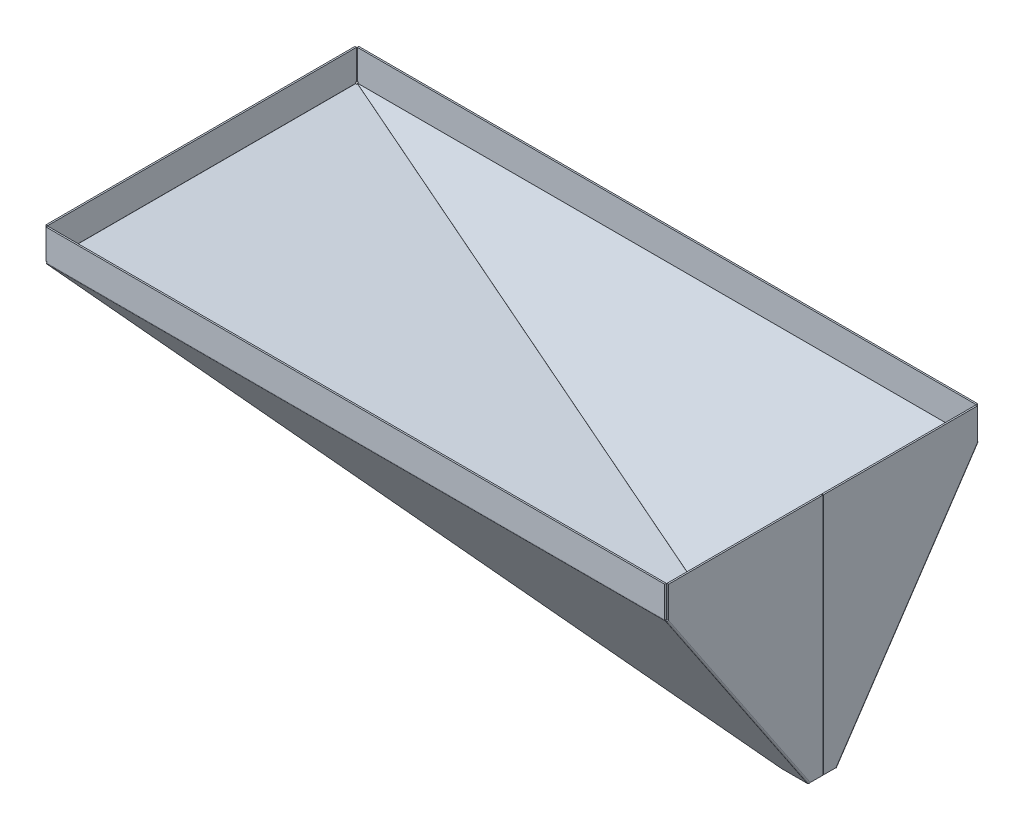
ISO-10303-21;
HEADER;
FILE_DESCRIPTION(('STEP AP214'),'2;1');
FILE_NAME('part.step','',(''),(''),'','','');
FILE_SCHEMA(('AUTOMOTIVE_DESIGN { 1 0 10303 214 1 1 1 1 }'));
ENDSEC;
DATA;
#1=APPLICATION_CONTEXT('core data for automotive mechanical design processes');
#2=APPLICATION_PROTOCOL_DEFINITION('international standard','automotive_design',2000,#1);
#3=PRODUCT_CONTEXT('',#1,'mechanical');
#4=PRODUCT('Part','Part','',(#3));
#5=PRODUCT_RELATED_PRODUCT_CATEGORY('part','',(#4));
#6=PRODUCT_DEFINITION_FORMATION('','',#4);
#7=PRODUCT_DEFINITION_CONTEXT('part definition',#1,'design');
#8=PRODUCT_DEFINITION('design','',#6,#7);
#9=PRODUCT_DEFINITION_SHAPE('','',#8);
#10=(LENGTH_UNIT() NAMED_UNIT(*) SI_UNIT(.MILLI.,.METRE.));
#11=(NAMED_UNIT(*) PLANE_ANGLE_UNIT() SI_UNIT($,.RADIAN.));
#12=(NAMED_UNIT(*) SI_UNIT($,.STERADIAN.) SOLID_ANGLE_UNIT());
#13=UNCERTAINTY_MEASURE_WITH_UNIT(LENGTH_MEASURE(1.E-05),#10,'distance_accuracy_value','');
#14=(GEOMETRIC_REPRESENTATION_CONTEXT(3) GLOBAL_UNCERTAINTY_ASSIGNED_CONTEXT((#13)) GLOBAL_UNIT_ASSIGNED_CONTEXT((#10,
#11,#12)) REPRESENTATION_CONTEXT('',''));
#15=CARTESIAN_POINT('',(0.,0.,0.));
#16=DIRECTION('',(0.,0.,1.));
#17=DIRECTION('',(1.,0.,0.));
#18=AXIS2_PLACEMENT_3D('',#15,#16,#17);
#19=CARTESIAN_POINT('',(-0.707106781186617,-60.0000000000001,300.));
#20=DIRECTION('',(0.873607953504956,0.404141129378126,0.271070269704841));
#21=DIRECTION('',(0.486630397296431,-0.725521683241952,-0.486630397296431));
#22=AXIS2_PLACEMENT_3D('',#19,#20,#21);
#23=PLANE('',#22);
#24=DIRECTION('',(0.,-0.557035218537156,0.830488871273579));
#25=VECTOR('',#24,1.);
#26=CARTESIAN_POINT('',(-0.200000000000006,-60.7560501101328,299.492893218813));
#27=LINE('',#26,#25);
#28=CARTESIAN_POINT('',(-0.200000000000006,-60.7560501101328,299.492893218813));
#29=VERTEX_POINT('',#28);
#30=CARTESIAN_POINT('',(-0.200000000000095,-62.4271557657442,301.984359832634));
#31=VERTEX_POINT('',#30);
#32=EDGE_CURVE('E12',#29,#31,#27,.T.);
#33=ORIENTED_EDGE('',*,*,#32,.F.);
#34=DIRECTION('',(0.486630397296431,-0.725521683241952,-0.486630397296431));
#35=VECTOR('',#34,1.);
#36=CARTESIAN_POINT('',(-0.707106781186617,-60.0000000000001,300.));
#37=LINE('',#36,#35);
#38=CARTESIAN_POINT('',(-0.673204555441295,-60.0505451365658,299.966097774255));
#39=VERTEX_POINT('',#38);
#40=EDGE_CURVE('E785',#29,#39,#37,.F.);
#41=ORIENTED_EDGE('',*,*,#40,.T.);
#42=DIRECTION('',(0.,-0.557035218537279,0.830488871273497));
#43=VECTOR('',#42,1.);
#44=CARTESIAN_POINT('',(-0.673204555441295,-60.0505451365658,299.966097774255));
#45=LINE('',#44,#43);
#46=CARTESIAN_POINT('',(-0.673204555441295,-61.7216507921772,302.457564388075));
#47=VERTEX_POINT('',#46);
#48=EDGE_CURVE('E63',#39,#47,#45,.T.);
#49=ORIENTED_EDGE('',*,*,#48,.T.);
#50=DIRECTION('',(0.486630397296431,-0.725521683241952,-0.486630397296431));
#51=VECTOR('',#50,1.);
#52=CARTESIAN_POINT('',(-0.707106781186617,-61.6711056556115,302.491466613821));
#53=LINE('',#52,#51);
#54=EDGE_CURVE('E782',#31,#47,#53,.F.);
#55=ORIENTED_EDGE('',*,*,#54,.F.);
#56=EDGE_LOOP('',(#33,#41,#49,#55));
#57=FACE_BOUND('',#56,.T.);
#58=ADVANCED_FACE('F51',(#57),#23,.T.);
#59=CARTESIAN_POINT('',(-0.707106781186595,-59.9391380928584,300.));
#60=CARTESIAN_POINT('',(-0.707106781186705,-59.9391380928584,301.));
#61=CARTESIAN_POINT('',(-0.707106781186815,-59.9391380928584,302.));
#62=CARTESIAN_POINT('',(-0.707106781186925,-59.9391380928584,303.));
#63=CARTESIAN_POINT('',(-0.707106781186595,-59.5391380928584,300.));
#64=CARTESIAN_POINT('',(-0.707106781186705,-57.5391380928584,301.));
#65=CARTESIAN_POINT('',(-0.707106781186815,-55.5391380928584,302.));
#66=CARTESIAN_POINT('',(-0.707106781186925,-53.5391380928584,303.));
#67=CARTESIAN_POINT('',(-0.307106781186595,-59.5391380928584,299.6));
#68=CARTESIAN_POINT('',(-0.307106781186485,-57.5391380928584,298.6));
#69=CARTESIAN_POINT('',(-0.307106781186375,-55.5391380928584,297.6));
#70=CARTESIAN_POINT('',(-0.307106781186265,-53.5391380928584,296.6));
#71=CARTESIAN_POINT('',(-0.307106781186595,-59.9391380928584,299.6));
#72=CARTESIAN_POINT('',(-0.307106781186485,-59.9391380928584,298.6));
#73=CARTESIAN_POINT('',(-0.307106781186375,-59.9391380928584,297.6));
#74=CARTESIAN_POINT('',(-0.307106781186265,-59.9391380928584,296.6));
#75=CARTESIAN_POINT('',(-0.307106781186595,-60.3391380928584,299.6));
#76=CARTESIAN_POINT('',(-0.307106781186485,-62.3391380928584,298.6));
#77=CARTESIAN_POINT('',(-0.307106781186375,-64.3391380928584,297.6));
#78=CARTESIAN_POINT('',(-0.307106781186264,-66.3391380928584,296.6));
#79=CARTESIAN_POINT('',(-0.707106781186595,-60.3391380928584,300.));
#80=CARTESIAN_POINT('',(-0.707106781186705,-62.3391380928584,301.));
#81=CARTESIAN_POINT('',(-0.707106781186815,-64.3391380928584,302.));
#82=CARTESIAN_POINT('',(-0.707106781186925,-66.3391380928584,303.));
#83=CARTESIAN_POINT('',(-0.707106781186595,-59.9391380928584,300.));
#84=CARTESIAN_POINT('',(-0.707106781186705,-59.9391380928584,301.));
#85=CARTESIAN_POINT('',(-0.707106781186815,-59.9391380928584,302.));
#86=CARTESIAN_POINT('',(-0.707106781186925,-59.9391380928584,303.));
#87=(BOUNDED_SURFACE() B_SPLINE_SURFACE(3,3,((#59,#60,#61,#62),(#63,#64,#65,#66),(#67,#68,#69,
#70),(#71,#72,#73,#74),(#75,#76,#77,#78),(#79,#80,#81,#82),(#83,#84,#85,#86)),.UNSPECIFIED.,.T.,
.F.,.F.) B_SPLINE_SURFACE_WITH_KNOTS((4,3,4),(4,4),(0.,0.5,1.),(0.,1.),
.UNSPECIFIED.) GEOMETRIC_REPRESENTATION_ITEM() RATIONAL_B_SPLINE_SURFACE(((1.,1.,1.,1.),
(0.333333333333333,0.333333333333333,0.333333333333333,0.333333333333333),(0.333333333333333,
0.333333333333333,0.333333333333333,0.333333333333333),(1.,1.,1.,1.),(0.333333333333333,
0.333333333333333,0.333333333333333,0.333333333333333),(0.333333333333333,0.333333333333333,
0.333333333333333,0.333333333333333),(1.,1.,1.,1.))) REPRESENTATION_ITEM('') SURFACE());
#88=CARTESIAN_POINT('',(-0.507106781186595,-59.9391380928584,299.8));
#89=DIRECTION('',(-0.707106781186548,0.,-0.707106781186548));
#90=DIRECTION('',(-0.707106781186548,0.,0.707106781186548));
#91=AXIS2_PLACEMENT_3D('',#88,#89,#90);
#92=ELLIPSE('',#91,0.282842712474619,0.2);
#93=CARTESIAN_POINT('',(-0.707106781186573,-59.9391380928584,300.));
#94=VERTEX_POINT('',#93);
#95=EDGE_CURVE('E1250',#39,#94,#92,.T.);
#96=DIRECTION('',(0.,0.,1.));
#97=VECTOR('',#96,1.);
#98=CARTESIAN_POINT('',(-0.707106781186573,-59.9391380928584,300.));
#99=LINE('',#98,#97);
#100=CARTESIAN_POINT('',(-0.707106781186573,-59.9391380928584,303.));
#101=VERTEX_POINT('',#100);
#102=EDGE_CURVE('E776',#94,#101,#99,.T.);
#103=CARTESIAN_POINT('',(-0.507106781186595,-59.9391380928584,299.8));
#104=DIRECTION('',(-0.998052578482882,0.,-0.0623782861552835));
#105=DIRECTION('',(-0.0623782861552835,0.,0.998052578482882));
#106=AXIS2_PLACEMENT_3D('',#103,#104,#105);
#107=ELLIPSE('',#106,3.20624390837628,3.2);
#108=EDGE_CURVE('E804',#47,#101,#107,.T.);
#109=ORIENTED_EDGE('',*,*,#48,.F.);
#110=ORIENTED_EDGE('',*,*,#95,.T.);
#111=ORIENTED_EDGE('',*,*,#102,.T.);
#112=ORIENTED_EDGE('',*,*,#108,.F.);
#113=EDGE_LOOP('',(#109,#110,#111,#112));
#114=FACE_BOUND('',#113,.T.);
#115=ADVANCED_FACE('F805',(#114),#87,.T.);
#116=CARTESIAN_POINT('',(-0.707106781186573,-60.,300.));
#117=DIRECTION('',(1.,0.,0.));
#118=DIRECTION('',(0.,1.,0.));
#119=AXIS2_PLACEMENT_3D('',#116,#117,#118);
#120=PLANE('',#119);
#121=ORIENTED_EDGE('',*,*,#102,.F.);
#122=DIRECTION('',(0.,1.,0.));
#123=VECTOR('',#122,1.);
#124=CARTESIAN_POINT('',(-0.707106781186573,-60.,300.));
#125=LINE('',#124,#123);
#126=CARTESIAN_POINT('',(-0.707106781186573,0.,300.));
#127=VERTEX_POINT('',#126);
#128=EDGE_CURVE('E1179',#94,#127,#125,.T.);
#129=ORIENTED_EDGE('',*,*,#128,.T.);
#130=DIRECTION('',(0.,0.,1.));
#131=VECTOR('',#130,1.);
#132=CARTESIAN_POINT('',(-0.707106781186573,0.,300.));
#133=LINE('',#132,#131);
#134=CARTESIAN_POINT('',(-0.707106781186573,0.,303.));
#135=VERTEX_POINT('',#134);
#136=EDGE_CURVE('E774',#127,#135,#133,.T.);
#137=ORIENTED_EDGE('',*,*,#136,.T.);
#138=DIRECTION('',(0.,1.,0.));
#139=VECTOR('',#138,1.);
#140=CARTESIAN_POINT('',(-0.707106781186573,-60.,303.));
#141=LINE('',#140,#139);
#142=EDGE_CURVE('E835',#101,#135,#141,.T.);
#143=ORIENTED_EDGE('',*,*,#142,.F.);
#144=EDGE_LOOP('',(#121,#129,#137,#143));
#145=FACE_BOUND('',#144,.T.);
#146=ADVANCED_FACE('F1498',(#145),#120,.T.);
#147=CARTESIAN_POINT('',(-1200.,0.,300.));
#148=DIRECTION('',(0.,-1.,0.));
#149=DIRECTION('',(1.,0.,0.));
#150=AXIS2_PLACEMENT_3D('',#147,#148,#149);
#151=PLANE('',#150);
#152=ORIENTED_EDGE('',*,*,#136,.F.);
#153=DIRECTION('',(1.,0.,0.));
#154=VECTOR('',#153,1.);
#155=CARTESIAN_POINT('',(-1200.,0.,300.));
#156=LINE('',#155,#154);
#157=CARTESIAN_POINT('',(-1199.29289321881,0.,300.));
#158=VERTEX_POINT('',#157);
#159=EDGE_CURVE('E1128',#158,#127,#156,.T.);
#160=ORIENTED_EDGE('',*,*,#159,.F.);
#161=DIRECTION('',(0.,0.,1.));
#162=VECTOR('',#161,1.);
#163=CARTESIAN_POINT('',(-1199.29289321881,0.,300.));
#164=LINE('',#163,#162);
#165=CARTESIAN_POINT('',(-1199.29289321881,0.,303.));
#166=VERTEX_POINT('',#165);
#167=EDGE_CURVE('E772',#158,#166,#164,.T.);
#168=ORIENTED_EDGE('',*,*,#167,.T.);
#169=DIRECTION('',(1.,0.,0.));
#170=VECTOR('',#169,1.);
#171=CARTESIAN_POINT('',(-1200.,0.,303.));
#172=LINE('',#171,#170);
#173=EDGE_CURVE('E876',#166,#135,#172,.T.);
#174=ORIENTED_EDGE('',*,*,#173,.T.);
#175=EDGE_LOOP('',(#152,#160,#168,#174));
#176=FACE_BOUND('',#175,.T.);
#177=ADVANCED_FACE('F1510',(#176),#151,.F.);
#178=CARTESIAN_POINT('',(-1199.29289321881,-60.,300.));
#179=DIRECTION('',(-1.,0.,0.));
#180=DIRECTION('',(0.,-1.,0.));
#181=AXIS2_PLACEMENT_3D('',#178,#179,#180);
#182=PLANE('',#181);
#183=ORIENTED_EDGE('',*,*,#167,.F.);
#184=DIRECTION('',(0.,-1.,0.));
#185=VECTOR('',#184,1.);
#186=CARTESIAN_POINT('',(-1199.29289321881,-60.,300.));
#187=LINE('',#186,#185);
#188=CARTESIAN_POINT('',(-1199.29289321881,-58.0831961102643,300.));
#189=VERTEX_POINT('',#188);
#190=EDGE_CURVE('E1170',#158,#189,#187,.T.);
#191=ORIENTED_EDGE('',*,*,#190,.T.);
#192=DIRECTION('',(0.,0.,1.));
#193=VECTOR('',#192,1.);
#194=CARTESIAN_POINT('',(-1199.29289321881,-58.0831961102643,300.));
#195=LINE('',#194,#193);
#196=CARTESIAN_POINT('',(-1199.29289321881,-58.0831961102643,303.));
#197=VERTEX_POINT('',#196);
#198=EDGE_CURVE('E770',#189,#197,#195,.T.);
#199=ORIENTED_EDGE('',*,*,#198,.T.);
#200=DIRECTION('',(0.,1.,0.));
#201=VECTOR('',#200,1.);
#202=CARTESIAN_POINT('',(-1199.29289321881,-60.,303.));
#203=LINE('',#202,#201);
#204=EDGE_CURVE('E930',#166,#197,#203,.F.);
#205=ORIENTED_EDGE('',*,*,#204,.F.);
#206=EDGE_LOOP('',(#183,#191,#199,#205));
#207=FACE_BOUND('',#206,.T.);
#208=ADVANCED_FACE('F1514',(#207),#182,.T.);
#209=CARTESIAN_POINT('',(-1200.60361689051,-58.684723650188,300.));
#210=DIRECTION('',(-0.417101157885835,0.908860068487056,0.));
#211=DIRECTION('',(-0.908860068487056,-0.417101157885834,0.));
#212=AXIS2_PLACEMENT_3D('',#209,#210,#211);
#213=PLANE('',#212);
#214=ORIENTED_EDGE('',*,*,#198,.F.);
#215=DIRECTION('',(-0.908860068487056,-0.417101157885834,0.));
#216=VECTOR('',#215,1.);
#217=CARTESIAN_POINT('',(-1200.60361689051,-58.684723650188,300.));
#218=LINE('',#217,#216);
#219=CARTESIAN_POINT('',(-1196.8,-56.9391380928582,300.));
#220=VERTEX_POINT('',#219);
#221=EDGE_CURVE('E1211',#220,#189,#218,.T.);
#222=ORIENTED_EDGE('',*,*,#221,.F.);
#223=DIRECTION('',(0.,0.,1.));
#224=VECTOR('',#223,1.);
#225=CARTESIAN_POINT('',(-1196.8,-56.9391380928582,300.));
#226=LINE('',#225,#224);
#227=CARTESIAN_POINT('',(-1196.8,-56.9391380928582,303.));
#228=VERTEX_POINT('',#227);
#229=EDGE_CURVE('E768',#220,#228,#226,.T.);
#230=ORIENTED_EDGE('',*,*,#229,.T.);
#231=DIRECTION('',(-0.908860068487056,-0.417101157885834,0.));
#232=VECTOR('',#231,1.);
#233=CARTESIAN_POINT('',(-1200.60361689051,-58.684723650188,303.));
#234=LINE('',#233,#232);
#235=EDGE_CURVE('E950',#228,#197,#234,.T.);
#236=ORIENTED_EDGE('',*,*,#235,.T.);
#237=EDGE_LOOP('',(#214,#222,#230,#236));
#238=FACE_BOUND('',#237,.T.);
#239=ADVANCED_FACE('F1518',(#238),#213,.F.);
#240=CARTESIAN_POINT('',(-1199.05558957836,-60.5843790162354,300.));
#241=DIRECTION('',(0.850368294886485,-0.526187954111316,0.));
#242=DIRECTION('',(0.526187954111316,0.850368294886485,0.));
#243=AXIS2_PLACEMENT_3D('',#240,#241,#242);
#244=PLANE('',#243);
#245=ORIENTED_EDGE('',*,*,#229,.F.);
#246=DIRECTION('',(0.526187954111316,0.850368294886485,0.));
#247=VECTOR('',#246,1.);
#248=CARTESIAN_POINT('',(-1199.05558957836,-60.5843790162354,300.));
#249=LINE('',#248,#247);
#250=CARTESIAN_POINT('',(-1198.65632963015,-59.9391380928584,300.));
#251=VERTEX_POINT('',#250);
#252=EDGE_CURVE('E1214',#251,#220,#249,.T.);
#253=ORIENTED_EDGE('',*,*,#252,.F.);
#254=DIRECTION('',(0.,-1.04447708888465E-13,1.));
#255=VECTOR('',#254,1.);
#256=CARTESIAN_POINT('',(-1198.65632963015,-59.9391380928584,300.));
#257=LINE('',#256,#255);
#258=CARTESIAN_POINT('',(-1198.65632963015,-59.9391380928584,303.));
#259=VERTEX_POINT('',#258);
#260=EDGE_CURVE('E766',#251,#259,#257,.T.);
#261=ORIENTED_EDGE('',*,*,#260,.T.);
#262=DIRECTION('',(0.526187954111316,0.850368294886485,0.));
#263=VECTOR('',#262,1.);
#264=CARTESIAN_POINT('',(-1199.05558957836,-60.5843790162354,303.));
#265=LINE('',#264,#263);
#266=EDGE_CURVE('E919',#259,#228,#265,.T.);
#267=ORIENTED_EDGE('',*,*,#266,.T.);
#268=EDGE_LOOP('',(#245,#253,#261,#267));
#269=FACE_BOUND('',#268,.T.);
#270=ADVANCED_FACE('F1522',(#269),#244,.F.);
#271=CARTESIAN_POINT('',(-1198.74326942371,-60.1272871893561,299.867822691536));
#272=CARTESIAN_POINT('',(-1198.74326942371,-61.0680326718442,300.206936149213));
#273=CARTESIAN_POINT('',(-1198.74326942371,-62.0087781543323,300.546049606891));
#274=CARTESIAN_POINT('',(-1198.74326942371,-62.9495236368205,300.885163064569));
#275=CARTESIAN_POINT('',(-1198.74326942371,-60.2629325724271,299.49152449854));
#276=CARTESIAN_POINT('',(-1198.74326942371,-61.8819049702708,297.949146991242));
#277=CARTESIAN_POINT('',(-1198.74326942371,-63.5008773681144,296.406769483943));
#278=CARTESIAN_POINT('',(-1198.74326942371,-65.119849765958,294.864391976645));
#279=CARTESIAN_POINT('',(-1198.48016891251,-59.8866343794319,299.355879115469));
#280=CARTESIAN_POINT('',(-1198.48016891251,-59.6241158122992,297.135274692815));
#281=CARTESIAN_POINT('',(-1198.48016891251,-59.3615972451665,294.914670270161));
#282=CARTESIAN_POINT('',(-1198.48016891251,-59.0990786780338,292.694065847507));
#283=CARTESIAN_POINT('',(-1198.48016891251,-59.7509889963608,299.732177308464));
#284=CARTESIAN_POINT('',(-1198.48016891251,-58.8102435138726,299.393063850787));
#285=CARTESIAN_POINT('',(-1198.48016891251,-57.8694980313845,299.053950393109));
#286=CARTESIAN_POINT('',(-1198.48016891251,-56.9287525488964,298.714836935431));
#287=CARTESIAN_POINT('',(-1198.48016891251,-59.6153436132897,300.10847550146));
#288=CARTESIAN_POINT('',(-1198.48016891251,-57.9963712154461,301.650853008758));
#289=CARTESIAN_POINT('',(-1198.48016891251,-56.3773988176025,303.193230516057));
#290=CARTESIAN_POINT('',(-1198.48016891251,-54.7584264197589,304.735608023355));
#291=CARTESIAN_POINT('',(-1198.74326942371,-59.991641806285,300.244120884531));
#292=CARTESIAN_POINT('',(-1198.74326942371,-60.2541603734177,302.464725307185));
#293=CARTESIAN_POINT('',(-1198.74326942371,-60.5166789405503,304.685329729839));
#294=CARTESIAN_POINT('',(-1198.74326942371,-60.779197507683,306.905934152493));
#295=CARTESIAN_POINT('',(-1198.74326942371,-60.1272871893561,299.867822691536));
#296=CARTESIAN_POINT('',(-1198.74326942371,-61.0680326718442,300.206936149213));
#297=CARTESIAN_POINT('',(-1198.74326942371,-62.0087781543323,300.546049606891));
#298=CARTESIAN_POINT('',(-1198.74326942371,-62.9495236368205,300.885163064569));
#299=(BOUNDED_SURFACE() B_SPLINE_SURFACE(3,3,((#271,#272,#273,#274),(#275,#276,#277,#278),(#279,
#280,#281,#282),(#283,#284,#285,#286),(#287,#288,#289,#290),(#291,#292,#293,#294),(#295,#296,
#297,#298)),.UNSPECIFIED.,.T.,.F.,.F.) B_SPLINE_SURFACE_WITH_KNOTS((4,3,4),(4,4),(0.,0.5,1.),
(0.,1.),.UNSPECIFIED.) GEOMETRIC_REPRESENTATION_ITEM() RATIONAL_B_SPLINE_SURFACE(((1.,1.,1.,1.),
(0.333333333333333,0.333333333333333,0.333333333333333,0.333333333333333),(0.333333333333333,
0.333333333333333,0.333333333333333,0.333333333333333),(1.,1.,1.,1.),(0.333333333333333,
0.333333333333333,0.333333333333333,0.333333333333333),(0.333333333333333,0.333333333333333,
0.333333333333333,0.333333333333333),(1.,1.,1.,1.))) REPRESENTATION_ITEM('') SURFACE());
#300=CARTESIAN_POINT('',(-1198.61171916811,-59.9391380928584,299.8));
#301=DIRECTION('',(0.835472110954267,-0.516970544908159,0.186353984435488));
#302=DIRECTION('',(-0.549532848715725,-0.785966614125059,0.283319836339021));
#303=AXIS2_PLACEMENT_3D('',#300,#301,#302);
#304=ELLIPSE('',#303,0.239385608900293,0.2);
#305=CARTESIAN_POINT('',(-1198.71770372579,-60.0505451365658,299.966097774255));
#306=VERTEX_POINT('',#305);
#307=EDGE_CURVE('E1252',#251,#306,#304,.T.);
#308=DIRECTION('',(0.,-0.557035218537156,0.830488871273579));
#309=VECTOR('',#308,1.);
#310=CARTESIAN_POINT('',(-1198.71770372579,-60.0505451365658,299.966097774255));
#311=LINE('',#310,#309);
#312=CARTESIAN_POINT('',(-1198.71770372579,-61.7216507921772,302.457564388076));
#313=VERTEX_POINT('',#312);
#314=EDGE_CURVE('E764',#306,#313,#311,.T.);
#315=CARTESIAN_POINT('',(-1198.61171916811,-59.9391380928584,299.8));
#316=DIRECTION('',(0.999156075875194,-0.0386408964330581,0.0139290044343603));
#317=DIRECTION('',(-0.041074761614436,-0.939951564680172,0.33882727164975));
#318=AXIS2_PLACEMENT_3D('',#315,#316,#317);
#319=ELLIPSE('',#318,3.20270283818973,3.2);
#320=EDGE_CURVE('E809',#259,#313,#319,.T.);
#321=ORIENTED_EDGE('',*,*,#260,.F.);
#322=ORIENTED_EDGE('',*,*,#307,.T.);
#323=ORIENTED_EDGE('',*,*,#314,.T.);
#324=ORIENTED_EDGE('',*,*,#320,.F.);
#325=EDGE_LOOP('',(#321,#322,#323,#324));
#326=FACE_BOUND('',#325,.T.);
#327=ADVANCED_FACE('F1526',(#326),#299,.T.);
#328=CARTESIAN_POINT('',(-1080.37095090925,192.19743540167,469.15681642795));
#329=DIRECTION('',(0.931768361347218,-0.301511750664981,-0.202233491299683));
#330=DIRECTION('',(-0.363053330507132,-0.773823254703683,-0.519027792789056));
#331=AXIS2_PLACEMENT_3D('',#328,#329,#330);
#332=PLANE('',#331);
#333=ORIENTED_EDGE('',*,*,#314,.F.);
#334=DIRECTION('',(-0.363053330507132,-0.773823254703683,-0.519027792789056));
#335=VECTOR('',#334,1.);
#336=CARTESIAN_POINT('',(-1080.37095090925,192.19743540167,469.15681642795));
#337=LINE('',#336,#335);
#338=CARTESIAN_POINT('',(-1198.77251482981,-60.1673712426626,299.887738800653));
#339=VERTEX_POINT('',#338);
#340=EDGE_CURVE('E1208',#306,#339,#337,.T.);
#341=ORIENTED_EDGE('',*,*,#340,.T.);
#342=DIRECTION('',(0.,-0.557035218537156,0.830488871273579));
#343=VECTOR('',#342,1.);
#344=CARTESIAN_POINT('',(-1198.77251482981,-60.1673712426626,299.887738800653));
#345=LINE('',#344,#343);
#346=CARTESIAN_POINT('',(-1198.77251482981,-61.8384768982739,302.379205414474));
#347=VERTEX_POINT('',#346);
#348=EDGE_CURVE('E762',#339,#347,#345,.T.);
#349=ORIENTED_EDGE('',*,*,#348,.T.);
#350=DIRECTION('',(-0.363053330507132,-0.773823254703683,-0.519027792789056));
#351=VECTOR('',#350,1.);
#352=CARTESIAN_POINT('',(-1080.37095090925,190.526329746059,471.64828304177));
#353=LINE('',#352,#351);
#354=EDGE_CURVE('E948',#313,#347,#353,.T.);
#355=ORIENTED_EDGE('',*,*,#354,.F.);
#356=EDGE_LOOP('',(#333,#341,#349,#355));
#357=FACE_BOUND('',#356,.T.);
#358=ADVANCED_FACE('F1532',(#357),#332,.F.);
#359=CARTESIAN_POINT('',(-1201.38563293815,-122.866949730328,257.83314347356));
#360=DIRECTION('',(0.999401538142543,-0.0287277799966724,-0.0192686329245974));
#361=DIRECTION('',(-0.0345914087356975,-0.829991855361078,-0.556701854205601));
#362=AXIS2_PLACEMENT_3D('',#359,#360,#361);
#363=PLANE('',#362);
#364=ORIENTED_EDGE('',*,*,#348,.F.);
#365=DIRECTION('',(-0.0345914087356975,-0.829991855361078,-0.556701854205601));
#366=VECTOR('',#365,1.);
#367=CARTESIAN_POINT('',(-1201.38563293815,-122.866949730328,257.83314347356));
#368=LINE('',#367,#366);
#369=CARTESIAN_POINT('',(-1198.77946865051,-60.3342223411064,299.775826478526));
#370=VERTEX_POINT('',#369);
#371=EDGE_CURVE('E1207',#339,#370,#368,.T.);
#372=ORIENTED_EDGE('',*,*,#371,.T.);
#373=DIRECTION('',(2.22044604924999E-12,-0.557035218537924,0.830488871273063));
#374=VECTOR('',#373,1.);
#375=CARTESIAN_POINT('',(-1198.77946865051,-60.3342223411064,299.775826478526));
#376=LINE('',#375,#374);
#377=CARTESIAN_POINT('',(-1198.77946865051,-62.0053279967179,302.267293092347));
#378=VERTEX_POINT('',#377);
#379=EDGE_CURVE('E760',#370,#378,#376,.T.);
#380=ORIENTED_EDGE('',*,*,#379,.T.);
#381=DIRECTION('',(-0.0345914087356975,-0.829991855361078,-0.556701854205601));
#382=VECTOR('',#381,1.);
#383=CARTESIAN_POINT('',(-1201.38563293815,-124.53805538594,260.324610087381));
#384=LINE('',#383,#382);
#385=EDGE_CURVE('E944',#347,#378,#384,.T.);
#386=ORIENTED_EDGE('',*,*,#385,.F.);
#387=EDGE_LOOP('',(#364,#372,#380,#386));
#388=FACE_BOUND('',#387,.T.);
#389=ADVANCED_FACE('F1541',(#388),#363,.F.);
#390=CARTESIAN_POINT('',(-1198.75779056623,-60.2264633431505,299.809826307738));
#391=CARTESIAN_POINT('',(-1198.54439752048,-60.28213929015,300.785205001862));
#392=CARTESIAN_POINT('',(-1198.33100447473,-60.3378152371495,301.760583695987));
#393=CARTESIAN_POINT('',(-1198.11761142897,-60.3934911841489,302.735962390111));
#394=CARTESIAN_POINT('',(-1198.89050163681,-60.6037318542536,299.817325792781));
#395=CARTESIAN_POINT('',(-1199.34066394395,-62.5457503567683,300.830201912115));
#396=CARTESIAN_POINT('',(-1199.79082625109,-64.4877688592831,301.843078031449));
#397=CARTESIAN_POINT('',(-1200.24098855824,-66.4297873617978,302.855954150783));
#398=CARTESIAN_POINT('',(-1198.71161054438,-60.6756717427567,299.363984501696));
#399=CARTESIAN_POINT('',(-1199.58855894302,-62.5063383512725,298.426103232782));
#400=CARTESIAN_POINT('',(-1200.46550734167,-64.3370049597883,297.488221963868));
#401=CARTESIAN_POINT('',(-1201.34245574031,-66.1676715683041,296.550340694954));
#402=CARTESIAN_POINT('',(-1198.5788994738,-60.2984032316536,299.356485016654));
#403=CARTESIAN_POINT('',(-1198.79229251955,-60.2427272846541,298.38110632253));
#404=CARTESIAN_POINT('',(-1199.0056855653,-60.1870513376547,297.405727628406));
#405=CARTESIAN_POINT('',(-1199.21907861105,-60.1313753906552,296.430348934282));
#406=CARTESIAN_POINT('',(-1198.44618840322,-59.9211347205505,299.348985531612));
#407=CARTESIAN_POINT('',(-1197.99602609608,-57.9791162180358,298.336109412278));
#408=CARTESIAN_POINT('',(-1197.54586378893,-56.037097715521,297.323233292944));
#409=CARTESIAN_POINT('',(-1197.09570148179,-54.0950792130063,296.31035717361));
#410=CARTESIAN_POINT('',(-1198.62507949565,-59.8491948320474,299.802326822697));
#411=CARTESIAN_POINT('',(-1197.748131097,-58.0185282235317,300.740208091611));
#412=CARTESIAN_POINT('',(-1196.87118269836,-56.1878616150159,301.678089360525));
#413=CARTESIAN_POINT('',(-1195.99423429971,-54.3571950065,302.615970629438));
#414=CARTESIAN_POINT('',(-1198.75779056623,-60.2264633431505,299.809826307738));
#415=CARTESIAN_POINT('',(-1198.54439752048,-60.28213929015,300.785205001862));
#416=CARTESIAN_POINT('',(-1198.33100447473,-60.3378152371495,301.760583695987));
#417=CARTESIAN_POINT('',(-1198.11761142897,-60.3934911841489,302.735962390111));
#418=(BOUNDED_SURFACE() B_SPLINE_SURFACE(3,3,((#390,#391,#392,#393),(#394,#395,#396,#397),(#398,
#399,#400,#401),(#402,#403,#404,#405),(#406,#407,#408,#409),(#410,#411,#412,#413),(#414,#415,
#416,#417)),.UNSPECIFIED.,.T.,.F.,.F.) B_SPLINE_SURFACE_WITH_KNOTS((4,3,4),(4,4),(0.,0.5,1.),
(0.,1.),.UNSPECIFIED.) GEOMETRIC_REPRESENTATION_ITEM() RATIONAL_B_SPLINE_SURFACE(((1.,1.,1.,1.),
(0.333333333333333,0.333333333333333,0.333333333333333,0.333333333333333),(0.333333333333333,
0.333333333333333,0.333333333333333,0.333333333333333),(1.,1.,1.,1.),(0.333333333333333,
0.333333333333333,0.333333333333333,0.333333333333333),(0.333333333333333,0.333333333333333,
0.333333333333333,0.333333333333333),(1.,1.,1.,1.))) REPRESENTATION_ITEM('') SURFACE());
#419=CARTESIAN_POINT('',(-1198.66834502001,-60.2624332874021,299.583155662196));
#420=DIRECTION('',(0.870668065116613,-0.298502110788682,0.390939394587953));
#421=DIRECTION('',(-0.36312627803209,0.146028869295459,0.920225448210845));
#422=AXIS2_PLACEMENT_3D('',#419,#420,#421);
#423=ELLIPSE('',#422,0.246320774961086,0.2);
#424=CARTESIAN_POINT('',(-1198.7329692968,-60.4517239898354,299.582548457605));
#425=VERTEX_POINT('',#424);
#426=EDGE_CURVE('E560',#370,#425,#423,.T.);
#427=DIRECTION('',(-0.335817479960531,-0.941927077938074,0.));
#428=VECTOR('',#427,1.);
#429=CARTESIAN_POINT('',(-1198.7329692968,-60.4517239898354,299.582548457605));
#430=LINE('',#429,#428);
#431=CARTESIAN_POINT('',(-1199.74042173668,-63.2775052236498,299.582548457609));
#432=VERTEX_POINT('',#431);
#433=EDGE_CURVE('E758',#425,#432,#430,.T.);
#434=CARTESIAN_POINT('',(-1198.66834502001,-60.2624332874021,299.583155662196));
#435=DIRECTION('',(0.927557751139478,-0.329778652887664,-0.175734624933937));
#436=DIRECTION('',(0.171930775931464,-0.0409143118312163,0.984259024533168));
#437=AXIS2_PLACEMENT_3D('',#434,#435,#436);
#438=ELLIPSE('',#437,3.20322867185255,3.2);
#439=EDGE_CURVE('E471',#378,#432,#438,.T.);
#440=ORIENTED_EDGE('',*,*,#379,.F.);
#441=ORIENTED_EDGE('',*,*,#426,.T.);
#442=ORIENTED_EDGE('',*,*,#433,.T.);
#443=ORIENTED_EDGE('',*,*,#439,.F.);
#444=EDGE_LOOP('',(#440,#441,#442,#443));
#445=FACE_BOUND('',#444,.T.);
#446=ADVANCED_FACE('F1545',(#445),#418,.T.);
#447=CARTESIAN_POINT('',(-937.546485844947,-153.570383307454,-353.211337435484));
#448=DIRECTION('',(0.86695530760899,-0.309088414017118,0.390963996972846));
#449=DIRECTION('',(-0.368259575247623,0.131292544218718,0.920405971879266));
#450=AXIS2_PLACEMENT_3D('',#447,#448,#449);
#451=PLANE('',#450);
#452=ORIENTED_EDGE('',*,*,#433,.F.);
#453=DIRECTION('',(-0.368259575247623,0.131292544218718,0.920405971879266));
#454=VECTOR('',#453,1.);
#455=CARTESIAN_POINT('',(-937.546485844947,-153.570383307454,-353.211337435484));
#456=LINE('',#455,#454);
#457=CARTESIAN_POINT('',(-1197.6854272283,-60.8251955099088,296.964384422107));
#458=VERTEX_POINT('',#457);
#459=EDGE_CURVE('E1204',#458,#425,#456,.T.);
#460=ORIENTED_EDGE('',*,*,#459,.F.);
#461=DIRECTION('',(-0.335817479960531,-0.941927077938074,0.));
#462=VECTOR('',#461,1.);
#463=CARTESIAN_POINT('',(-1197.6854272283,-60.8251955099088,296.964384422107));
#464=LINE('',#463,#462);
#465=CARTESIAN_POINT('',(-1198.69287966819,-63.650976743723,296.964384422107));
#466=VERTEX_POINT('',#465);
#467=EDGE_CURVE('E756',#458,#466,#464,.T.);
#468=ORIENTED_EDGE('',*,*,#467,.T.);
#469=DIRECTION('',(-0.368259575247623,0.131292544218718,0.920405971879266));
#470=VECTOR('',#469,1.);
#471=CARTESIAN_POINT('',(-938.553938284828,-156.396164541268,-353.211337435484));
#472=LINE('',#471,#470);
#473=EDGE_CURVE('E941',#466,#432,#472,.T.);
#474=ORIENTED_EDGE('',*,*,#473,.T.);
#475=EDGE_LOOP('',(#452,#460,#468,#474));
#476=FACE_BOUND('',#475,.T.);
#477=ADVANCED_FACE('F1551',(#476),#451,.F.);
#478=CARTESIAN_POINT('',(-297.164469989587,-381.88049330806,-260.229244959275));
#479=DIRECTION('',(-0.47429408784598,0.169096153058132,-0.863974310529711));
#480=DIRECTION('',(0.813800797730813,-0.290137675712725,-0.503535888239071));
#481=AXIS2_PLACEMENT_3D('',#478,#479,#480);
#482=PLANE('',#481);
#483=ORIENTED_EDGE('',*,*,#467,.F.);
#484=DIRECTION('',(0.813800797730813,-0.290137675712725,-0.503535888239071));
#485=VECTOR('',#484,1.);
#486=CARTESIAN_POINT('',(-297.164469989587,-381.88049330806,-260.229244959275));
#487=LINE('',#486,#485);
#488=CARTESIAN_POINT('',(-1199.86716349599,-60.0473591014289,298.314324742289));
#489=VERTEX_POINT('',#488);
#490=EDGE_CURVE('E1203',#489,#458,#487,.T.);
#491=ORIENTED_EDGE('',*,*,#490,.F.);
#492=DIRECTION('',(-0.335817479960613,-0.941927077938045,1.11022302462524E-12));
#493=VECTOR('',#492,1.);
#494=CARTESIAN_POINT('',(-1199.86716349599,-60.0473591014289,298.314324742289));
#495=LINE('',#494,#493);
#496=CARTESIAN_POINT('',(-1200.87461593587,-62.8731403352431,298.314324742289));
#497=VERTEX_POINT('',#496);
#498=EDGE_CURVE('E308',#489,#497,#495,.T.);
#499=ORIENTED_EDGE('',*,*,#498,.T.);
#500=DIRECTION('',(0.813800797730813,-0.290137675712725,-0.503535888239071));
#501=VECTOR('',#500,1.);
#502=CARTESIAN_POINT('',(-298.171922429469,-384.706274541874,-260.229244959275));
#503=LINE('',#502,#501);
#504=EDGE_CURVE('E936',#497,#466,#503,.T.);
#505=ORIENTED_EDGE('',*,*,#504,.T.);
#506=EDGE_LOOP('',(#483,#491,#499,#505));
#507=FACE_BOUND('',#506,.T.);
#508=ADVANCED_FACE('F1560',(#507),#482,.F.);
#509=CARTESIAN_POINT('',(-1202.50091759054,-61.5750867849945,298.354399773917));
#510=CARTESIAN_POINT('',(-1201.6568808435,-61.0388014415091,298.354399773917));
#511=CARTESIAN_POINT('',(-1200.81284409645,-60.5025160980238,298.354399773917));
#512=CARTESIAN_POINT('',(-1199.96880734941,-59.9662307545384,298.354399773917));
#513=CARTESIAN_POINT('',(-1205.93314378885,-56.1732516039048,298.354399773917));
#514=CARTESIAN_POINT('',(-1204.01653635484,-57.32503975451,298.354399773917));
#515=CARTESIAN_POINT('',(-1202.09992892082,-58.4768279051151,298.354399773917));
#516=CARTESIAN_POINT('',(-1200.1833214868,-59.6286160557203,298.354399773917));
#517=CARTESIAN_POINT('',(-1200.53130860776,-52.7410254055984,297.975289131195));
#518=CARTESIAN_POINT('',(-1200.30277466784,-54.9653842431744,297.975289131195));
#519=CARTESIAN_POINT('',(-1200.07424072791,-57.1897430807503,297.975289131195));
#520=CARTESIAN_POINT('',(-1199.84570678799,-59.4141019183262,297.975289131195));
#521=CARTESIAN_POINT('',(-1197.09908240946,-58.1428605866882,297.975289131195));
#522=CARTESIAN_POINT('',(-1197.9431191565,-58.6791459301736,297.975289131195));
#523=CARTESIAN_POINT('',(-1198.78715590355,-59.2154312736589,297.975289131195));
#524=CARTESIAN_POINT('',(-1199.63119265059,-59.7517166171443,297.975289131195));
#525=CARTESIAN_POINT('',(-1193.66685621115,-63.544695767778,297.975289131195));
#526=CARTESIAN_POINT('',(-1195.58346364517,-62.3929076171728,297.975289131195));
#527=CARTESIAN_POINT('',(-1197.50007107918,-61.2411194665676,297.975289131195));
#528=CARTESIAN_POINT('',(-1199.4166785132,-60.0893313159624,297.975289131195));
#529=CARTESIAN_POINT('',(-1199.06869139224,-66.9769219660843,298.354399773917));
#530=CARTESIAN_POINT('',(-1199.29722533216,-64.7525631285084,298.354399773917));
#531=CARTESIAN_POINT('',(-1199.52575927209,-62.5282042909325,298.354399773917));
#532=CARTESIAN_POINT('',(-1199.75429321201,-60.3038454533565,298.354399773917));
#533=CARTESIAN_POINT('',(-1202.50091759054,-61.5750867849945,298.354399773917));
#534=CARTESIAN_POINT('',(-1201.6568808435,-61.0388014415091,298.354399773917));
#535=CARTESIAN_POINT('',(-1200.81284409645,-60.5025160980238,298.354399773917));
#536=CARTESIAN_POINT('',(-1199.96880734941,-59.9662307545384,298.354399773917));
#537=(BOUNDED_SURFACE() B_SPLINE_SURFACE(3,3,((#509,#510,#511,#512),(#513,#514,#515,#516),(#517,
#518,#519,#520),(#521,#522,#523,#524),(#525,#526,#527,#528),(#529,#530,#531,#532),(#533,#534,
#535,#536)),.UNSPECIFIED.,.T.,.F.,.F.) B_SPLINE_SURFACE_WITH_KNOTS((4,3,4),(4,4),(0.,0.5,1.),
(0.,1.),.UNSPECIFIED.) GEOMETRIC_REPRESENTATION_ITEM() RATIONAL_B_SPLINE_SURFACE(((1.,1.,1.,1.),
(0.333333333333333,0.333333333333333,0.333333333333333,0.333333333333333),(0.333333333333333,
0.333333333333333,0.333333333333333,0.333333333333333),(1.,1.,1.,1.),(0.333333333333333,
0.333333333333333,0.333333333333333,0.333333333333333),(0.333333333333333,0.333333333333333,
0.333333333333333,0.333333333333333),(1.,1.,1.,1.))) REPRESENTATION_ITEM('') SURFACE());
#538=CARTESIAN_POINT('',(-1199.8,-59.8589736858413,298.164844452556));
#539=DIRECTION('',(0.580613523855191,0.368911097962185,0.72580475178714));
#540=DIRECTION('',(-0.61260588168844,-0.389238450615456,0.687900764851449));
#541=AXIS2_PLACEMENT_3D('',#538,#539,#540);
#542=ELLIPSE('',#541,0.275556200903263,0.2);
#543=CARTESIAN_POINT('',(-1200.,-59.8589736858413,298.324836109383));
#544=VERTEX_POINT('',#543);
#545=EDGE_CURVE('E595',#489,#544,#542,.F.);
#546=DIRECTION('',(-1.,0.,0.));
#547=VECTOR('',#546,1.);
#548=CARTESIAN_POINT('',(-1200.,-59.8589736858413,298.324836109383));
#549=LINE('',#548,#547);
#550=CARTESIAN_POINT('',(-1203.,-59.8589736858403,298.324836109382));
#551=VERTEX_POINT('',#550);
#552=EDGE_CURVE('E753',#544,#551,#549,.T.);
#553=CARTESIAN_POINT('',(-1199.8,-59.8589736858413,298.164844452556));
#554=DIRECTION('',(0.0499099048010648,0.0317118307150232,0.998250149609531));
#555=DIRECTION('',(-0.842559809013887,-0.535346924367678,0.0591323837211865));
#556=AXIS2_PLACEMENT_3D('',#553,#554,#555);
#557=ELLIPSE('',#556,3.20560933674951,3.2);
#558=EDGE_CURVE('E594',#497,#551,#557,.F.);
#559=ORIENTED_EDGE('',*,*,#498,.F.);
#560=ORIENTED_EDGE('',*,*,#545,.T.);
#561=ORIENTED_EDGE('',*,*,#552,.T.);
#562=ORIENTED_EDGE('',*,*,#558,.F.);
#563=EDGE_LOOP('',(#559,#560,#561,#562));
#564=FACE_BOUND('',#563,.T.);
#565=ADVANCED_FACE('F1564',(#564),#537,.F.);
#566=CARTESIAN_POINT('',(-1200.,181.707690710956,175.541645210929));
#567=DIRECTION('',(0.,-0.453107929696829,-0.891455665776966));
#568=DIRECTION('',(0.,-0.891455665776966,0.453107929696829));
#569=AXIS2_PLACEMENT_3D('',#566,#567,#568);
#570=PLANE('',#569);
#571=ORIENTED_EDGE('',*,*,#552,.F.);
#572=DIRECTION('',(0.,-0.891455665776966,0.453107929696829));
#573=VECTOR('',#572,1.);
#574=CARTESIAN_POINT('',(-1200.,181.707690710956,175.541645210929));
#575=LINE('',#574,#573);
#576=CARTESIAN_POINT('',(-1200.,-56.8589736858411,296.8));
#577=VERTEX_POINT('',#576);
#578=EDGE_CURVE('E1200',#577,#544,#575,.T.);
#579=ORIENTED_EDGE('',*,*,#578,.F.);
#580=DIRECTION('',(-1.,0.,0.));
#581=VECTOR('',#580,1.);
#582=CARTESIAN_POINT('',(-1200.,-56.8589736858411,296.8));
#583=LINE('',#582,#581);
#584=CARTESIAN_POINT('',(-1203.,-56.8589736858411,296.8));
#585=VERTEX_POINT('',#584);
#586=EDGE_CURVE('E751',#577,#585,#583,.T.);
#587=ORIENTED_EDGE('',*,*,#586,.T.);
#588=DIRECTION('',(0.,-0.891455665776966,0.453107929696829));
#589=VECTOR('',#588,1.);
#590=CARTESIAN_POINT('',(-1203.,181.707690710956,175.541645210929));
#591=LINE('',#590,#589);
#592=EDGE_CURVE('E933',#585,#551,#591,.T.);
#593=ORIENTED_EDGE('',*,*,#592,.T.);
#594=EDGE_LOOP('',(#571,#579,#587,#593));
#595=FACE_BOUND('',#594,.T.);
#596=ADVANCED_FACE('F1570',(#595),#570,.F.);
#597=CARTESIAN_POINT('',(-1200.,176.56726806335,-185.506366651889));
#598=DIRECTION('',(0.,0.900121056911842,0.435639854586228));
#599=DIRECTION('',(0.,0.435639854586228,-0.900121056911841));
#600=AXIS2_PLACEMENT_3D('',#597,#598,#599);
#601=PLANE('',#600);
#602=ORIENTED_EDGE('',*,*,#586,.F.);
#603=DIRECTION('',(0.,0.435639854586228,-0.900121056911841));
#604=VECTOR('',#603,1.);
#605=CARTESIAN_POINT('',(-1200.,176.56726806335,-185.506366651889));
#606=LINE('',#605,#604);
#607=CARTESIAN_POINT('',(-1200.,-58.0654821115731,299.292893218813));
#608=VERTEX_POINT('',#607);
#609=EDGE_CURVE('E1197',#608,#577,#606,.T.);
#610=ORIENTED_EDGE('',*,*,#609,.F.);
#611=DIRECTION('',(-1.,0.,0.));
#612=VECTOR('',#611,1.);
#613=CARTESIAN_POINT('',(-1200.,-58.0654821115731,299.292893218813));
#614=LINE('',#613,#612);
#615=CARTESIAN_POINT('',(-1203.,-58.0654821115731,299.292893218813));
#616=VERTEX_POINT('',#615);
#617=EDGE_CURVE('E749',#608,#616,#614,.T.);
#618=ORIENTED_EDGE('',*,*,#617,.T.);
#619=DIRECTION('',(0.,0.435639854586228,-0.900121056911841));
#620=VECTOR('',#619,1.);
#621=CARTESIAN_POINT('',(-1203.,176.56726806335,-185.506366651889));
#622=LINE('',#621,#620);
#623=EDGE_CURVE('E922',#616,#585,#622,.T.);
#624=ORIENTED_EDGE('',*,*,#623,.T.);
#625=EDGE_LOOP('',(#602,#610,#618,#624));
#626=FACE_BOUND('',#625,.T.);
#627=ADVANCED_FACE('F1578',(#626),#601,.F.);
#628=CARTESIAN_POINT('',(-1200.,-60.,299.292893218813));
#629=DIRECTION('',(0.,0.,1.));
#630=DIRECTION('',(0.,1.,0.));
#631=AXIS2_PLACEMENT_3D('',#628,#629,#630);
#632=PLANE('',#631);
#633=ORIENTED_EDGE('',*,*,#617,.F.);
#634=DIRECTION('',(0.,1.,0.));
#635=VECTOR('',#634,1.);
#636=CARTESIAN_POINT('',(-1200.,-60.,299.292893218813));
#637=LINE('',#636,#635);
#638=CARTESIAN_POINT('',(-1200.,0.,299.292893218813));
#639=VERTEX_POINT('',#638);
#640=EDGE_CURVE('E1167',#608,#639,#637,.T.);
#641=ORIENTED_EDGE('',*,*,#640,.T.);
#642=DIRECTION('',(-1.,0.,0.));
#643=VECTOR('',#642,1.);
#644=CARTESIAN_POINT('',(-1200.,0.,299.292893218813));
#645=LINE('',#644,#643);
#646=CARTESIAN_POINT('',(-1203.,0.,299.292893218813));
#647=VERTEX_POINT('',#646);
#648=EDGE_CURVE('E747',#639,#647,#645,.T.);
#649=ORIENTED_EDGE('',*,*,#648,.T.);
#650=DIRECTION('',(0.,1.,0.));
#651=VECTOR('',#650,1.);
#652=CARTESIAN_POINT('',(-1203.,-60.,299.292893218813));
#653=LINE('',#652,#651);
#654=EDGE_CURVE('E458',#616,#647,#653,.T.);
#655=ORIENTED_EDGE('',*,*,#654,.F.);
#656=EDGE_LOOP('',(#633,#641,#649,#655));
#657=FACE_BOUND('',#656,.T.);
#658=ADVANCED_FACE('F1582',(#657),#632,.T.);
#659=CARTESIAN_POINT('',(-1200.,0.,-300.));
#660=DIRECTION('',(0.,-1.,0.));
#661=DIRECTION('',(0.,0.,1.));
#662=AXIS2_PLACEMENT_3D('',#659,#660,#661);
#663=PLANE('',#662);
#664=ORIENTED_EDGE('',*,*,#648,.F.);
#665=DIRECTION('',(0.,0.,1.));
#666=VECTOR('',#665,1.);
#667=CARTESIAN_POINT('',(-1200.,0.,-300.));
#668=LINE('',#667,#666);
#669=CARTESIAN_POINT('',(-1200.,0.,-299.292893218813));
#670=VERTEX_POINT('',#669);
#671=EDGE_CURVE('E1256',#670,#639,#668,.T.);
#672=ORIENTED_EDGE('',*,*,#671,.F.);
#673=DIRECTION('',(-1.,0.,0.));
#674=VECTOR('',#673,1.);
#675=CARTESIAN_POINT('',(-1200.,0.,-299.292893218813));
#676=LINE('',#675,#674);
#677=CARTESIAN_POINT('',(-1203.,0.,-299.292893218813));
#678=VERTEX_POINT('',#677);
#679=EDGE_CURVE('E745',#670,#678,#676,.T.);
#680=ORIENTED_EDGE('',*,*,#679,.T.);
#681=DIRECTION('',(0.,0.,1.));
#682=VECTOR('',#681,1.);
#683=CARTESIAN_POINT('',(-1203.,0.,-300.));
#684=LINE('',#683,#682);
#685=EDGE_CURVE('E923',#678,#647,#684,.T.);
#686=ORIENTED_EDGE('',*,*,#685,.T.);
#687=EDGE_LOOP('',(#664,#672,#680,#686));
#688=FACE_BOUND('',#687,.T.);
#689=ADVANCED_FACE('F1586',(#688),#663,.F.);
#690=CARTESIAN_POINT('',(-1200.,-60.,-299.292893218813));
#691=DIRECTION('',(0.,0.,-1.));
#692=DIRECTION('',(0.,-1.,0.));
#693=AXIS2_PLACEMENT_3D('',#690,#691,#692);
#694=PLANE('',#693);
#695=ORIENTED_EDGE('',*,*,#679,.F.);
#696=DIRECTION('',(0.,-1.,0.));
#697=VECTOR('',#696,1.);
#698=CARTESIAN_POINT('',(-1200.,-60.,-299.292893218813));
#699=LINE('',#698,#697);
#700=CARTESIAN_POINT('',(-1200.,-58.0654821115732,-299.292893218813));
#701=VERTEX_POINT('',#700);
#702=EDGE_CURVE('E1194',#670,#701,#699,.T.);
#703=ORIENTED_EDGE('',*,*,#702,.T.);
#704=DIRECTION('',(-1.,0.,0.));
#705=VECTOR('',#704,1.);
#706=CARTESIAN_POINT('',(-1200.,-58.0654821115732,-299.292893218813));
#707=LINE('',#706,#705);
#708=CARTESIAN_POINT('',(-1203.,-58.0654821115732,-299.292893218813));
#709=VERTEX_POINT('',#708);
#710=EDGE_CURVE('E743',#701,#709,#707,.T.);
#711=ORIENTED_EDGE('',*,*,#710,.T.);
#712=DIRECTION('',(0.,1.,0.));
#713=VECTOR('',#712,1.);
#714=CARTESIAN_POINT('',(-1203.,-60.,-299.292893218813));
#715=LINE('',#714,#713);
#716=EDGE_CURVE('E899',#678,#709,#715,.F.);
#717=ORIENTED_EDGE('',*,*,#716,.F.);
#718=EDGE_LOOP('',(#695,#703,#711,#717));
#719=FACE_BOUND('',#718,.T.);
#720=ADVANCED_FACE('F1590',(#719),#694,.T.);
#721=CARTESIAN_POINT('',(-1200.,-58.7098957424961,-300.624383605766));
#722=DIRECTION('',(0.,0.900121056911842,-0.435639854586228));
#723=DIRECTION('',(0.,-0.435639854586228,-0.900121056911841));
#724=AXIS2_PLACEMENT_3D('',#721,#722,#723);
#725=PLANE('',#724);
#726=ORIENTED_EDGE('',*,*,#710,.F.);
#727=DIRECTION('',(0.,-0.435639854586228,-0.900121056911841));
#728=VECTOR('',#727,1.);
#729=CARTESIAN_POINT('',(-1200.,-58.7098957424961,-300.624383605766));
#730=LINE('',#729,#728);
#731=CARTESIAN_POINT('',(-1200.,-56.8589736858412,-296.8));
#732=VERTEX_POINT('',#731);
#733=EDGE_CURVE('E1221',#732,#701,#730,.T.);
#734=ORIENTED_EDGE('',*,*,#733,.F.);
#735=DIRECTION('',(-1.,0.,0.));
#736=VECTOR('',#735,1.);
#737=CARTESIAN_POINT('',(-1200.,-56.8589736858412,-296.8));
#738=LINE('',#737,#736);
#739=CARTESIAN_POINT('',(-1203.,-56.8589736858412,-296.8));
#740=VERTEX_POINT('',#739);
#741=EDGE_CURVE('E741',#732,#740,#738,.T.);
#742=ORIENTED_EDGE('',*,*,#741,.T.);
#743=DIRECTION('',(0.,-0.435639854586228,-0.900121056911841));
#744=VECTOR('',#743,1.);
#745=CARTESIAN_POINT('',(-1203.,-58.7098957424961,-300.624383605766));
#746=LINE('',#745,#744);
#747=EDGE_CURVE('E916',#740,#709,#746,.T.);
#748=ORIENTED_EDGE('',*,*,#747,.T.);
#749=EDGE_LOOP('',(#726,#734,#742,#748));
#750=FACE_BOUND('',#749,.T.);
#751=ADVANCED_FACE('F1594',(#750),#725,.F.);
#752=CARTESIAN_POINT('',(-1200.,-60.6476879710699,-298.725722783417));
#753=DIRECTION('',(0.,-0.453107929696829,0.891455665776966));
#754=DIRECTION('',(0.,0.891455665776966,0.453107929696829));
#755=AXIS2_PLACEMENT_3D('',#752,#753,#754);
#756=PLANE('',#755);
#757=ORIENTED_EDGE('',*,*,#741,.F.);
#758=DIRECTION('',(0.,0.891455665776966,0.453107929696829));
#759=VECTOR('',#758,1.);
#760=CARTESIAN_POINT('',(-1200.,-60.6476879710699,-298.725722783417));
#761=LINE('',#760,#759);
#762=CARTESIAN_POINT('',(-1200.,-59.8589736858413,-298.324836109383));
#763=VERTEX_POINT('',#762);
#764=EDGE_CURVE('E1224',#763,#732,#761,.T.);
#765=ORIENTED_EDGE('',*,*,#764,.F.);
#766=DIRECTION('',(-1.,0.,0.));
#767=VECTOR('',#766,1.);
#768=CARTESIAN_POINT('',(-1200.,-59.8589736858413,-298.324836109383));
#769=LINE('',#768,#767);
#770=CARTESIAN_POINT('',(-1203.,-59.8589736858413,-298.324836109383));
#771=VERTEX_POINT('',#770);
#772=EDGE_CURVE('E739',#763,#771,#769,.T.);
#773=ORIENTED_EDGE('',*,*,#772,.T.);
#774=DIRECTION('',(0.,0.891455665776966,0.453107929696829));
#775=VECTOR('',#774,1.);
#776=CARTESIAN_POINT('',(-1203.,-60.6476879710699,-298.725722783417));
#777=LINE('',#776,#775);
#778=EDGE_CURVE('E414',#771,#740,#777,.T.);
#779=ORIENTED_EDGE('',*,*,#778,.T.);
#780=EDGE_LOOP('',(#757,#765,#773,#779));
#781=FACE_BOUND('',#780,.T.);
#782=ADVANCED_FACE('F1598',(#781),#756,.F.);
#783=CARTESIAN_POINT('',(-1197.09908240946,-58.1428605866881,-297.975289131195));
#784=CARTESIAN_POINT('',(-1197.9431191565,-58.6791459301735,-297.975289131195));
#785=CARTESIAN_POINT('',(-1198.78715590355,-59.2154312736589,-297.975289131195));
#786=CARTESIAN_POINT('',(-1199.63119265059,-59.7517166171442,-297.975289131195));
#787=CARTESIAN_POINT('',(-1200.53130860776,-52.7410254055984,-297.975289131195));
#788=CARTESIAN_POINT('',(-1200.30277466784,-54.9653842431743,-297.975289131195));
#789=CARTESIAN_POINT('',(-1200.07424072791,-57.1897430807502,-297.975289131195));
#790=CARTESIAN_POINT('',(-1199.84570678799,-59.4141019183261,-297.975289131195));
#791=CARTESIAN_POINT('',(-1205.93314378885,-56.1732516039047,-298.354399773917));
#792=CARTESIAN_POINT('',(-1204.01653635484,-57.3250397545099,-298.354399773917));
#793=CARTESIAN_POINT('',(-1202.09992892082,-58.4768279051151,-298.354399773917));
#794=CARTESIAN_POINT('',(-1200.1833214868,-59.6286160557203,-298.354399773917));
#795=CARTESIAN_POINT('',(-1202.50091759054,-61.5750867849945,-298.354399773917));
#796=CARTESIAN_POINT('',(-1201.6568808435,-61.0388014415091,-298.354399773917));
#797=CARTESIAN_POINT('',(-1200.81284409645,-60.5025160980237,-298.354399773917));
#798=CARTESIAN_POINT('',(-1199.96880734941,-59.9662307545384,-298.354399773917));
#799=CARTESIAN_POINT('',(-1199.06869139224,-66.9769219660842,-298.354399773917));
#800=CARTESIAN_POINT('',(-1199.29722533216,-64.7525631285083,-298.354399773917));
#801=CARTESIAN_POINT('',(-1199.52575927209,-62.5282042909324,-298.354399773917));
#802=CARTESIAN_POINT('',(-1199.75429321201,-60.3038454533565,-298.354399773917));
#803=CARTESIAN_POINT('',(-1193.66685621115,-63.5446957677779,-297.975289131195));
#804=CARTESIAN_POINT('',(-1195.58346364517,-62.3929076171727,-297.975289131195));
#805=CARTESIAN_POINT('',(-1197.50007107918,-61.2411194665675,-297.975289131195));
#806=CARTESIAN_POINT('',(-1199.4166785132,-60.0893313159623,-297.975289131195));
#807=CARTESIAN_POINT('',(-1197.09908240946,-58.1428605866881,-297.975289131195));
#808=CARTESIAN_POINT('',(-1197.9431191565,-58.6791459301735,-297.975289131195));
#809=CARTESIAN_POINT('',(-1198.78715590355,-59.2154312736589,-297.975289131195));
#810=CARTESIAN_POINT('',(-1199.63119265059,-59.7517166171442,-297.975289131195));
#811=(BOUNDED_SURFACE() B_SPLINE_SURFACE(3,3,((#783,#784,#785,#786),(#787,#788,#789,#790),(#791,
#792,#793,#794),(#795,#796,#797,#798),(#799,#800,#801,#802),(#803,#804,#805,#806),(#807,#808,
#809,#810)),.UNSPECIFIED.,.T.,.F.,.F.) B_SPLINE_SURFACE_WITH_KNOTS((4,3,4),(4,4),(0.,0.5,1.),
(0.,1.),.UNSPECIFIED.) GEOMETRIC_REPRESENTATION_ITEM() RATIONAL_B_SPLINE_SURFACE(((1.,1.,1.,1.),
(0.333333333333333,0.333333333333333,0.333333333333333,0.333333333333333),(0.333333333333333,
0.333333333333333,0.333333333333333,0.333333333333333),(1.,1.,1.,1.),(0.333333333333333,
0.333333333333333,0.333333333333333,0.333333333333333),(0.333333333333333,0.333333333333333,
0.333333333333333,0.333333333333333),(1.,1.,1.,1.))) REPRESENTATION_ITEM('') SURFACE());
#812=CARTESIAN_POINT('',(-1199.8,-59.8589736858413,-298.164844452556));
#813=DIRECTION('',(0.580613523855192,0.368911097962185,-0.72580475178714));
#814=DIRECTION('',(0.61260588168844,0.389238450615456,0.687900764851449));
#815=AXIS2_PLACEMENT_3D('',#812,#813,#814);
#816=ELLIPSE('',#815,0.275556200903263,0.2);
#817=CARTESIAN_POINT('',(-1199.86716349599,-60.0473591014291,-298.314324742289));
#818=VERTEX_POINT('',#817);
#819=EDGE_CURVE('E587',#763,#818,#816,.F.);
#820=DIRECTION('',(-0.335817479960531,-0.941927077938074,0.));
#821=VECTOR('',#820,1.);
#822=CARTESIAN_POINT('',(-1199.86716349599,-60.0473591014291,-298.314324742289));
#823=LINE('',#822,#821);
#824=CARTESIAN_POINT('',(-1200.87461593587,-62.8731403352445,-298.314324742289));
#825=VERTEX_POINT('',#824);
#826=EDGE_CURVE('E71',#818,#825,#823,.T.);
#827=CARTESIAN_POINT('',(-1199.8,-59.8589736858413,-298.164844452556));
#828=DIRECTION('',(0.0499099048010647,0.0317118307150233,-0.998250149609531));
#829=DIRECTION('',(0.842559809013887,0.535346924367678,0.0591323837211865));
#830=AXIS2_PLACEMENT_3D('',#827,#828,#829);
#831=ELLIPSE('',#830,3.20560933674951,3.2);
#832=EDGE_CURVE('E475',#771,#825,#831,.F.);
#833=ORIENTED_EDGE('',*,*,#772,.F.);
#834=ORIENTED_EDGE('',*,*,#819,.T.);
#835=ORIENTED_EDGE('',*,*,#826,.T.);
#836=ORIENTED_EDGE('',*,*,#832,.F.);
#837=EDGE_LOOP('',(#833,#834,#835,#836));
#838=FACE_BOUND('',#837,.T.);
#839=ADVANCED_FACE('F1602',(#838),#811,.F.);
#840=CARTESIAN_POINT('',(-297.164469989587,-381.88049330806,260.229244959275));
#841=DIRECTION('',(-0.47429408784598,0.169096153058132,0.863974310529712));
#842=DIRECTION('',(-0.813800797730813,0.290137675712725,-0.503535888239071));
#843=AXIS2_PLACEMENT_3D('',#840,#841,#842);
#844=PLANE('',#843);
#845=ORIENTED_EDGE('',*,*,#826,.F.);
#846=DIRECTION('',(-0.813800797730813,0.290137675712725,-0.503535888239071));
#847=VECTOR('',#846,1.);
#848=CARTESIAN_POINT('',(-297.164469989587,-381.88049330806,260.229244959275));
#849=LINE('',#848,#847);
#850=CARTESIAN_POINT('',(-1197.6854272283,-60.8251955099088,-296.964384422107));
#851=VERTEX_POINT('',#850);
#852=EDGE_CURVE('E1228',#851,#818,#849,.T.);
#853=ORIENTED_EDGE('',*,*,#852,.F.);
#854=DIRECTION('',(-0.335817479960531,-0.941927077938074,0.));
#855=VECTOR('',#854,1.);
#856=CARTESIAN_POINT('',(-1197.6854272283,-60.8251955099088,-296.964384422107));
#857=LINE('',#856,#855);
#858=CARTESIAN_POINT('',(-1198.69287966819,-63.650976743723,-296.964384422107));
#859=VERTEX_POINT('',#858);
#860=EDGE_CURVE('E401',#851,#859,#857,.T.);
#861=ORIENTED_EDGE('',*,*,#860,.T.);
#862=DIRECTION('',(-0.813800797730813,0.290137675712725,-0.503535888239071));
#863=VECTOR('',#862,1.);
#864=CARTESIAN_POINT('',(-298.171922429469,-384.706274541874,260.229244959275));
#865=LINE('',#864,#863);
#866=EDGE_CURVE('E413',#859,#825,#865,.T.);
#867=ORIENTED_EDGE('',*,*,#866,.T.);
#868=EDGE_LOOP('',(#845,#853,#861,#867));
#869=FACE_BOUND('',#868,.T.);
#870=ADVANCED_FACE('F1608',(#869),#844,.F.);
#871=CARTESIAN_POINT('',(-937.546485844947,-153.570383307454,353.211337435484));
#872=DIRECTION('',(0.866955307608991,-0.309088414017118,-0.390963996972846));
#873=DIRECTION('',(0.368259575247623,-0.131292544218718,0.920405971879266));
#874=AXIS2_PLACEMENT_3D('',#871,#872,#873);
#875=PLANE('',#874);
#876=ORIENTED_EDGE('',*,*,#860,.F.);
#877=DIRECTION('',(0.368259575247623,-0.131292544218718,0.920405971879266));
#878=VECTOR('',#877,1.);
#879=CARTESIAN_POINT('',(-937.546485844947,-153.570383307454,353.211337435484));
#880=LINE('',#879,#878);
#881=CARTESIAN_POINT('',(-1198.7329692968,-60.4517239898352,-299.582548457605));
#882=VERTEX_POINT('',#881);
#883=EDGE_CURVE('E396',#882,#851,#880,.T.);
#884=ORIENTED_EDGE('',*,*,#883,.F.);
#885=DIRECTION('',(-0.335817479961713,-0.941927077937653,-5.55111512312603E-13));
#886=VECTOR('',#885,1.);
#887=CARTESIAN_POINT('',(-1198.7329692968,-60.4517239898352,-299.582548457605));
#888=LINE('',#887,#886);
#889=CARTESIAN_POINT('',(-1199.74042173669,-63.2775052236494,-299.582548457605));
#890=VERTEX_POINT('',#889);
#891=EDGE_CURVE('E391',#882,#890,#888,.T.);
#892=ORIENTED_EDGE('',*,*,#891,.T.);
#893=DIRECTION('',(0.368259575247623,-0.131292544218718,0.920405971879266));
#894=VECTOR('',#893,1.);
#895=CARTESIAN_POINT('',(-938.553938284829,-156.396164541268,353.211337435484));
#896=LINE('',#895,#894);
#897=EDGE_CURVE('E394',#890,#859,#896,.T.);
#898=ORIENTED_EDGE('',*,*,#897,.T.);
#899=EDGE_LOOP('',(#876,#884,#892,#898));
#900=FACE_BOUND('',#899,.T.);
#901=ADVANCED_FACE('F393',(#900),#875,.F.);
#902=CARTESIAN_POINT('',(-1199.21907861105,-60.1313753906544,-296.430348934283));
#903=CARTESIAN_POINT('',(-1199.0056855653,-60.1870513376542,-297.405727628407));
#904=CARTESIAN_POINT('',(-1198.79229251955,-60.242727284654,-298.381106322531));
#905=CARTESIAN_POINT('',(-1198.5788994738,-60.2984032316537,-299.356485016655));
#906=CARTESIAN_POINT('',(-1201.34245574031,-66.1676715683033,-296.550340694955));
#907=CARTESIAN_POINT('',(-1200.46550734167,-64.3370049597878,-297.488221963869));
#908=CARTESIAN_POINT('',(-1199.58855894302,-62.5063383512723,-298.426103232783));
#909=CARTESIAN_POINT('',(-1198.71161054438,-60.6756717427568,-299.363984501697));
#910=CARTESIAN_POINT('',(-1200.24098855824,-66.4297873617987,-302.855954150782));
#911=CARTESIAN_POINT('',(-1199.79082625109,-64.4877688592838,-301.843078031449));
#912=CARTESIAN_POINT('',(-1199.34066394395,-62.5457503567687,-300.830201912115));
#913=CARTESIAN_POINT('',(-1198.89050163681,-60.6037318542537,-299.817325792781));
#914=CARTESIAN_POINT('',(-1198.11761142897,-60.3934911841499,-302.735962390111));
#915=CARTESIAN_POINT('',(-1198.33100447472,-60.3378152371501,-301.760583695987));
#916=CARTESIAN_POINT('',(-1198.54439752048,-60.2821392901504,-300.785205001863));
#917=CARTESIAN_POINT('',(-1198.75779056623,-60.2264633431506,-299.809826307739));
#918=CARTESIAN_POINT('',(-1195.99423429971,-54.357195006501,-302.615970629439));
#919=CARTESIAN_POINT('',(-1196.87118269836,-56.1878616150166,-301.678089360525));
#920=CARTESIAN_POINT('',(-1197.748131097,-58.0185282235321,-300.740208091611));
#921=CARTESIAN_POINT('',(-1198.62507949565,-59.8491948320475,-299.802326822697));
#922=CARTESIAN_POINT('',(-1197.09570148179,-54.0950792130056,-296.310357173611));
#923=CARTESIAN_POINT('',(-1197.54586378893,-56.0370977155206,-297.323233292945));
#924=CARTESIAN_POINT('',(-1197.99602609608,-57.9791162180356,-298.336109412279));
#925=CARTESIAN_POINT('',(-1198.44618840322,-59.9211347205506,-299.348985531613));
#926=CARTESIAN_POINT('',(-1199.21907861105,-60.1313753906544,-296.430348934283));
#927=CARTESIAN_POINT('',(-1199.0056855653,-60.1870513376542,-297.405727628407));
#928=CARTESIAN_POINT('',(-1198.79229251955,-60.242727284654,-298.381106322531));
#929=CARTESIAN_POINT('',(-1198.5788994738,-60.2984032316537,-299.356485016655));
#930=(BOUNDED_SURFACE() B_SPLINE_SURFACE(3,3,((#902,#903,#904,#905),(#906,#907,#908,#909),(#910,
#911,#912,#913),(#914,#915,#916,#917),(#918,#919,#920,#921),(#922,#923,#924,#925),(#926,#927,
#928,#929)),.UNSPECIFIED.,.T.,.F.,.F.) B_SPLINE_SURFACE_WITH_KNOTS((4,3,4),(4,4),(0.,0.5,1.),
(0.,1.),.UNSPECIFIED.) GEOMETRIC_REPRESENTATION_ITEM() RATIONAL_B_SPLINE_SURFACE(((1.,1.,1.,1.),
(0.333333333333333,0.333333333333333,0.333333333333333,0.333333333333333),(0.333333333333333,
0.333333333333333,0.333333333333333,0.333333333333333),(1.,1.,1.,1.),(0.333333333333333,
0.333333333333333,0.333333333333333,0.333333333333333),(0.333333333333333,0.333333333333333,
0.333333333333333,0.333333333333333),(1.,1.,1.,1.))) REPRESENTATION_ITEM('') SURFACE());
#931=CARTESIAN_POINT('',(-1198.66834502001,-60.2624332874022,-299.583155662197));
#932=DIRECTION('',(-0.870668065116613,0.298502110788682,0.390939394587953));
#933=DIRECTION('',(0.36312627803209,-0.146028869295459,0.920225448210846));
#934=AXIS2_PLACEMENT_3D('',#931,#932,#933);
#935=ELLIPSE('',#934,0.246320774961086,0.2);
#936=CARTESIAN_POINT('',(-1198.77946865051,-60.3342223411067,-299.775826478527));
#937=VERTEX_POINT('',#936);
#938=EDGE_CURVE('E566',#882,#937,#935,.F.);
#939=DIRECTION('',(0.,-0.557035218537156,-0.830488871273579));
#940=VECTOR('',#939,1.);
#941=CARTESIAN_POINT('',(-1198.77946865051,-60.3342223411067,-299.775826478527));
#942=LINE('',#941,#940);
#943=CARTESIAN_POINT('',(-1198.77946865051,-62.0053279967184,-302.267293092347));
#944=VERTEX_POINT('',#943);
#945=EDGE_CURVE('E402',#937,#944,#942,.T.);
#946=CARTESIAN_POINT('',(-1198.66834502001,-60.2624332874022,-299.583155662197));
#947=DIRECTION('',(-0.927557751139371,0.329778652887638,-0.175734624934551));
#948=DIRECTION('',(-0.171930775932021,0.0409143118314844,0.984259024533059));
#949=AXIS2_PLACEMENT_3D('',#946,#947,#948);
#950=ELLIPSE('',#949,3.20322867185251,3.2);
#951=EDGE_CURVE('E417',#890,#944,#950,.F.);
#952=ORIENTED_EDGE('',*,*,#891,.F.);
#953=ORIENTED_EDGE('',*,*,#938,.T.);
#954=ORIENTED_EDGE('',*,*,#945,.T.);
#955=ORIENTED_EDGE('',*,*,#951,.F.);
#956=EDGE_LOOP('',(#952,#953,#954,#955));
#957=FACE_BOUND('',#956,.T.);
#958=ADVANCED_FACE('F418',(#957),#930,.F.);
#959=CARTESIAN_POINT('',(-1201.38563293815,-122.866949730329,-257.833143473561));
#960=DIRECTION('',(0.999401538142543,-0.0287277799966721,0.0192686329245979));
#961=DIRECTION('',(-0.0345914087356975,-0.829991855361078,0.556701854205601));
#962=AXIS2_PLACEMENT_3D('',#959,#960,#961);
#963=PLANE('',#962);
#964=ORIENTED_EDGE('',*,*,#945,.F.);
#965=DIRECTION('',(-0.0345914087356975,-0.829991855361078,0.556701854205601));
#966=VECTOR('',#965,1.);
#967=CARTESIAN_POINT('',(-1201.38563293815,-122.866949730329,-257.833143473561));
#968=LINE('',#967,#966);
#969=CARTESIAN_POINT('',(-1198.77251482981,-60.1673712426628,-299.887738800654));
#970=VERTEX_POINT('',#969);
#971=EDGE_CURVE('E1232',#970,#937,#968,.T.);
#972=ORIENTED_EDGE('',*,*,#971,.F.);
#973=DIRECTION('',(0.,-0.557035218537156,-0.830488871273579));
#974=VECTOR('',#973,1.);
#975=CARTESIAN_POINT('',(-1198.77251482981,-60.1673712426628,-299.887738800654));
#976=LINE('',#975,#974);
#977=CARTESIAN_POINT('',(-1198.77251482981,-61.8384768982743,-302.379205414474));
#978=VERTEX_POINT('',#977);
#979=EDGE_CURVE('E733',#970,#978,#976,.T.);
#980=ORIENTED_EDGE('',*,*,#979,.T.);
#981=DIRECTION('',(-0.0345914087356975,-0.829991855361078,0.556701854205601));
#982=VECTOR('',#981,1.);
#983=CARTESIAN_POINT('',(-1201.38563293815,-124.53805538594,-260.324610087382));
#984=LINE('',#983,#982);
#985=EDGE_CURVE('E903',#978,#944,#984,.T.);
#986=ORIENTED_EDGE('',*,*,#985,.T.);
#987=EDGE_LOOP('',(#964,#972,#980,#986));
#988=FACE_BOUND('',#987,.T.);
#989=ADVANCED_FACE('F1370',(#988),#963,.F.);
#990=CARTESIAN_POINT('',(-1080.37095090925,192.19743540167,-469.15681642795));
#991=DIRECTION('',(0.931768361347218,-0.301511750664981,0.202233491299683));
#992=DIRECTION('',(-0.363053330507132,-0.773823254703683,0.519027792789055));
#993=AXIS2_PLACEMENT_3D('',#990,#991,#992);
#994=PLANE('',#993);
#995=ORIENTED_EDGE('',*,*,#979,.F.);
#996=DIRECTION('',(-0.363053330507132,-0.773823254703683,0.519027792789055));
#997=VECTOR('',#996,1.);
#998=CARTESIAN_POINT('',(-1080.37095090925,192.19743540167,-469.15681642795));
#999=LINE('',#998,#997);
#1000=CARTESIAN_POINT('',(-1198.71770372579,-60.0505451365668,-299.966097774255));
#1001=VERTEX_POINT('',#1000);
#1002=EDGE_CURVE('E1229',#1001,#970,#999,.T.);
#1003=ORIENTED_EDGE('',*,*,#1002,.F.);
#1004=DIRECTION('',(0.,-0.557035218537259,-0.83048887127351));
#1005=VECTOR('',#1004,1.);
#1006=CARTESIAN_POINT('',(-1198.71770372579,-60.0505451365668,-299.966097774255));
#1007=LINE('',#1006,#1005);
#1008=CARTESIAN_POINT('',(-1198.71770372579,-61.7216507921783,-302.457564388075));
#1009=VERTEX_POINT('',#1008);
#1010=EDGE_CURVE('E731',#1001,#1009,#1007,.T.);
#1011=ORIENTED_EDGE('',*,*,#1010,.T.);
#1012=DIRECTION('',(-0.363053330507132,-0.773823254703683,0.519027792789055));
#1013=VECTOR('',#1012,1.);
#1014=CARTESIAN_POINT('',(-1080.37095090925,190.526329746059,-471.648283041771));
#1015=LINE('',#1014,#1013);
#1016=EDGE_CURVE('E908',#1009,#978,#1015,.T.);
#1017=ORIENTED_EDGE('',*,*,#1016,.T.);
#1018=EDGE_LOOP('',(#995,#1003,#1011,#1017));
#1019=FACE_BOUND('',#1018,.T.);
#1020=ADVANCED_FACE('F1366',(#1019),#994,.F.);
#1021=CARTESIAN_POINT('',(-1198.74326942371,-62.9495236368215,-300.885163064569));
#1022=CARTESIAN_POINT('',(-1198.74326942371,-62.0087781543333,-300.546049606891));
#1023=CARTESIAN_POINT('',(-1198.74326942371,-61.0680326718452,-300.206936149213));
#1024=CARTESIAN_POINT('',(-1198.74326942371,-60.127287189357,-299.867822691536));
#1025=CARTESIAN_POINT('',(-1198.74326942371,-60.779197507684,-306.905934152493));
#1026=CARTESIAN_POINT('',(-1198.74326942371,-60.5166789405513,-304.685329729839));
#1027=CARTESIAN_POINT('',(-1198.74326942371,-60.2541603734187,-302.464725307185));
#1028=CARTESIAN_POINT('',(-1198.74326942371,-59.991641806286,-300.244120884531));
#1029=CARTESIAN_POINT('',(-1198.48016891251,-54.7584264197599,-304.735608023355));
#1030=CARTESIAN_POINT('',(-1198.48016891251,-56.3773988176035,-303.193230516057));
#1031=CARTESIAN_POINT('',(-1198.48016891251,-57.9963712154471,-301.650853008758));
#1032=CARTESIAN_POINT('',(-1198.48016891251,-59.6153436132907,-300.10847550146));
#1033=CARTESIAN_POINT('',(-1198.48016891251,-56.9287525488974,-298.714836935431));
#1034=CARTESIAN_POINT('',(-1198.48016891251,-57.8694980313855,-299.053950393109));
#1035=CARTESIAN_POINT('',(-1198.48016891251,-58.8102435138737,-299.393063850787));
#1036=CARTESIAN_POINT('',(-1198.48016891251,-59.7509889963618,-299.732177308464));
#1037=CARTESIAN_POINT('',(-1198.48016891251,-59.0990786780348,-292.694065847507));
#1038=CARTESIAN_POINT('',(-1198.48016891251,-59.3615972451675,-294.914670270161));
#1039=CARTESIAN_POINT('',(-1198.48016891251,-59.6241158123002,-297.135274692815));
#1040=CARTESIAN_POINT('',(-1198.48016891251,-59.8866343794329,-299.355879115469));
#1041=CARTESIAN_POINT('',(-1198.74326942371,-65.119849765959,-294.864391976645));
#1042=CARTESIAN_POINT('',(-1198.74326942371,-63.5008773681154,-296.406769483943));
#1043=CARTESIAN_POINT('',(-1198.74326942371,-61.8819049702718,-297.949146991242));
#1044=CARTESIAN_POINT('',(-1198.74326942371,-60.2629325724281,-299.49152449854));
#1045=CARTESIAN_POINT('',(-1198.74326942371,-62.9495236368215,-300.885163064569));
#1046=CARTESIAN_POINT('',(-1198.74326942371,-62.0087781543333,-300.546049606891));
#1047=CARTESIAN_POINT('',(-1198.74326942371,-61.0680326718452,-300.206936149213));
#1048=CARTESIAN_POINT('',(-1198.74326942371,-60.127287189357,-299.867822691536));
#1049=(BOUNDED_SURFACE() B_SPLINE_SURFACE(3,3,((#1021,#1022,#1023,#1024),(#1025,#1026,#1027,
#1028),(#1029,#1030,#1031,#1032),(#1033,#1034,#1035,#1036),(#1037,#1038,#1039,#1040),(#1041,
#1042,#1043,#1044),(#1045,#1046,#1047,#1048)),.UNSPECIFIED.,.T.,.F.,
.F.) B_SPLINE_SURFACE_WITH_KNOTS((4,3,4),(4,4),(0.,0.5,1.),(0.,1.),
.UNSPECIFIED.) GEOMETRIC_REPRESENTATION_ITEM() RATIONAL_B_SPLINE_SURFACE(((1.,1.,1.,1.),
(0.333333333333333,0.333333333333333,0.333333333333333,0.333333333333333),(0.333333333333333,
0.333333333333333,0.333333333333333,0.333333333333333),(1.,1.,1.,1.),(0.333333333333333,
0.333333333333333,0.333333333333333,0.333333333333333),(0.333333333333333,0.333333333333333,
0.333333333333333,0.333333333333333),(1.,1.,1.,1.))) REPRESENTATION_ITEM('') SURFACE());
#1050=CARTESIAN_POINT('',(-1198.61171916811,-59.9391380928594,-299.8));
#1051=DIRECTION('',(-0.835472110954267,0.516970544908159,0.186353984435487));
#1052=DIRECTION('',(-0.549532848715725,-0.78596661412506,-0.283319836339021));
#1053=AXIS2_PLACEMENT_3D('',#1050,#1051,#1052);
#1054=ELLIPSE('',#1053,0.239385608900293,0.2);
#1055=CARTESIAN_POINT('',(-1198.65632963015,-59.9391380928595,-300.));
#1056=VERTEX_POINT('',#1055);
#1057=EDGE_CURVE('E1281',#1001,#1056,#1054,.F.);
#1058=DIRECTION('',(0.,0.,-1.));
#1059=VECTOR('',#1058,1.);
#1060=CARTESIAN_POINT('',(-1198.65632963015,-59.9391380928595,-300.));
#1061=LINE('',#1060,#1059);
#1062=CARTESIAN_POINT('',(-1198.65632963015,-59.9391380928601,-303.));
#1063=VERTEX_POINT('',#1062);
#1064=EDGE_CURVE('E729',#1056,#1063,#1061,.T.);
#1065=CARTESIAN_POINT('',(-1198.61171916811,-59.9391380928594,-299.8));
#1066=DIRECTION('',(-0.999156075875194,0.038640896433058,0.0139290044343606));
#1067=DIRECTION('',(-0.0410747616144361,-0.939951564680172,-0.338827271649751));
#1068=AXIS2_PLACEMENT_3D('',#1065,#1066,#1067);
#1069=ELLIPSE('',#1068,3.20270283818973,3.2);
#1070=EDGE_CURVE('E882',#1009,#1063,#1069,.F.);
#1071=ORIENTED_EDGE('',*,*,#1010,.F.);
#1072=ORIENTED_EDGE('',*,*,#1057,.T.);
#1073=ORIENTED_EDGE('',*,*,#1064,.T.);
#1074=ORIENTED_EDGE('',*,*,#1070,.F.);
#1075=EDGE_LOOP('',(#1071,#1072,#1073,#1074));
#1076=FACE_BOUND('',#1075,.T.);
#1077=ADVANCED_FACE('F1355',(#1076),#1049,.F.);
#1078=CARTESIAN_POINT('',(-1199.05558957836,-60.5843790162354,-300.));
#1079=DIRECTION('',(0.850368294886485,-0.526187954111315,0.));
#1080=DIRECTION('',(-0.526187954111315,-0.850368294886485,0.));
#1081=AXIS2_PLACEMENT_3D('',#1078,#1079,#1080);
#1082=PLANE('',#1081);
#1083=ORIENTED_EDGE('',*,*,#1064,.F.);
#1084=DIRECTION('',(-0.526187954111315,-0.850368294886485,0.));
#1085=VECTOR('',#1084,1.);
#1086=CARTESIAN_POINT('',(-1199.05558957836,-60.5843790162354,-300.));
#1087=LINE('',#1086,#1085);
#1088=CARTESIAN_POINT('',(-1196.8,-56.9391380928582,-300.));
#1089=VERTEX_POINT('',#1088);
#1090=EDGE_CURVE('E1236',#1089,#1056,#1087,.T.);
#1091=ORIENTED_EDGE('',*,*,#1090,.F.);
#1092=DIRECTION('',(0.,0.,-1.));
#1093=VECTOR('',#1092,1.);
#1094=CARTESIAN_POINT('',(-1196.8,-56.9391380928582,-300.));
#1095=LINE('',#1094,#1093);
#1096=CARTESIAN_POINT('',(-1196.8,-56.9391380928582,-303.));
#1097=VERTEX_POINT('',#1096);
#1098=EDGE_CURVE('E727',#1089,#1097,#1095,.T.);
#1099=ORIENTED_EDGE('',*,*,#1098,.T.);
#1100=DIRECTION('',(-0.526187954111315,-0.850368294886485,0.));
#1101=VECTOR('',#1100,1.);
#1102=CARTESIAN_POINT('',(-1199.05558957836,-60.5843790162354,-303.));
#1103=LINE('',#1102,#1101);
#1104=EDGE_CURVE('E821',#1097,#1063,#1103,.T.);
#1105=ORIENTED_EDGE('',*,*,#1104,.T.);
#1106=EDGE_LOOP('',(#1083,#1091,#1099,#1105));
#1107=FACE_BOUND('',#1106,.T.);
#1108=ADVANCED_FACE('F1352',(#1107),#1082,.F.);
#1109=CARTESIAN_POINT('',(-1200.60361689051,-58.684723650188,-300.));
#1110=DIRECTION('',(-0.417101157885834,0.908860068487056,0.));
#1111=DIRECTION('',(0.908860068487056,0.417101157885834,0.));
#1112=AXIS2_PLACEMENT_3D('',#1109,#1110,#1111);
#1113=PLANE('',#1112);
#1114=ORIENTED_EDGE('',*,*,#1098,.F.);
#1115=DIRECTION('',(0.908860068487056,0.417101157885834,0.));
#1116=VECTOR('',#1115,1.);
#1117=CARTESIAN_POINT('',(-1200.60361689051,-58.684723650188,-300.));
#1118=LINE('',#1117,#1116);
#1119=CARTESIAN_POINT('',(-1199.29289321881,-58.0831961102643,-300.));
#1120=VERTEX_POINT('',#1119);
#1121=EDGE_CURVE('E1233',#1120,#1089,#1118,.T.);
#1122=ORIENTED_EDGE('',*,*,#1121,.F.);
#1123=DIRECTION('',(0.,0.,-1.));
#1124=VECTOR('',#1123,1.);
#1125=CARTESIAN_POINT('',(-1199.29289321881,-58.0831961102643,-300.));
#1126=LINE('',#1125,#1124);
#1127=CARTESIAN_POINT('',(-1199.29289321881,-58.0831961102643,-303.));
#1128=VERTEX_POINT('',#1127);
#1129=EDGE_CURVE('E725',#1120,#1128,#1126,.T.);
#1130=ORIENTED_EDGE('',*,*,#1129,.T.);
#1131=DIRECTION('',(0.908860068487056,0.417101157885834,0.));
#1132=VECTOR('',#1131,1.);
#1133=CARTESIAN_POINT('',(-1200.60361689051,-58.684723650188,-303.));
#1134=LINE('',#1133,#1132);
#1135=EDGE_CURVE('E900',#1128,#1097,#1134,.T.);
#1136=ORIENTED_EDGE('',*,*,#1135,.T.);
#1137=EDGE_LOOP('',(#1114,#1122,#1130,#1136));
#1138=FACE_BOUND('',#1137,.T.);
#1139=ADVANCED_FACE('F1348',(#1138),#1113,.F.);
#1140=CARTESIAN_POINT('',(-1199.29289321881,-60.,-300.));
#1141=DIRECTION('',(-1.,0.,0.));
#1142=DIRECTION('',(0.,1.,0.));
#1143=AXIS2_PLACEMENT_3D('',#1140,#1141,#1142);
#1144=PLANE('',#1143);
#1145=ORIENTED_EDGE('',*,*,#1129,.F.);
#1146=DIRECTION('',(0.,1.,0.));
#1147=VECTOR('',#1146,1.);
#1148=CARTESIAN_POINT('',(-1199.29289321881,-60.,-300.));
#1149=LINE('',#1148,#1147);
#1150=CARTESIAN_POINT('',(-1199.29289321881,0.,-300.));
#1151=VERTEX_POINT('',#1150);
#1152=EDGE_CURVE('E1191',#1120,#1151,#1149,.T.);
#1153=ORIENTED_EDGE('',*,*,#1152,.T.);
#1154=DIRECTION('',(0.,0.,-1.));
#1155=VECTOR('',#1154,1.);
#1156=CARTESIAN_POINT('',(-1199.29289321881,0.,-300.));
#1157=LINE('',#1156,#1155);
#1158=CARTESIAN_POINT('',(-1199.29289321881,0.,-303.));
#1159=VERTEX_POINT('',#1158);
#1160=EDGE_CURVE('E723',#1151,#1159,#1157,.T.);
#1161=ORIENTED_EDGE('',*,*,#1160,.T.);
#1162=DIRECTION('',(0.,1.,0.));
#1163=VECTOR('',#1162,1.);
#1164=CARTESIAN_POINT('',(-1199.29289321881,-60.,-303.));
#1165=LINE('',#1164,#1163);
#1166=EDGE_CURVE('E886',#1128,#1159,#1165,.T.);
#1167=ORIENTED_EDGE('',*,*,#1166,.F.);
#1168=EDGE_LOOP('',(#1145,#1153,#1161,#1167));
#1169=FACE_BOUND('',#1168,.T.);
#1170=ADVANCED_FACE('F1342',(#1169),#1144,.T.);
#1171=CARTESIAN_POINT('',(-1200.,0.,-300.));
#1172=DIRECTION('',(0.,-1.,0.));
#1173=DIRECTION('',(-1.,0.,0.));
#1174=AXIS2_PLACEMENT_3D('',#1171,#1172,#1173);
#1175=PLANE('',#1174);
#1176=ORIENTED_EDGE('',*,*,#1160,.F.);
#1177=DIRECTION('',(-1.,0.,0.));
#1178=VECTOR('',#1177,1.);
#1179=CARTESIAN_POINT('',(-1200.,0.,-300.));
#1180=LINE('',#1179,#1178);
#1181=CARTESIAN_POINT('',(-0.707106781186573,0.,-300.));
#1182=VERTEX_POINT('',#1181);
#1183=EDGE_CURVE('E1118',#1182,#1151,#1180,.T.);
#1184=ORIENTED_EDGE('',*,*,#1183,.F.);
#1185=DIRECTION('',(0.,0.,-1.));
#1186=VECTOR('',#1185,1.);
#1187=CARTESIAN_POINT('',(-0.707106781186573,0.,-300.));
#1188=LINE('',#1187,#1186);
#1189=CARTESIAN_POINT('',(-0.707106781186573,0.,-303.));
#1190=VERTEX_POINT('',#1189);
#1191=EDGE_CURVE('E721',#1182,#1190,#1188,.T.);
#1192=ORIENTED_EDGE('',*,*,#1191,.T.);
#1193=DIRECTION('',(-1.,0.,0.));
#1194=VECTOR('',#1193,1.);
#1195=CARTESIAN_POINT('',(-1200.,0.,-303.));
#1196=LINE('',#1195,#1194);
#1197=EDGE_CURVE('E891',#1190,#1159,#1196,.T.);
#1198=ORIENTED_EDGE('',*,*,#1197,.T.);
#1199=EDGE_LOOP('',(#1176,#1184,#1192,#1198));
#1200=FACE_BOUND('',#1199,.T.);
#1201=ADVANCED_FACE('F1338',(#1200),#1175,.F.);
#1202=CARTESIAN_POINT('',(-0.707106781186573,-60.,-300.));
#1203=DIRECTION('',(1.,0.,0.));
#1204=DIRECTION('',(0.,-1.,0.));
#1205=AXIS2_PLACEMENT_3D('',#1202,#1203,#1204);
#1206=PLANE('',#1205);
#1207=ORIENTED_EDGE('',*,*,#1191,.F.);
#1208=DIRECTION('',(0.,-1.,0.));
#1209=VECTOR('',#1208,1.);
#1210=CARTESIAN_POINT('',(-0.707106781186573,-60.,-300.));
#1211=LINE('',#1210,#1209);
#1212=CARTESIAN_POINT('',(-0.707106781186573,-59.9391380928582,-300.));
#1213=VERTEX_POINT('',#1212);
#1214=EDGE_CURVE('E1185',#1182,#1213,#1211,.T.);
#1215=ORIENTED_EDGE('',*,*,#1214,.T.);
#1216=DIRECTION('',(0.,0.,-1.));
#1217=VECTOR('',#1216,1.);
#1218=CARTESIAN_POINT('',(-0.707106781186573,-59.9391380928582,-300.));
#1219=LINE('',#1218,#1217);
#1220=CARTESIAN_POINT('',(-0.707106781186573,-59.9391380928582,-303.));
#1221=VERTEX_POINT('',#1220);
#1222=EDGE_CURVE('E719',#1213,#1221,#1219,.T.);
#1223=ORIENTED_EDGE('',*,*,#1222,.T.);
#1224=DIRECTION('',(0.,1.,0.));
#1225=VECTOR('',#1224,1.);
#1226=CARTESIAN_POINT('',(-0.707106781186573,-60.,-303.));
#1227=LINE('',#1226,#1225);
#1228=EDGE_CURVE('E879',#1190,#1221,#1227,.F.);
#1229=ORIENTED_EDGE('',*,*,#1228,.F.);
#1230=EDGE_LOOP('',(#1207,#1215,#1223,#1229));
#1231=FACE_BOUND('',#1230,.T.);
#1232=ADVANCED_FACE('F1333',(#1231),#1206,.T.);
#1233=CARTESIAN_POINT('',(-0.707106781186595,-59.9391380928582,-300.));
#1234=CARTESIAN_POINT('',(-0.707106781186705,-59.9391380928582,-301.));
#1235=CARTESIAN_POINT('',(-0.707106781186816,-59.9391380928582,-302.));
#1236=CARTESIAN_POINT('',(-0.707106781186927,-59.9391380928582,-303.));
#1237=CARTESIAN_POINT('',(-0.707106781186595,-60.3391380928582,-300.));
#1238=CARTESIAN_POINT('',(-0.707106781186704,-62.3391380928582,-301.));
#1239=CARTESIAN_POINT('',(-0.707106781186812,-64.3391380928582,-302.));
#1240=CARTESIAN_POINT('',(-0.70710678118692,-66.3391380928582,-303.));
#1241=CARTESIAN_POINT('',(-0.307106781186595,-60.3391380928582,-299.6));
#1242=CARTESIAN_POINT('',(-0.307106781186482,-62.3391380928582,-298.6));
#1243=CARTESIAN_POINT('',(-0.30710678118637,-64.3391380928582,-297.6));
#1244=CARTESIAN_POINT('',(-0.307106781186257,-66.3391380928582,-296.6));
#1245=CARTESIAN_POINT('',(-0.307106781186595,-59.9391380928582,-299.6));
#1246=CARTESIAN_POINT('',(-0.307106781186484,-59.9391380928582,-298.6));
#1247=CARTESIAN_POINT('',(-0.307106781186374,-59.9391380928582,-297.6));
#1248=CARTESIAN_POINT('',(-0.307106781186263,-59.9391380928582,-296.6));
#1249=CARTESIAN_POINT('',(-0.307106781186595,-59.5391380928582,-299.6));
#1250=CARTESIAN_POINT('',(-0.307106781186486,-57.5391380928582,-298.6));
#1251=CARTESIAN_POINT('',(-0.307106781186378,-55.5391380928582,-297.6));
#1252=CARTESIAN_POINT('',(-0.307106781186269,-53.5391380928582,-296.6));
#1253=CARTESIAN_POINT('',(-0.707106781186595,-59.5391380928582,-300.));
#1254=CARTESIAN_POINT('',(-0.707106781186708,-57.5391380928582,-301.));
#1255=CARTESIAN_POINT('',(-0.70710678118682,-55.5391380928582,-302.));
#1256=CARTESIAN_POINT('',(-0.707106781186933,-53.5391380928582,-303.));
#1257=CARTESIAN_POINT('',(-0.707106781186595,-59.9391380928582,-300.));
#1258=CARTESIAN_POINT('',(-0.707106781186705,-59.9391380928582,-301.));
#1259=CARTESIAN_POINT('',(-0.707106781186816,-59.9391380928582,-302.));
#1260=CARTESIAN_POINT('',(-0.707106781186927,-59.9391380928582,-303.));
#1261=(BOUNDED_SURFACE() B_SPLINE_SURFACE(3,3,((#1233,#1234,#1235,#1236),(#1237,#1238,#1239,
#1240),(#1241,#1242,#1243,#1244),(#1245,#1246,#1247,#1248),(#1249,#1250,#1251,#1252),(#1253,
#1254,#1255,#1256),(#1257,#1258,#1259,#1260)),.UNSPECIFIED.,.T.,.F.,
.F.) B_SPLINE_SURFACE_WITH_KNOTS((4,3,4),(4,4),(0.,0.5,1.),(0.,1.),
.UNSPECIFIED.) GEOMETRIC_REPRESENTATION_ITEM() RATIONAL_B_SPLINE_SURFACE(((1.,1.,1.,1.),
(0.333333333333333,0.333333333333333,0.333333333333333,0.333333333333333),(0.333333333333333,
0.333333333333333,0.333333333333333,0.333333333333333),(1.,1.,1.,1.),(0.333333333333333,
0.333333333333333,0.333333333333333,0.333333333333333),(0.333333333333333,0.333333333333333,
0.333333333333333,0.333333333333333),(1.,1.,1.,1.))) REPRESENTATION_ITEM('') SURFACE());
#1262=CARTESIAN_POINT('',(-0.507106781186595,-59.9391380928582,-299.8));
#1263=DIRECTION('',(-0.707106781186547,0.,0.707106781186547));
#1264=DIRECTION('',(-0.707106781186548,0.,-0.707106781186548));
#1265=AXIS2_PLACEMENT_3D('',#1262,#1263,#1264);
#1266=ELLIPSE('',#1265,0.282842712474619,0.2);
#1267=CARTESIAN_POINT('',(-0.673204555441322,-60.0505451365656,-299.966097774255));
#1268=VERTEX_POINT('',#1267);
#1269=EDGE_CURVE('E1272',#1213,#1268,#1266,.T.);
#1270=DIRECTION('',(0.,-0.557035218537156,-0.830488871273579));
#1271=VECTOR('',#1270,1.);
#1272=CARTESIAN_POINT('',(-0.673204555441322,-60.0505451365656,-299.966097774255));
#1273=LINE('',#1272,#1271);
#1274=CARTESIAN_POINT('',(-0.673204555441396,-61.7216507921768,-302.457564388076));
#1275=VERTEX_POINT('',#1274);
#1276=EDGE_CURVE('E717',#1268,#1275,#1273,.T.);
#1277=CARTESIAN_POINT('',(-0.507106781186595,-59.9391380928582,-299.8));
#1278=DIRECTION('',(-0.998052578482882,0.,0.062378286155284));
#1279=DIRECTION('',(-0.062378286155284,0.,-0.998052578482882));
#1280=AXIS2_PLACEMENT_3D('',#1277,#1278,#1279);
#1281=ELLIPSE('',#1280,3.20624390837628,3.2);
#1282=EDGE_CURVE('E466',#1221,#1275,#1281,.T.);
#1283=ORIENTED_EDGE('',*,*,#1222,.F.);
#1284=ORIENTED_EDGE('',*,*,#1269,.T.);
#1285=ORIENTED_EDGE('',*,*,#1276,.T.);
#1286=ORIENTED_EDGE('',*,*,#1282,.F.);
#1287=EDGE_LOOP('',(#1283,#1284,#1285,#1286));
#1288=FACE_BOUND('',#1287,.T.);
#1289=ADVANCED_FACE('F1326',(#1288),#1261,.T.);
#1290=CARTESIAN_POINT('',(49.3194313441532,-134.585020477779,-249.97346187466));
#1291=DIRECTION('',(-0.873607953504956,-0.404141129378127,0.27107026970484));
#1292=DIRECTION('',(-0.486630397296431,0.725521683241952,-0.486630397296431));
#1293=AXIS2_PLACEMENT_3D('',#1290,#1291,#1292);
#1294=PLANE('',#1293);
#1295=ORIENTED_EDGE('',*,*,#1276,.F.);
#1296=DIRECTION('',(-0.486630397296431,0.725521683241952,-0.486630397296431));
#1297=VECTOR('',#1296,1.);
#1298=CARTESIAN_POINT('',(49.3194313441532,-134.585020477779,-249.97346187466));
#1299=LINE('',#1298,#1297);
#1300=CARTESIAN_POINT('',(-0.199999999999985,-60.7560501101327,-299.492893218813));
#1301=VERTEX_POINT('',#1300);
#1302=EDGE_CURVE('E1188',#1268,#1301,#1299,.F.);
#1303=ORIENTED_EDGE('',*,*,#1302,.T.);
#1304=DIRECTION('',(0.,-0.557035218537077,-0.830488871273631));
#1305=VECTOR('',#1304,1.);
#1306=CARTESIAN_POINT('',(-0.199999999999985,-60.7560501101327,-299.492893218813));
#1307=LINE('',#1306,#1305);
#1308=CARTESIAN_POINT('',(-0.199999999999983,-62.4271557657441,-301.984359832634));
#1309=VERTEX_POINT('',#1308);
#1310=EDGE_CURVE('E715',#1301,#1309,#1307,.T.);
#1311=ORIENTED_EDGE('',*,*,#1310,.T.);
#1312=DIRECTION('',(-0.486630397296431,0.725521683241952,-0.486630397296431));
#1313=VECTOR('',#1312,1.);
#1314=CARTESIAN_POINT('',(49.3194313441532,-136.256126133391,-252.464928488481));
#1315=LINE('',#1314,#1313);
#1316=EDGE_CURVE('E883',#1275,#1309,#1315,.F.);
#1317=ORIENTED_EDGE('',*,*,#1316,.F.);
#1318=EDGE_LOOP('',(#1295,#1303,#1311,#1317));
#1319=FACE_BOUND('',#1318,.T.);
#1320=ADVANCED_FACE('F1320',(#1319),#1294,.F.);
#1321=CARTESIAN_POINT('',(-0.0461407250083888,-60.8557867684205,-299.339033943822));
#1322=CARTESIAN_POINT('',(0.723155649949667,-61.2116721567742,-299.86962670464));
#1323=CARTESIAN_POINT('',(1.49245202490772,-61.567557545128,-300.400219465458));
#1324=CARTESIAN_POINT('',(2.26174839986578,-61.9234429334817,-300.930812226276));
#1325=CARTESIAN_POINT('',(0.209416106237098,-60.6843766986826,-299.083477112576));
#1326=CARTESIAN_POINT('',(2.25649663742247,-60.1832117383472,-298.336285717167));
#1327=CARTESIAN_POINT('',(4.30357716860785,-59.6820467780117,-297.589094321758));
#1328=CARTESIAN_POINT('',(6.35065769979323,-59.1808818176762,-296.841902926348));
#1329=CARTESIAN_POINT('',(-0.0983024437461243,-59.76681593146,-299.391195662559));
#1330=CARTESIAN_POINT('',(0.41018533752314,-58.553880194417,-297.582818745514));
#1331=CARTESIAN_POINT('',(0.918673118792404,-57.3409444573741,-295.774441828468));
#1332=CARTESIAN_POINT('',(1.42716090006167,-56.1280087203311,-293.966064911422));
#1333=CARTESIAN_POINT('',(-0.353859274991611,-59.9382260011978,-299.646752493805));
#1334=CARTESIAN_POINT('',(-1.12315564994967,-59.5823406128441,-299.116159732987));
#1335=CARTESIAN_POINT('',(-1.89245202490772,-59.2264552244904,-298.585566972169));
#1336=CARTESIAN_POINT('',(-2.66174839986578,-58.8705698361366,-298.05497421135));
#1337=CARTESIAN_POINT('',(-0.609416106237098,-60.1096360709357,-299.90230932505));
#1338=CARTESIAN_POINT('',(-2.65649663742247,-60.6108010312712,-300.64950072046));
#1339=CARTESIAN_POINT('',(-4.70357716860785,-61.1119659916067,-301.396692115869));
#1340=CARTESIAN_POINT('',(-6.75065769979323,-61.6131309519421,-302.143883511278));
#1341=CARTESIAN_POINT('',(-0.301697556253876,-61.0271968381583,-299.594590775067));
#1342=CARTESIAN_POINT('',(-0.81018533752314,-62.2401325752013,-301.402967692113));
#1343=CARTESIAN_POINT('',(-1.3186731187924,-63.4530683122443,-303.211344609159));
#1344=CARTESIAN_POINT('',(-1.82716090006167,-64.6660040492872,-305.019721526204));
#1345=CARTESIAN_POINT('',(-0.0461407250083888,-60.8557867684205,-299.339033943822));
#1346=CARTESIAN_POINT('',(0.723155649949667,-61.2116721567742,-299.86962670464));
#1347=CARTESIAN_POINT('',(1.49245202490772,-61.567557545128,-300.400219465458));
#1348=CARTESIAN_POINT('',(2.26174839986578,-61.9234429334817,-300.930812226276));
#1349=(BOUNDED_SURFACE() B_SPLINE_SURFACE(3,3,((#1321,#1322,#1323,#1324),(#1325,#1326,#1327,
#1328),(#1329,#1330,#1331,#1332),(#1333,#1334,#1335,#1336),(#1337,#1338,#1339,#1340),(#1341,
#1342,#1343,#1344),(#1345,#1346,#1347,#1348)),.UNSPECIFIED.,.T.,.F.,
.F.) B_SPLINE_SURFACE_WITH_KNOTS((4,3,4),(4,4),(0.,0.5,1.),(0.,1.),
.UNSPECIFIED.) GEOMETRIC_REPRESENTATION_ITEM() RATIONAL_B_SPLINE_SURFACE(((1.,1.,1.,1.),
(0.333333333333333,0.333333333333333,0.333333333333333,0.333333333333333),(0.333333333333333,
0.333333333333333,0.333333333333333,0.333333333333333),(1.,1.,1.,1.),(0.333333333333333,
0.333333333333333,0.333333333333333,0.333333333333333),(0.333333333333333,0.333333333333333,
0.333333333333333,0.333333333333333),(1.,1.,1.,1.))) REPRESENTATION_ITEM('') SURFACE());
#1350=CARTESIAN_POINT('',(-0.2,-60.3970063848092,-299.492893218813));
#1351=DIRECTION('',(-0.707106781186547,0.,0.707106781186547));
#1352=DIRECTION('',(0.303013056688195,-0.903529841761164,0.303013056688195));
#1353=AXIS2_PLACEMENT_3D('',#1350,#1351,#1352);
#1354=ELLIPSE('',#1353,0.507764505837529,0.2);
#1355=CARTESIAN_POINT('',(0.,-60.6951882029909,-299.292893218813));
#1356=VERTEX_POINT('',#1355);
#1357=EDGE_CURVE('E1284',#1301,#1356,#1354,.T.);
#1358=DIRECTION('',(1.,0.,0.));
#1359=VECTOR('',#1358,1.);
#1360=CARTESIAN_POINT('',(0.,-60.6951882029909,-299.292893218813));
#1361=LINE('',#1360,#1359);
#1362=CARTESIAN_POINT('',(3.,-60.695188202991,-299.292893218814));
#1363=VERTEX_POINT('',#1362);
#1364=EDGE_CURVE('E713',#1356,#1363,#1361,.T.);
#1365=CARTESIAN_POINT('',(-0.2,-60.3970063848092,-299.492893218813));
#1366=DIRECTION('',(-0.111026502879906,-0.770432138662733,0.627779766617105));
#1367=DIRECTION('',(0.76124242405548,-0.47201747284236,-0.444645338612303));
#1368=AXIS2_PLACEMENT_3D('',#1365,#1366,#1367);
#1369=ELLIPSE('',#1368,3.23385602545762,3.2);
#1370=EDGE_CURVE('E481',#1309,#1363,#1369,.T.);
#1371=ORIENTED_EDGE('',*,*,#1310,.F.);
#1372=ORIENTED_EDGE('',*,*,#1357,.T.);
#1373=ORIENTED_EDGE('',*,*,#1364,.T.);
#1374=ORIENTED_EDGE('',*,*,#1370,.F.);
#1375=EDGE_LOOP('',(#1371,#1372,#1373,#1374));
#1376=FACE_BOUND('',#1375,.T.);
#1377=ADVANCED_FACE('F1316',(#1376),#1349,.T.);
#1378=CARTESIAN_POINT('',(0.,-60.,-299.292893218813));
#1379=DIRECTION('',(0.,0.,-1.));
#1380=DIRECTION('',(0.,1.,0.));
#1381=AXIS2_PLACEMENT_3D('',#1378,#1379,#1380);
#1382=PLANE('',#1381);
#1383=ORIENTED_EDGE('',*,*,#1364,.F.);
#1384=DIRECTION('',(0.,1.,0.));
#1385=VECTOR('',#1384,1.);
#1386=CARTESIAN_POINT('',(0.,-60.,-299.292893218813));
#1387=LINE('',#1386,#1385);
#1388=CARTESIAN_POINT('',(0.,0.,-299.292893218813));
#1389=VERTEX_POINT('',#1388);
#1390=EDGE_CURVE('E1183',#1356,#1389,#1387,.T.);
#1391=ORIENTED_EDGE('',*,*,#1390,.T.);
#1392=DIRECTION('',(1.,0.,0.));
#1393=VECTOR('',#1392,1.);
#1394=CARTESIAN_POINT('',(0.,0.,-299.292893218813));
#1395=LINE('',#1394,#1393);
#1396=CARTESIAN_POINT('',(3.,0.,-299.292893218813));
#1397=VERTEX_POINT('',#1396);
#1398=EDGE_CURVE('E711',#1389,#1397,#1395,.T.);
#1399=ORIENTED_EDGE('',*,*,#1398,.T.);
#1400=DIRECTION('',(0.,1.,0.));
#1401=VECTOR('',#1400,1.);
#1402=CARTESIAN_POINT('',(3.,-60.,-299.292893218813));
#1403=LINE('',#1402,#1401);
#1404=EDGE_CURVE('E800',#1363,#1397,#1403,.T.);
#1405=ORIENTED_EDGE('',*,*,#1404,.F.);
#1406=EDGE_LOOP('',(#1383,#1391,#1399,#1405));
#1407=FACE_BOUND('',#1406,.T.);
#1408=ADVANCED_FACE('F1314',(#1407),#1382,.T.);
#1409=CARTESIAN_POINT('',(0.,0.,-300.));
#1410=DIRECTION('',(0.,-1.,0.));
#1411=DIRECTION('',(0.,0.,-1.));
#1412=AXIS2_PLACEMENT_3D('',#1409,#1410,#1411);
#1413=PLANE('',#1412);
#1414=ORIENTED_EDGE('',*,*,#1398,.F.);
#1415=DIRECTION('',(0.,0.,-1.));
#1416=VECTOR('',#1415,1.);
#1417=CARTESIAN_POINT('',(0.,0.,-300.));
#1418=LINE('',#1417,#1416);
#1419=CARTESIAN_POINT('',(0.,0.,-0.5));
#1420=VERTEX_POINT('',#1419);
#1421=EDGE_CURVE('E1131',#1420,#1389,#1418,.T.);
#1422=ORIENTED_EDGE('',*,*,#1421,.F.);
#1423=DIRECTION('',(1.,0.,0.));
#1424=VECTOR('',#1423,1.);
#1425=CARTESIAN_POINT('',(0.,0.,-0.5));
#1426=LINE('',#1425,#1424);
#1427=CARTESIAN_POINT('',(3.,0.,-0.5));
#1428=VERTEX_POINT('',#1427);
#1429=EDGE_CURVE('E704',#1420,#1428,#1426,.T.);
#1430=ORIENTED_EDGE('',*,*,#1429,.T.);
#1431=DIRECTION('',(0.,0.,-1.));
#1432=VECTOR('',#1431,1.);
#1433=CARTESIAN_POINT('',(3.,0.,-300.));
#1434=LINE('',#1433,#1432);
#1435=EDGE_CURVE('E840',#1428,#1397,#1434,.T.);
#1436=ORIENTED_EDGE('',*,*,#1435,.T.);
#1437=EDGE_LOOP('',(#1414,#1422,#1430,#1436));
#1438=FACE_BOUND('',#1437,.T.);
#1439=ADVANCED_FACE('F1309',(#1438),#1413,.F.);
#1440=CARTESIAN_POINT('',(0.,0.4,-0.5));
#1441=DIRECTION('',(0.,0.,1.));
#1442=DIRECTION('',(0.,-1.,0.));
#1443=AXIS2_PLACEMENT_3D('',#1440,#1441,#1442);
#1444=PLANE('',#1443);
#1445=ORIENTED_EDGE('',*,*,#1429,.F.);
#1446=DIRECTION('',(0.,-1.,0.));
#1447=VECTOR('',#1446,1.);
#1448=CARTESIAN_POINT('',(0.,0.4,-0.5));
#1449=LINE('',#1448,#1447);
#1450=CARTESIAN_POINT('',(0.,-470.,-0.499999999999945));
#1451=VERTEX_POINT('',#1450);
#1452=EDGE_CURVE('E602',#1451,#1420,#1449,.F.);
#1453=ORIENTED_EDGE('',*,*,#1452,.F.);
#1454=CARTESIAN_POINT('',(3.,-470.,-0.499999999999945));
#1455=CARTESIAN_POINT('',(0.,-470.,-0.499999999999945));
#1456=B_SPLINE_CURVE_WITH_KNOTS('',1,(#1454,#1455),.UNSPECIFIED.,.F.,.F.,(2,2),(0.,1.),.UNSPECIFIED.);
#1457=CARTESIAN_POINT('',(3.,-470.,-0.499999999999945));
#1458=VERTEX_POINT('',#1457);
#1459=EDGE_CURVE('E691',#1451,#1458,#1456,.F.);
#1460=ORIENTED_EDGE('',*,*,#1459,.T.);
#1461=DIRECTION('',(0.,1.,0.));
#1462=VECTOR('',#1461,1.);
#1463=CARTESIAN_POINT('',(3.,-60.,-0.5));
#1464=LINE('',#1463,#1462);
#1465=EDGE_CURVE('E459',#1458,#1428,#1464,.T.);
#1466=ORIENTED_EDGE('',*,*,#1465,.T.);
#1467=EDGE_LOOP('',(#1445,#1453,#1460,#1466));
#1468=FACE_BOUND('',#1467,.T.);
#1469=ADVANCED_FACE('F645',(#1468),#1444,.T.);
#1470=CARTESIAN_POINT('',(3.,-470.,-0.499999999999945));
#1471=CARTESIAN_POINT('',(3.,-470.,-8.58639266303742));
#1472=CARTESIAN_POINT('',(3.,-470.,-16.6727853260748));
#1473=CARTESIAN_POINT('',(3.,-470.,-24.7591779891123));
#1474=CARTESIAN_POINT('',(0.,-470.,-0.499999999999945));
#1475=CARTESIAN_POINT('',(0.,-470.,-8.58639266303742));
#1476=CARTESIAN_POINT('',(0.,-470.,-16.6727853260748));
#1477=CARTESIAN_POINT('',(0.,-470.,-24.7591779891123));
#1478=B_SPLINE_SURFACE_WITH_KNOTS('',1,3,((#1470,#1471,#1472,#1473),(#1474,#1475,#1476,#1477)),
.UNSPECIFIED.,.F.,.F.,.F.,(2,2),(4,4),(0.,1.),(0.509999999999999,0.995183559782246),.UNSPECIFIED.);
#1479=DIRECTION('',(0.,0.,-1.));
#1480=VECTOR('',#1479,1.);
#1481=CARTESIAN_POINT('',(0.,-470.,-25.));
#1482=LINE('',#1481,#1480);
#1483=CARTESIAN_POINT('',(0.,-470.,-24.7591779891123));
#1484=VERTEX_POINT('',#1483);
#1485=EDGE_CURVE('E603',#1451,#1484,#1482,.T.);
#1486=CARTESIAN_POINT('',(0.,-470.,-24.7591779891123));
#1487=CARTESIAN_POINT('',(3.,-470.,-24.7591779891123));
#1488=B_SPLINE_CURVE_WITH_KNOTS('',1,(#1486,#1487),.UNSPECIFIED.,.F.,.F.,(2,2),(0.,1.),.UNSPECIFIED.);
#1489=CARTESIAN_POINT('',(3.,-470.,-24.7591779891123));
#1490=VERTEX_POINT('',#1489);
#1491=EDGE_CURVE('E678',#1484,#1490,#1488,.T.);
#1492=CARTESIAN_POINT('',(3.,-470.,-24.7591779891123));
#1493=CARTESIAN_POINT('',(3.,-470.,-16.6727853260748));
#1494=CARTESIAN_POINT('',(3.,-470.,-8.58639266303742));
#1495=CARTESIAN_POINT('',(3.,-470.,-0.499999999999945));
#1496=B_SPLINE_CURVE_WITH_KNOTS('',3,(#1492,#1493,#1494,#1495),.UNSPECIFIED.,.F.,.F.,(4,4),
(0.509999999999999,0.995183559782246),.UNSPECIFIED.);
#1497=EDGE_CURVE('E626',#1458,#1490,#1496,.F.);
#1498=ORIENTED_EDGE('',*,*,#1459,.F.);
#1499=ORIENTED_EDGE('',*,*,#1485,.T.);
#1500=ORIENTED_EDGE('',*,*,#1491,.T.);
#1501=ORIENTED_EDGE('',*,*,#1497,.F.);
#1502=EDGE_LOOP('',(#1498,#1499,#1500,#1501));
#1503=FACE_BOUND('',#1502,.T.);
#1504=ADVANCED_FACE('F632',(#1503),#1478,.T.);
#1505=CARTESIAN_POINT('',(-0.2,-470.,-24.5183559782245));
#1506=CARTESIAN_POINT('',(-0.2,-469.442964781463,-23.6878671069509));
#1507=CARTESIAN_POINT('',(-0.2,-468.885929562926,-22.8573782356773));
#1508=CARTESIAN_POINT('',(-0.2,-468.328894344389,-22.0268893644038));
#1509=CARTESIAN_POINT('',(0.2,-470.,-24.5183559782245));
#1510=CARTESIAN_POINT('',(2.2,-469.442964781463,-23.6878671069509));
#1511=CARTESIAN_POINT('',(4.2,-468.885929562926,-22.8573782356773));
#1512=CARTESIAN_POINT('',(6.2,-468.328894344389,-22.0268893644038));
#1513=CARTESIAN_POINT('',(0.2,-470.,-25.));
#1514=CARTESIAN_POINT('',(2.2,-470.557035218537,-25.8304888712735));
#1515=CARTESIAN_POINT('',(4.2,-471.114070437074,-26.6609777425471));
#1516=CARTESIAN_POINT('',(6.2,-471.671105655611,-27.4914666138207));
#1517=CARTESIAN_POINT('',(-0.2,-470.,-25.));
#1518=CARTESIAN_POINT('',(-0.2,-470.557035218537,-25.8304888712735));
#1519=CARTESIAN_POINT('',(-0.2,-471.114070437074,-26.6609777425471));
#1520=CARTESIAN_POINT('',(-0.2,-471.671105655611,-27.4914666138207));
#1521=CARTESIAN_POINT('',(-0.6,-470.,-25.));
#1522=CARTESIAN_POINT('',(-2.6,-470.557035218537,-25.8304888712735));
#1523=CARTESIAN_POINT('',(-4.6,-471.114070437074,-26.6609777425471));
#1524=CARTESIAN_POINT('',(-6.6,-471.671105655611,-27.4914666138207));
#1525=CARTESIAN_POINT('',(-0.6,-470.,-24.5183559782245));
#1526=CARTESIAN_POINT('',(-2.6,-469.442964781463,-23.6878671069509));
#1527=CARTESIAN_POINT('',(-4.6,-468.885929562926,-22.8573782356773));
#1528=CARTESIAN_POINT('',(-6.6,-468.328894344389,-22.0268893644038));
#1529=CARTESIAN_POINT('',(-0.2,-470.,-24.5183559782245));
#1530=CARTESIAN_POINT('',(-0.2,-469.442964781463,-23.6878671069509));
#1531=CARTESIAN_POINT('',(-0.2,-468.885929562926,-22.8573782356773));
#1532=CARTESIAN_POINT('',(-0.2,-468.328894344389,-22.0268893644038));
#1533=(BOUNDED_SURFACE() B_SPLINE_SURFACE(3,3,((#1505,#1506,#1507,#1508),(#1509,#1510,#1511,
#1512),(#1513,#1514,#1515,#1516),(#1517,#1518,#1519,#1520),(#1521,#1522,#1523,#1524),(#1525,
#1526,#1527,#1528),(#1529,#1530,#1531,#1532)),.UNSPECIFIED.,.T.,.F.,
.F.) B_SPLINE_SURFACE_WITH_KNOTS((4,3,4),(4,4),(0.,0.5,1.),(0.,1.),
.UNSPECIFIED.) GEOMETRIC_REPRESENTATION_ITEM() RATIONAL_B_SPLINE_SURFACE(((1.,1.,1.,1.),
(0.333333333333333,0.333333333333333,0.333333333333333,0.333333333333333),(0.333333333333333,
0.333333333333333,0.333333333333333,0.333333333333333),(1.,1.,1.,1.),(0.333333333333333,
0.333333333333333,0.333333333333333,0.333333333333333),(0.333333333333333,0.333333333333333,
0.333333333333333,0.333333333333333),(1.,1.,1.,1.))) REPRESENTATION_ITEM('') SURFACE());
#1534=CARTESIAN_POINT('',(-0.2,-470.,-24.7591779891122));
#1535=DIRECTION('',(0.,1.,0.));
#1536=DIRECTION('',(0.,0.,1.));
#1537=AXIS2_PLACEMENT_3D('',#1534,#1535,#1536);
#1538=ELLIPSE('',#1537,0.240822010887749,0.2);
#1539=CARTESIAN_POINT('',(-0.2,-470.,-25.));
#1540=VERTEX_POINT('',#1539);
#1541=EDGE_CURVE('E563',#1484,#1540,#1538,.T.);
#1542=CARTESIAN_POINT('',(-0.2,-470.,-25.));
#1543=CARTESIAN_POINT('',(-0.199999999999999,-470.557035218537,-25.8304888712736));
#1544=CARTESIAN_POINT('',(-0.199999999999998,-471.114070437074,-26.6609777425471));
#1545=CARTESIAN_POINT('',(-0.199999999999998,-471.671105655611,-27.4914666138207));
#1546=(BOUNDED_CURVE() B_SPLINE_CURVE(3,(#1542,#1543,#1544,#1545),.UNSPECIFIED.,.F.,
.F.) B_SPLINE_CURVE_WITH_KNOTS((4,4),(0.,1.),
.UNSPECIFIED.) CURVE() GEOMETRIC_REPRESENTATION_ITEM() RATIONAL_B_SPLINE_CURVE((0.999999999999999,
0.999999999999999,0.999999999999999,0.999999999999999)) REPRESENTATION_ITEM(''));
#1547=CARTESIAN_POINT('',(-0.199999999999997,-471.671105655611,-27.4914666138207));
#1548=VERTEX_POINT('',#1547);
#1549=EDGE_CURVE('E1301',#1540,#1548,#1546,.T.);
#1550=CARTESIAN_POINT('',(-0.2,-470.,-24.7591779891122));
#1551=DIRECTION('',(0.,0.853090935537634,-0.521762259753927));
#1552=DIRECTION('',(0.,0.521762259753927,0.853090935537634));
#1553=AXIS2_PLACEMENT_3D('',#1550,#1551,#1552);
#1554=ELLIPSE('',#1553,3.20281052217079,3.2);
#1555=EDGE_CURVE('E478',#1490,#1548,#1554,.T.);
#1556=ORIENTED_EDGE('',*,*,#1491,.F.);
#1557=ORIENTED_EDGE('',*,*,#1541,.T.);
#1558=ORIENTED_EDGE('',*,*,#1549,.T.);
#1559=ORIENTED_EDGE('',*,*,#1555,.F.);
#1560=EDGE_LOOP('',(#1556,#1557,#1558,#1559));
#1561=FACE_BOUND('',#1560,.T.);
#1562=ADVANCED_FACE('F644',(#1561),#1533,.T.);
#1563=CARTESIAN_POINT('',(-0.199999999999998,-471.671105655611,-27.4914666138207));
#1564=CARTESIAN_POINT('',(-16.7056405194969,-471.671105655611,-27.4914666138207));
#1565=CARTESIAN_POINT('',(-33.2112810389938,-471.671105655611,-27.4914666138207));
#1566=CARTESIAN_POINT('',(-49.7169215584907,-471.671105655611,-27.4914666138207));
#1567=CARTESIAN_POINT('',(-0.2,-470.,-25.));
#1568=CARTESIAN_POINT('',(-16.7056405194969,-470.,-25.));
#1569=CARTESIAN_POINT('',(-33.2112810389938,-470.,-25.));
#1570=CARTESIAN_POINT('',(-49.7169215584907,-470.,-25.));
#1571=B_SPLINE_SURFACE_WITH_KNOTS('',1,3,((#1563,#1564,#1565,#1566),(#1567,#1568,#1569,#1570)),
.UNSPECIFIED.,.F.,.F.,.F.,(2,2),(4,4),(0.,1.),(0.00399999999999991,0.994338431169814),.UNSPECIFIED.);
#1572=DIRECTION('',(-1.,0.,0.));
#1573=VECTOR('',#1572,1.);
#1574=CARTESIAN_POINT('',(0.,-470.,-25.));
#1575=LINE('',#1574,#1573);
#1576=CARTESIAN_POINT('',(-49.7169215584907,-470.,-25.));
#1577=VERTEX_POINT('',#1576);
#1578=EDGE_CURVE('E1109',#1540,#1577,#1575,.T.);
#1579=CARTESIAN_POINT('',(-49.7169215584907,-470.,-25.));
#1580=CARTESIAN_POINT('',(-49.7169215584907,-471.671105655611,-27.4914666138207));
#1581=B_SPLINE_CURVE_WITH_KNOTS('',1,(#1579,#1580),.UNSPECIFIED.,.F.,.F.,(2,2),(0.,1.),.UNSPECIFIED.);
#1582=CARTESIAN_POINT('',(-49.7169215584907,-471.671105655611,-27.4914666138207));
#1583=VERTEX_POINT('',#1582);
#1584=EDGE_CURVE('E1378',#1577,#1583,#1581,.T.);
#1585=CARTESIAN_POINT('',(-49.7169215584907,-471.671105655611,-27.4914666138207));
#1586=CARTESIAN_POINT('',(-33.2112810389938,-471.671105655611,-27.4914666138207));
#1587=CARTESIAN_POINT('',(-16.7056405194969,-471.671105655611,-27.4914666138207));
#1588=CARTESIAN_POINT('',(-0.199999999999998,-471.671105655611,-27.4914666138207));
#1589=B_SPLINE_CURVE_WITH_KNOTS('',3,(#1585,#1586,#1587,#1588),.UNSPECIFIED.,.F.,.F.,(4,4),
(0.00399999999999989,0.994338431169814),.UNSPECIFIED.);
#1590=EDGE_CURVE('E896',#1548,#1583,#1589,.F.);
#1591=ORIENTED_EDGE('',*,*,#1549,.F.);
#1592=ORIENTED_EDGE('',*,*,#1578,.T.);
#1593=ORIENTED_EDGE('',*,*,#1584,.T.);
#1594=ORIENTED_EDGE('',*,*,#1590,.F.);
#1595=EDGE_LOOP('',(#1591,#1592,#1593,#1594));
#1596=FACE_BOUND('',#1595,.T.);
#1597=ADVANCED_FACE('F1377',(#1596),#1571,.T.);
#1598=CARTESIAN_POINT('',(-48.8106959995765,-470.,-24.617196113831));
#1599=CARTESIAN_POINT('',(-48.4920696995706,-469.055186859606,-24.5410028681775));
#1600=CARTESIAN_POINT('',(-48.1734433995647,-468.110373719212,-24.4648096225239));
#1601=CARTESIAN_POINT('',(-47.8548170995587,-467.165560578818,-24.3886163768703));
#1602=CARTESIAN_POINT('',(-48.7176667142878,-470.,-25.0062276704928));
#1603=CARTESIAN_POINT('',(-47.9338939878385,-469.055186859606,-26.8751922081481));
#1604=CARTESIAN_POINT('',(-47.1501212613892,-468.110373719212,-28.7441567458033));
#1605=CARTESIAN_POINT('',(-46.3663485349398,-467.165560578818,-30.6131212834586));
#1606=CARTESIAN_POINT('',(-49.9051514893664,-470.,-25.2901914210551));
#1607=CARTESIAN_POINT('',(-49.758631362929,-470.944813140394,-27.3115424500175));
#1608=CARTESIAN_POINT('',(-49.6121112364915,-471.889626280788,-29.3328934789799));
#1609=CARTESIAN_POINT('',(-49.465591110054,-472.834439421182,-31.3542445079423));
#1610=CARTESIAN_POINT('',(-49.9981807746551,-470.,-24.9011598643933));
#1611=CARTESIAN_POINT('',(-50.316807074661,-470.944813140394,-24.9773531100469));
#1612=CARTESIAN_POINT('',(-50.635433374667,-471.889626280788,-25.0535463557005));
#1613=CARTESIAN_POINT('',(-50.9540596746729,-472.834439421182,-25.1297396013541));
#1614=CARTESIAN_POINT('',(-50.0912100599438,-470.,-24.5121283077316));
#1615=CARTESIAN_POINT('',(-50.8749827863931,-470.944813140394,-22.6431637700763));
#1616=CARTESIAN_POINT('',(-51.6587555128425,-471.889626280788,-20.774199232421));
#1617=CARTESIAN_POINT('',(-52.4425282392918,-472.834439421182,-18.9052346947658));
#1618=CARTESIAN_POINT('',(-48.9037252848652,-470.,-24.2281645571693));
#1619=CARTESIAN_POINT('',(-49.0502454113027,-469.055186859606,-22.2068135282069));
#1620=CARTESIAN_POINT('',(-49.1967655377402,-468.110373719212,-20.1854624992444));
#1621=CARTESIAN_POINT('',(-49.3432856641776,-467.165560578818,-18.164111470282));
#1622=CARTESIAN_POINT('',(-48.8106959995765,-470.,-24.617196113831));
#1623=CARTESIAN_POINT('',(-48.4920696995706,-469.055186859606,-24.5410028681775));
#1624=CARTESIAN_POINT('',(-48.1734433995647,-468.110373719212,-24.4648096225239));
#1625=CARTESIAN_POINT('',(-47.8548170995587,-467.165560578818,-24.3886163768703));
#1626=(BOUNDED_SURFACE() B_SPLINE_SURFACE(3,3,((#1598,#1599,#1600,#1601),(#1602,#1603,#1604,
#1605),(#1606,#1607,#1608,#1609),(#1610,#1611,#1612,#1613),(#1614,#1615,#1616,#1617),(#1618,
#1619,#1620,#1621),(#1622,#1623,#1624,#1625)),.UNSPECIFIED.,.T.,.F.,
.F.) B_SPLINE_SURFACE_WITH_KNOTS((4,3,4),(4,4),(0.,0.5,1.),(0.,1.),
.UNSPECIFIED.) GEOMETRIC_REPRESENTATION_ITEM() RATIONAL_B_SPLINE_SURFACE(((1.,1.,1.,1.),
(0.333333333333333,0.333333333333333,0.333333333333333,0.333333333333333),(0.333333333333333,
0.333333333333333,0.333333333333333,0.333333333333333),(1.,1.,1.,1.),(0.333333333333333,
0.333333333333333,0.333333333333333,0.333333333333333),(0.333333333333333,0.333333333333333,
0.333333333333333,0.333333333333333),(1.,1.,1.,1.))) REPRESENTATION_ITEM('') SURFACE());
#1627=CARTESIAN_POINT('',(-49.4044383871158,-470.,-24.7591779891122));
#1628=DIRECTION('',(0.,1.,0.));
#1629=DIRECTION('',(0.972578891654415,0.,0.232573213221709));
#1630=AXIS2_PLACEMENT_3D('',#1627,#1628,#1629);
#1631=ELLIPSE('',#1630,0.610482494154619,0.2);
#1632=CARTESIAN_POINT('',(-50.,-470.,-24.8855340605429));
#1633=VERTEX_POINT('',#1632);
#1634=EDGE_CURVE('E585',#1577,#1633,#1631,.T.);
#1635=CARTESIAN_POINT('',(-50.,-470.,-24.8855340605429));
#1636=CARTESIAN_POINT('',(-50.3358174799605,-470.941927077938,-24.8855340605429));
#1637=CARTESIAN_POINT('',(-50.671634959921,-471.883854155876,-24.8855340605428));
#1638=CARTESIAN_POINT('',(-51.0074524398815,-472.825781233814,-24.8855340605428));
#1639=(BOUNDED_CURVE() B_SPLINE_CURVE(3,(#1635,#1636,#1637,#1638),.UNSPECIFIED.,.F.,
.F.) B_SPLINE_CURVE_WITH_KNOTS((4,4),(0.,1.),
.UNSPECIFIED.) CURVE() GEOMETRIC_REPRESENTATION_ITEM() RATIONAL_B_SPLINE_CURVE((0.92755589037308,
0.92755589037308,0.92755589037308,0.92755589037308)) REPRESENTATION_ITEM(''));
#1640=CARTESIAN_POINT('',(-51.0074524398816,-472.825781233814,-24.8855340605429));
#1641=VERTEX_POINT('',#1640);
#1642=EDGE_CURVE('E1432',#1633,#1641,#1639,.T.);
#1643=CARTESIAN_POINT('',(-49.4044383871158,-470.,-24.7591779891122));
#1644=DIRECTION('',(-0.847811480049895,0.49001345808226,-0.202737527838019));
#1645=DIRECTION('',(0.476576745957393,0.87171486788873,0.113964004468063));
#1646=AXIS2_PLACEMENT_3D('',#1643,#1644,#1645);
#1647=ELLIPSE('',#1646,3.25156714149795,3.2);
#1648=EDGE_CURVE('E423',#1583,#1641,#1647,.T.);
#1649=ORIENTED_EDGE('',*,*,#1584,.F.);
#1650=ORIENTED_EDGE('',*,*,#1634,.T.);
#1651=ORIENTED_EDGE('',*,*,#1642,.T.);
#1652=ORIENTED_EDGE('',*,*,#1648,.F.);
#1653=EDGE_LOOP('',(#1649,#1650,#1651,#1652));
#1654=FACE_BOUND('',#1653,.T.);
#1655=ADVANCED_FACE('F1087',(#1654),#1626,.T.);
#1656=CARTESIAN_POINT('',(-51.0074524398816,-472.825781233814,-24.8855340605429));
#1657=CARTESIAN_POINT('',(-51.0074524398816,-472.825781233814,-8.29517802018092));
#1658=CARTESIAN_POINT('',(-51.0074524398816,-472.825781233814,8.29517802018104));
#1659=CARTESIAN_POINT('',(-51.0074524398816,-472.825781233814,24.885534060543));
#1660=CARTESIAN_POINT('',(-50.,-470.,-24.8855340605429));
#1661=CARTESIAN_POINT('',(-50.,-470.,-8.29517802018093));
#1662=CARTESIAN_POINT('',(-50.,-470.,8.29517802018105));
#1663=CARTESIAN_POINT('',(-50.,-470.,24.885534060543));
#1664=B_SPLINE_SURFACE_WITH_KNOTS('',1,3,((#1656,#1657,#1658,#1659),(#1660,#1661,#1662,#1663)),
.UNSPECIFIED.,.F.,.F.,.F.,(2,2),(4,4),(0.,1.),(0.00228931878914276,0.99771068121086),.UNSPECIFIED.);
#1665=DIRECTION('',(0.,0.,1.));
#1666=VECTOR('',#1665,1.);
#1667=CARTESIAN_POINT('',(-50.,-470.,-25.));
#1668=LINE('',#1667,#1666);
#1669=CARTESIAN_POINT('',(-50.,-470.,24.885534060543));
#1670=VERTEX_POINT('',#1669);
#1671=EDGE_CURVE('E572',#1633,#1670,#1668,.T.);
#1672=CARTESIAN_POINT('',(-50.,-470.,24.885534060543));
#1673=CARTESIAN_POINT('',(-51.0074524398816,-472.825781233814,24.885534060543));
#1674=B_SPLINE_CURVE_WITH_KNOTS('',1,(#1672,#1673),.UNSPECIFIED.,.F.,.F.,(2,2),(0.,1.),.UNSPECIFIED.);
#1675=CARTESIAN_POINT('',(-51.0074524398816,-472.825781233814,24.885534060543));
#1676=VERTEX_POINT('',#1675);
#1677=EDGE_CURVE('E1071',#1670,#1676,#1674,.T.);
#1678=CARTESIAN_POINT('',(-51.0074524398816,-472.825781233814,24.885534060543));
#1679=CARTESIAN_POINT('',(-51.0074524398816,-472.825781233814,8.29517802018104));
#1680=CARTESIAN_POINT('',(-51.0074524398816,-472.825781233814,-8.29517802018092));
#1681=CARTESIAN_POINT('',(-51.0074524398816,-472.825781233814,-24.8855340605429));
#1682=B_SPLINE_CURVE_WITH_KNOTS('',3,(#1678,#1679,#1680,#1681),.UNSPECIFIED.,.F.,.F.,(4,4),
(0.00228931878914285,0.997710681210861),.UNSPECIFIED.);
#1683=EDGE_CURVE('E927',#1641,#1676,#1682,.F.);
#1684=ORIENTED_EDGE('',*,*,#1642,.F.);
#1685=ORIENTED_EDGE('',*,*,#1671,.T.);
#1686=ORIENTED_EDGE('',*,*,#1677,.T.);
#1687=ORIENTED_EDGE('',*,*,#1683,.F.);
#1688=EDGE_LOOP('',(#1684,#1685,#1686,#1687));
#1689=FACE_BOUND('',#1688,.T.);
#1690=ADVANCED_FACE('F1076',(#1689),#1664,.T.);
#1691=CARTESIAN_POINT('',(-49.9981807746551,-470.,24.9011598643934));
#1692=CARTESIAN_POINT('',(-50.3168070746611,-470.944813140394,24.977353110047));
#1693=CARTESIAN_POINT('',(-50.6354333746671,-471.889626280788,25.0535463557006));
#1694=CARTESIAN_POINT('',(-50.954059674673,-472.834439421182,25.1297396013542));
#1695=CARTESIAN_POINT('',(-49.9051514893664,-470.,25.2901914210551));
#1696=CARTESIAN_POINT('',(-49.758631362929,-470.944813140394,27.3115424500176));
#1697=CARTESIAN_POINT('',(-49.6121112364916,-471.889626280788,29.33289347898));
#1698=CARTESIAN_POINT('',(-49.4655911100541,-472.834439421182,31.3542445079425));
#1699=CARTESIAN_POINT('',(-48.7176667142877,-470.,25.0062276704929));
#1700=CARTESIAN_POINT('',(-47.9338939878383,-469.055186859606,26.8751922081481));
#1701=CARTESIAN_POINT('',(-47.1501212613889,-468.110373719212,28.7441567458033));
#1702=CARTESIAN_POINT('',(-46.3663485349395,-467.165560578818,30.6131212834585));
#1703=CARTESIAN_POINT('',(-48.8106959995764,-470.,24.6171961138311));
#1704=CARTESIAN_POINT('',(-48.4920696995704,-469.055186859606,24.5410028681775));
#1705=CARTESIAN_POINT('',(-48.1734433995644,-468.110373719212,24.4648096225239));
#1706=CARTESIAN_POINT('',(-47.8548170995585,-467.165560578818,24.3886163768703));
#1707=CARTESIAN_POINT('',(-48.9037252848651,-470.,24.2281645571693));
#1708=CARTESIAN_POINT('',(-49.0502454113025,-469.055186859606,22.2068135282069));
#1709=CARTESIAN_POINT('',(-49.19676553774,-468.110373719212,20.1854624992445));
#1710=CARTESIAN_POINT('',(-49.3432856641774,-467.165560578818,18.164111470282));
#1711=CARTESIAN_POINT('',(-50.0912100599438,-470.,24.5121283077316));
#1712=CARTESIAN_POINT('',(-50.8749827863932,-470.944813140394,22.6431637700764));
#1713=CARTESIAN_POINT('',(-51.6587555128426,-471.889626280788,20.7741992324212));
#1714=CARTESIAN_POINT('',(-52.442528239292,-472.834439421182,18.9052346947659));
#1715=CARTESIAN_POINT('',(-49.9981807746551,-470.,24.9011598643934));
#1716=CARTESIAN_POINT('',(-50.3168070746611,-470.944813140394,24.977353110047));
#1717=CARTESIAN_POINT('',(-50.6354333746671,-471.889626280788,25.0535463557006));
#1718=CARTESIAN_POINT('',(-50.954059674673,-472.834439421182,25.1297396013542));
#1719=(BOUNDED_SURFACE() B_SPLINE_SURFACE(3,3,((#1691,#1692,#1693,#1694),(#1695,#1696,#1697,
#1698),(#1699,#1700,#1701,#1702),(#1703,#1704,#1705,#1706),(#1707,#1708,#1709,#1710),(#1711,
#1712,#1713,#1714),(#1715,#1716,#1717,#1718)),.UNSPECIFIED.,.T.,.F.,
.F.) B_SPLINE_SURFACE_WITH_KNOTS((4,3,4),(4,4),(0.,0.5,1.),(0.,1.),
.UNSPECIFIED.) GEOMETRIC_REPRESENTATION_ITEM() RATIONAL_B_SPLINE_SURFACE(((1.,1.,1.,1.),
(0.333333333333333,0.333333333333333,0.333333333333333,0.333333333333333),(0.333333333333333,
0.333333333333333,0.333333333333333,0.333333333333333),(1.,1.,1.,1.),(0.333333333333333,
0.333333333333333,0.333333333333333,0.333333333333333),(0.333333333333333,0.333333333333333,
0.333333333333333,0.333333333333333),(1.,1.,1.,1.))) REPRESENTATION_ITEM('') SURFACE());
#1720=CARTESIAN_POINT('',(-49.4044383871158,-470.,24.7591779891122));
#1721=DIRECTION('',(0.,1.,0.));
#1722=DIRECTION('',(-0.972578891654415,0.,0.232573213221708));
#1723=AXIS2_PLACEMENT_3D('',#1720,#1721,#1722);
#1724=ELLIPSE('',#1723,0.610482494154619,0.2);
#1725=CARTESIAN_POINT('',(-49.7169215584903,-470.,25.));
#1726=VERTEX_POINT('',#1725);
#1727=EDGE_CURVE('E564',#1670,#1726,#1724,.T.);
#1728=CARTESIAN_POINT('',(-49.7169215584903,-470.,25.));
#1729=CARTESIAN_POINT('',(-49.7169215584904,-470.557035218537,25.8304888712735));
#1730=CARTESIAN_POINT('',(-49.7169215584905,-471.114070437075,26.660977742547));
#1731=CARTESIAN_POINT('',(-49.7169215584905,-471.671105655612,27.4914666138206));
#1732=(BOUNDED_CURVE() B_SPLINE_CURVE(3,(#1728,#1729,#1730,#1731),.UNSPECIFIED.,.F.,
.F.) B_SPLINE_CURVE_WITH_KNOTS((4,4),(0.,1.),
.UNSPECIFIED.) CURVE() GEOMETRIC_REPRESENTATION_ITEM() RATIONAL_B_SPLINE_CURVE((0.553184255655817,
0.553184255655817,0.553184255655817,0.553184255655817)) REPRESENTATION_ITEM(''));
#1733=CARTESIAN_POINT('',(-49.7169215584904,-471.671105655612,27.4914666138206));
#1734=VERTEX_POINT('',#1733);
#1735=EDGE_CURVE('E986',#1726,#1734,#1732,.T.);
#1736=CARTESIAN_POINT('',(-49.4044383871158,-470.,24.7591779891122));
#1737=DIRECTION('',(-0.847811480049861,0.490013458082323,0.20273752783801));
#1738=DIRECTION('',(-0.476576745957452,-0.871714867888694,0.113964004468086));
#1739=AXIS2_PLACEMENT_3D('',#1736,#1737,#1738);
#1740=ELLIPSE('',#1739,3.25156714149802,3.2);
#1741=EDGE_CURVE('E422',#1676,#1734,#1740,.T.);
#1742=ORIENTED_EDGE('',*,*,#1677,.F.);
#1743=ORIENTED_EDGE('',*,*,#1727,.T.);
#1744=ORIENTED_EDGE('',*,*,#1735,.T.);
#1745=ORIENTED_EDGE('',*,*,#1741,.F.);
#1746=EDGE_LOOP('',(#1742,#1743,#1744,#1745));
#1747=FACE_BOUND('',#1746,.T.);
#1748=ADVANCED_FACE('F1011',(#1747),#1719,.T.);
#1749=CARTESIAN_POINT('',(-49.7169215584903,-470.,25.));
#1750=CARTESIAN_POINT('',(-33.2112810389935,-470.,25.));
#1751=CARTESIAN_POINT('',(-16.7056405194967,-470.,25.));
#1752=CARTESIAN_POINT('',(-0.199999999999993,-470.,25.));
#1753=CARTESIAN_POINT('',(-49.7169215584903,-471.671105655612,27.4914666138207));
#1754=CARTESIAN_POINT('',(-33.2112810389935,-471.671105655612,27.4914666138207));
#1755=CARTESIAN_POINT('',(-16.7056405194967,-471.671105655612,27.4914666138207));
#1756=CARTESIAN_POINT('',(-0.199999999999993,-471.671105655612,27.4914666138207));
#1757=B_SPLINE_SURFACE_WITH_KNOTS('',1,3,((#1749,#1750,#1751,#1752),(#1753,#1754,#1755,#1756)),
.UNSPECIFIED.,.F.,.F.,.F.,(2,2),(4,4),(0.,1.),(0.00566156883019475,0.996),.UNSPECIFIED.);
#1758=DIRECTION('',(1.,0.,0.));
#1759=VECTOR('',#1758,1.);
#1760=CARTESIAN_POINT('',(0.,-470.,25.));
#1761=LINE('',#1760,#1759);
#1762=CARTESIAN_POINT('',(-0.199999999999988,-470.,25.));
#1763=VERTEX_POINT('',#1762);
#1764=EDGE_CURVE('E544',#1726,#1763,#1761,.T.);
#1765=CARTESIAN_POINT('',(-0.199999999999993,-470.,25.));
#1766=CARTESIAN_POINT('',(-0.199999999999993,-471.671105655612,27.4914666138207));
#1767=B_SPLINE_CURVE_WITH_KNOTS('',1,(#1765,#1766),.UNSPECIFIED.,.F.,.F.,(2,2),(0.,1.),.UNSPECIFIED.);
#1768=CARTESIAN_POINT('',(-0.199999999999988,-471.671105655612,27.4914666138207));
#1769=VERTEX_POINT('',#1768);
#1770=EDGE_CURVE('E988',#1763,#1769,#1767,.T.);
#1771=CARTESIAN_POINT('',(-0.199999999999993,-471.671105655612,27.4914666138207));
#1772=CARTESIAN_POINT('',(-16.7056405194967,-471.671105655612,27.4914666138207));
#1773=CARTESIAN_POINT('',(-33.2112810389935,-471.671105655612,27.4914666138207));
#1774=CARTESIAN_POINT('',(-49.7169215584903,-471.671105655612,27.4914666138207));
#1775=B_SPLINE_CURVE_WITH_KNOTS('',3,(#1771,#1772,#1773,#1774),.UNSPECIFIED.,.F.,.F.,(4,4),
(0.00566156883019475,0.996),.UNSPECIFIED.);
#1776=EDGE_CURVE('E895',#1734,#1769,#1775,.F.);
#1777=ORIENTED_EDGE('',*,*,#1735,.F.);
#1778=ORIENTED_EDGE('',*,*,#1764,.T.);
#1779=ORIENTED_EDGE('',*,*,#1770,.T.);
#1780=ORIENTED_EDGE('',*,*,#1776,.F.);
#1781=EDGE_LOOP('',(#1777,#1778,#1779,#1780));
#1782=FACE_BOUND('',#1781,.T.);
#1783=ADVANCED_FACE('F985',(#1782),#1757,.F.);
#1784=CARTESIAN_POINT('',(-0.2,-470.,25.));
#1785=CARTESIAN_POINT('',(-0.2,-470.557035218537,25.8304888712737));
#1786=CARTESIAN_POINT('',(-0.2,-471.114070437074,26.6609777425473));
#1787=CARTESIAN_POINT('',(-0.2,-471.671105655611,27.491466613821));
#1788=CARTESIAN_POINT('',(0.2,-470.,25.));
#1789=CARTESIAN_POINT('',(2.2,-470.557035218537,25.8304888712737));
#1790=CARTESIAN_POINT('',(4.2,-471.114070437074,26.6609777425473));
#1791=CARTESIAN_POINT('',(6.2,-471.671105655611,27.491466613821));
#1792=CARTESIAN_POINT('',(0.2,-470.,24.5183559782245));
#1793=CARTESIAN_POINT('',(2.2,-469.442964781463,23.6878671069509));
#1794=CARTESIAN_POINT('',(4.2,-468.885929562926,22.8573782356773));
#1795=CARTESIAN_POINT('',(6.2,-468.328894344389,22.0268893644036));
#1796=CARTESIAN_POINT('',(-0.2,-470.,24.5183559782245));
#1797=CARTESIAN_POINT('',(-0.2,-469.442964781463,23.6878671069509));
#1798=CARTESIAN_POINT('',(-0.2,-468.885929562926,22.8573782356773));
#1799=CARTESIAN_POINT('',(-0.2,-468.328894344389,22.0268893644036));
#1800=CARTESIAN_POINT('',(-0.6,-470.,24.5183559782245));
#1801=CARTESIAN_POINT('',(-2.6,-469.442964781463,23.6878671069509));
#1802=CARTESIAN_POINT('',(-4.6,-468.885929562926,22.8573782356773));
#1803=CARTESIAN_POINT('',(-6.6,-468.328894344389,22.0268893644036));
#1804=CARTESIAN_POINT('',(-0.6,-470.,25.));
#1805=CARTESIAN_POINT('',(-2.6,-470.557035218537,25.8304888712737));
#1806=CARTESIAN_POINT('',(-4.6,-471.114070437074,26.6609777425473));
#1807=CARTESIAN_POINT('',(-6.6,-471.671105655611,27.491466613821));
#1808=CARTESIAN_POINT('',(-0.2,-470.,25.));
#1809=CARTESIAN_POINT('',(-0.2,-470.557035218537,25.8304888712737));
#1810=CARTESIAN_POINT('',(-0.2,-471.114070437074,26.6609777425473));
#1811=CARTESIAN_POINT('',(-0.2,-471.671105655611,27.491466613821));
#1812=(BOUNDED_SURFACE() B_SPLINE_SURFACE(3,3,((#1784,#1785,#1786,#1787),(#1788,#1789,#1790,
#1791),(#1792,#1793,#1794,#1795),(#1796,#1797,#1798,#1799),(#1800,#1801,#1802,#1803),(#1804,
#1805,#1806,#1807),(#1808,#1809,#1810,#1811)),.UNSPECIFIED.,.T.,.F.,
.F.) B_SPLINE_SURFACE_WITH_KNOTS((4,3,4),(4,4),(0.,0.5,1.),(0.,1.),
.UNSPECIFIED.) GEOMETRIC_REPRESENTATION_ITEM() RATIONAL_B_SPLINE_SURFACE(((1.,1.,1.,1.),
(0.333333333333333,0.333333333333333,0.333333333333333,0.333333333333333),(0.333333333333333,
0.333333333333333,0.333333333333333,0.333333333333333),(1.,1.,1.,1.),(0.333333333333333,
0.333333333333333,0.333333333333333,0.333333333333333),(0.333333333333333,0.333333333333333,
0.333333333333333,0.333333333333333),(1.,1.,1.,1.))) REPRESENTATION_ITEM('') SURFACE());
#1813=CARTESIAN_POINT('',(-0.2,-470.,24.7591779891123));
#1814=DIRECTION('',(0.,1.,0.));
#1815=DIRECTION('',(0.,0.,1.));
#1816=AXIS2_PLACEMENT_3D('',#1813,#1814,#1815);
#1817=ELLIPSE('',#1816,0.240822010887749,0.2);
#1818=CARTESIAN_POINT('',(0.,-470.,24.7591779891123));
#1819=VERTEX_POINT('',#1818);
#1820=EDGE_CURVE('E1270',#1763,#1819,#1817,.T.);
#1821=CARTESIAN_POINT('',(0.,-470.,24.7591779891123));
#1822=CARTESIAN_POINT('',(1.,-470.,24.7591779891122));
#1823=CARTESIAN_POINT('',(2.,-470.,24.7591779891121));
#1824=CARTESIAN_POINT('',(3.,-470.,24.759177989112));
#1825=(BOUNDED_CURVE() B_SPLINE_CURVE(3,(#1821,#1822,#1823,#1824),.UNSPECIFIED.,.F.,
.F.) B_SPLINE_CURVE_WITH_KNOTS((4,4),(0.,1.),
.UNSPECIFIED.) CURVE() GEOMETRIC_REPRESENTATION_ITEM() RATIONAL_B_SPLINE_CURVE((0.5,0.5,0.5,0.5)) REPRESENTATION_ITEM(''));
#1826=CARTESIAN_POINT('',(3.,-470.,24.7591779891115));
#1827=VERTEX_POINT('',#1826);
#1828=EDGE_CURVE('E1434',#1819,#1827,#1825,.T.);
#1829=CARTESIAN_POINT('',(-0.2,-470.,24.7591779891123));
#1830=DIRECTION('',(0.,0.85309093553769,0.521762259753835));
#1831=DIRECTION('',(0.,-0.521762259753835,0.85309093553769));
#1832=AXIS2_PLACEMENT_3D('',#1829,#1830,#1831);
#1833=ELLIPSE('',#1832,3.20281052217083,3.2);
#1834=EDGE_CURVE('E462',#1769,#1827,#1833,.T.);
#1835=ORIENTED_EDGE('',*,*,#1770,.F.);
#1836=ORIENTED_EDGE('',*,*,#1820,.T.);
#1837=ORIENTED_EDGE('',*,*,#1828,.T.);
#1838=ORIENTED_EDGE('',*,*,#1834,.F.);
#1839=EDGE_LOOP('',(#1835,#1836,#1837,#1838));
#1840=FACE_BOUND('',#1839,.T.);
#1841=ADVANCED_FACE('F1010',(#1840),#1812,.T.);
#1842=CARTESIAN_POINT('',(3.,-470.,24.7591779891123));
#1843=CARTESIAN_POINT('',(3.,-470.,16.6727853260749));
#1844=CARTESIAN_POINT('',(3.,-470.,8.58639266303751));
#1845=CARTESIAN_POINT('',(3.,-470.,0.5));
#1846=CARTESIAN_POINT('',(0.,-470.,24.7591779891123));
#1847=CARTESIAN_POINT('',(0.,-470.,16.6727853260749));
#1848=CARTESIAN_POINT('',(0.,-470.,8.58639266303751));
#1849=CARTESIAN_POINT('',(0.,-470.,0.5));
#1850=B_SPLINE_SURFACE_WITH_KNOTS('',1,3,((#1842,#1843,#1844,#1845),(#1846,#1847,#1848,#1849)),
.UNSPECIFIED.,.F.,.F.,.F.,(2,2),(4,4),(0.,1.),(0.00481644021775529,0.489999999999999),.UNSPECIFIED.);
#1851=CARTESIAN_POINT('',(0.,-470.,0.500000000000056));
#1852=VERTEX_POINT('',#1851);
#1853=EDGE_CURVE('E598',#1819,#1852,#1482,.T.);
#1854=CARTESIAN_POINT('',(0.,-470.,0.5));
#1855=CARTESIAN_POINT('',(3.,-470.,0.5));
#1856=B_SPLINE_CURVE_WITH_KNOTS('',1,(#1854,#1855),.UNSPECIFIED.,.F.,.F.,(2,2),(0.,1.),.UNSPECIFIED.);
#1857=CARTESIAN_POINT('',(3.,-470.,0.500000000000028));
#1858=VERTEX_POINT('',#1857);
#1859=EDGE_CURVE('E1165',#1852,#1858,#1856,.T.);
#1860=CARTESIAN_POINT('',(3.,-470.,0.5));
#1861=CARTESIAN_POINT('',(3.,-470.,8.58639266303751));
#1862=CARTESIAN_POINT('',(3.,-470.,16.6727853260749));
#1863=CARTESIAN_POINT('',(3.,-470.,24.7591779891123));
#1864=B_SPLINE_CURVE_WITH_KNOTS('',3,(#1860,#1861,#1862,#1863),.UNSPECIFIED.,.F.,.F.,(4,4),
(0.00481644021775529,0.489999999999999),.UNSPECIFIED.);
#1865=EDGE_CURVE('E486',#1827,#1858,#1864,.F.);
#1866=ORIENTED_EDGE('',*,*,#1828,.F.);
#1867=ORIENTED_EDGE('',*,*,#1853,.T.);
#1868=ORIENTED_EDGE('',*,*,#1859,.T.);
#1869=ORIENTED_EDGE('',*,*,#1865,.F.);
#1870=EDGE_LOOP('',(#1866,#1867,#1868,#1869));
#1871=FACE_BOUND('',#1870,.T.);
#1872=ADVANCED_FACE('F1444',(#1871),#1850,.T.);
#1873=CARTESIAN_POINT('',(0.,0.4,0.5));
#1874=DIRECTION('',(0.,0.,1.));
#1875=DIRECTION('',(0.,-1.,0.));
#1876=AXIS2_PLACEMENT_3D('',#1873,#1874,#1875);
#1877=PLANE('',#1876);
#1878=ORIENTED_EDGE('',*,*,#1859,.F.);
#1879=DIRECTION('',(0.,-1.,0.));
#1880=VECTOR('',#1879,1.);
#1881=CARTESIAN_POINT('',(0.,0.4,0.5));
#1882=LINE('',#1881,#1880);
#1883=CARTESIAN_POINT('',(0.,0.,0.5));
#1884=VERTEX_POINT('',#1883);
#1885=EDGE_CURVE('E1158',#1884,#1852,#1882,.T.);
#1886=ORIENTED_EDGE('',*,*,#1885,.F.);
#1887=DIRECTION('',(1.,0.,0.));
#1888=VECTOR('',#1887,1.);
#1889=CARTESIAN_POINT('',(0.,0.,0.5));
#1890=LINE('',#1889,#1888);
#1891=CARTESIAN_POINT('',(3.,0.,0.5));
#1892=VERTEX_POINT('',#1891);
#1893=EDGE_CURVE('E321',#1884,#1892,#1890,.T.);
#1894=ORIENTED_EDGE('',*,*,#1893,.T.);
#1895=DIRECTION('',(0.,1.,0.));
#1896=VECTOR('',#1895,1.);
#1897=CARTESIAN_POINT('',(3.,-60.,0.5));
#1898=LINE('',#1897,#1896);
#1899=EDGE_CURVE('E456',#1892,#1858,#1898,.F.);
#1900=ORIENTED_EDGE('',*,*,#1899,.T.);
#1901=EDGE_LOOP('',(#1878,#1886,#1894,#1900));
#1902=FACE_BOUND('',#1901,.T.);
#1903=ADVANCED_FACE('F1164',(#1902),#1877,.F.);
#1904=ORIENTED_EDGE('',*,*,#1893,.F.);
#1905=CARTESIAN_POINT('',(0.,0.,299.292893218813));
#1906=VERTEX_POINT('',#1905);
#1907=EDGE_CURVE('E609',#1906,#1884,#1418,.T.);
#1908=ORIENTED_EDGE('',*,*,#1907,.F.);
#1909=DIRECTION('',(1.,0.,0.));
#1910=VECTOR('',#1909,1.);
#1911=CARTESIAN_POINT('',(0.,0.,299.292893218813));
#1912=LINE('',#1911,#1910);
#1913=CARTESIAN_POINT('',(3.,0.,299.292893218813));
#1914=VERTEX_POINT('',#1913);
#1915=EDGE_CURVE('E1438',#1906,#1914,#1912,.T.);
#1916=ORIENTED_EDGE('',*,*,#1915,.T.);
#1917=DIRECTION('',(0.,0.,-1.));
#1918=VECTOR('',#1917,1.);
#1919=CARTESIAN_POINT('',(3.,0.,-300.));
#1920=LINE('',#1919,#1918);
#1921=EDGE_CURVE('E836',#1914,#1892,#1920,.T.);
#1922=ORIENTED_EDGE('',*,*,#1921,.T.);
#1923=EDGE_LOOP('',(#1904,#1908,#1916,#1922));
#1924=FACE_BOUND('',#1923,.T.);
#1925=ADVANCED_FACE('F1486',(#1924),#1413,.F.);
#1926=CARTESIAN_POINT('',(0.,-60.,299.292893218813));
#1927=DIRECTION('',(0.,0.,1.));
#1928=DIRECTION('',(0.,-1.,0.));
#1929=AXIS2_PLACEMENT_3D('',#1926,#1927,#1928);
#1930=PLANE('',#1929);
#1931=ORIENTED_EDGE('',*,*,#1915,.F.);
#1932=DIRECTION('',(0.,-1.,0.));
#1933=VECTOR('',#1932,1.);
#1934=CARTESIAN_POINT('',(0.,-60.,299.292893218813));
#1935=LINE('',#1934,#1933);
#1936=CARTESIAN_POINT('',(0.,-60.6951882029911,299.292893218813));
#1937=VERTEX_POINT('',#1936);
#1938=EDGE_CURVE('E1161',#1906,#1937,#1935,.T.);
#1939=ORIENTED_EDGE('',*,*,#1938,.T.);
#1940=DIRECTION('',(1.,-5.55111512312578E-13,-1.38777878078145E-13));
#1941=VECTOR('',#1940,1.);
#1942=CARTESIAN_POINT('',(0.,-60.6951882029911,299.292893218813));
#1943=LINE('',#1942,#1941);
#1944=CARTESIAN_POINT('',(3.,-60.6951882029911,299.292893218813));
#1945=VERTEX_POINT('',#1944);
#1946=EDGE_CURVE('E57',#1937,#1945,#1943,.T.);
#1947=ORIENTED_EDGE('',*,*,#1946,.T.);
#1948=DIRECTION('',(0.,1.,0.));
#1949=VECTOR('',#1948,1.);
#1950=CARTESIAN_POINT('',(3.,-60.,299.292893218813));
#1951=LINE('',#1950,#1949);
#1952=EDGE_CURVE('E801',#1914,#1945,#1951,.F.);
#1953=ORIENTED_EDGE('',*,*,#1952,.F.);
#1954=EDGE_LOOP('',(#1931,#1939,#1947,#1953));
#1955=FACE_BOUND('',#1954,.T.);
#1956=ADVANCED_FACE('F1483',(#1955),#1930,.T.);
#1957=CARTESIAN_POINT('',(-0.353859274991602,-59.9382260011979,299.646752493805));
#1958=CARTESIAN_POINT('',(-1.12315564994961,-59.582340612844,299.116159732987));
#1959=CARTESIAN_POINT('',(-1.89245202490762,-59.2264552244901,298.585566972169));
#1960=CARTESIAN_POINT('',(-2.66174839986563,-58.8705698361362,298.05497421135));
#1961=CARTESIAN_POINT('',(-0.0983024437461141,-59.7668159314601,299.39119566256));
#1962=CARTESIAN_POINT('',(0.410185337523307,-58.553880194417,297.582818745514));
#1963=CARTESIAN_POINT('',(0.918673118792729,-57.340944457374,295.774441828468));
#1964=CARTESIAN_POINT('',(1.42716090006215,-56.1280087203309,293.966064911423));
#1965=CARTESIAN_POINT('',(0.209416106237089,-60.6843766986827,299.083477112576));
#1966=CARTESIAN_POINT('',(2.25649663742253,-60.1832117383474,298.336285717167));
#1967=CARTESIAN_POINT('',(4.30357716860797,-59.6820467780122,297.589094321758));
#1968=CARTESIAN_POINT('',(6.3506576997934,-59.1808818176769,296.841902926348));
#1969=CARTESIAN_POINT('',(-0.0461407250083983,-60.8557867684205,299.339033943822));
#1970=CARTESIAN_POINT('',(0.72315564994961,-61.2116721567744,299.86962670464));
#1971=CARTESIAN_POINT('',(1.49245202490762,-61.5675575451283,300.400219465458));
#1972=CARTESIAN_POINT('',(2.26174839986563,-61.9234429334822,300.930812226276));
#1973=CARTESIAN_POINT('',(-0.301697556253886,-61.0271968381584,299.594590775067));
#1974=CARTESIAN_POINT('',(-0.810185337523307,-62.2401325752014,301.402967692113));
#1975=CARTESIAN_POINT('',(-1.31867311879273,-63.4530683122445,303.211344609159));
#1976=CARTESIAN_POINT('',(-1.82716090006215,-64.6660040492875,305.019721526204));
#1977=CARTESIAN_POINT('',(-0.609416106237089,-60.1096360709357,299.902309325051));
#1978=CARTESIAN_POINT('',(-2.65649663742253,-60.610801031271,300.64950072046));
#1979=CARTESIAN_POINT('',(-4.70357716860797,-61.1119659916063,301.396692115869));
#1980=CARTESIAN_POINT('',(-6.7506576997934,-61.6131309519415,302.143883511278));
#1981=CARTESIAN_POINT('',(-0.353859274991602,-59.9382260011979,299.646752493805));
#1982=CARTESIAN_POINT('',(-1.12315564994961,-59.582340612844,299.116159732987));
#1983=CARTESIAN_POINT('',(-1.89245202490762,-59.2264552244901,298.585566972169));
#1984=CARTESIAN_POINT('',(-2.66174839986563,-58.8705698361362,298.05497421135));
#1985=(BOUNDED_SURFACE() B_SPLINE_SURFACE(3,3,((#1957,#1958,#1959,#1960),(#1961,#1962,#1963,
#1964),(#1965,#1966,#1967,#1968),(#1969,#1970,#1971,#1972),(#1973,#1974,#1975,#1976),(#1977,
#1978,#1979,#1980),(#1981,#1982,#1983,#1984)),.UNSPECIFIED.,.T.,.F.,
.F.) B_SPLINE_SURFACE_WITH_KNOTS((4,3,4),(4,4),(0.,0.5,1.),(0.,1.),
.UNSPECIFIED.) GEOMETRIC_REPRESENTATION_ITEM() RATIONAL_B_SPLINE_SURFACE(((1.,1.,1.,1.),
(0.333333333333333,0.333333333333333,0.333333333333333,0.333333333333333),(0.333333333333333,
0.333333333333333,0.333333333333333,0.333333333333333),(1.,1.,1.,1.),(0.333333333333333,
0.333333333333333,0.333333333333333,0.333333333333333),(0.333333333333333,0.333333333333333,
0.333333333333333,0.333333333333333),(1.,1.,1.,1.))) REPRESENTATION_ITEM('') SURFACE());
#1986=CARTESIAN_POINT('',(-0.2,-60.3970063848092,299.492893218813));
#1987=DIRECTION('',(-0.707106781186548,0.,-0.707106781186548));
#1988=DIRECTION('',(-0.303013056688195,0.903529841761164,0.303013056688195));
#1989=AXIS2_PLACEMENT_3D('',#1986,#1987,#1988);
#1990=ELLIPSE('',#1989,0.507764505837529,0.2);
#1991=EDGE_CURVE('E1253',#1937,#29,#1990,.T.);
#1992=CARTESIAN_POINT('',(-0.2,-60.3970063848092,299.492893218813));
#1993=DIRECTION('',(-0.111026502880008,-0.770432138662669,-0.627779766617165));
#1994=DIRECTION('',(-0.761242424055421,0.472017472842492,-0.444645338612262));
#1995=AXIS2_PLACEMENT_3D('',#1992,#1993,#1994);
#1996=ELLIPSE('',#1995,3.23385602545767,3.2);
#1997=EDGE_CURVE('E465',#1945,#31,#1996,.T.);
#1998=ORIENTED_EDGE('',*,*,#1991,.T.);
#1999=ORIENTED_EDGE('',*,*,#32,.T.);
#2000=ORIENTED_EDGE('',*,*,#1997,.F.);
#2001=ORIENTED_EDGE('',*,*,#1946,.F.);
#2002=EDGE_LOOP('',(#1998,#1999,#2000,#2001));
#2003=FACE_BOUND('',#2002,.T.);
#2004=ADVANCED_FACE('F53',(#2003),#1985,.T.);
#2005=CARTESIAN_POINT('',(3.,-60.,-300.));
#2006=DIRECTION('',(1.,0.,0.));
#2007=DIRECTION('',(0.,0.,-1.));
#2008=AXIS2_PLACEMENT_3D('',#2005,#2006,#2007);
#2009=PLANE('',#2008);
#2010=ORIENTED_EDGE('',*,*,#1952,.T.);
#2011=DIRECTION('',(0.,0.830488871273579,0.557035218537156));
#2012=VECTOR('',#2011,1.);
#2013=CARTESIAN_POINT('',(3.,-337.455522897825,113.660961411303));
#2014=LINE('',#2013,#2012);
#2015=EDGE_CURVE('E815',#1945,#1827,#2014,.F.);
#2016=ORIENTED_EDGE('',*,*,#2015,.T.);
#2017=ORIENTED_EDGE('',*,*,#1865,.T.);
#2018=ORIENTED_EDGE('',*,*,#1899,.F.);
#2019=ORIENTED_EDGE('',*,*,#1921,.F.);
#2020=EDGE_LOOP('',(#2010,#2016,#2017,#2018,#2019));
#2021=FACE_BOUND('',#2020,.T.);
#2022=ADVANCED_FACE('F849',(#2021),#2009,.T.);
#2023=ORIENTED_EDGE('',*,*,#1497,.T.);
#2024=DIRECTION('',(0.,-0.830488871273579,0.557035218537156));
#2025=VECTOR('',#2024,1.);
#2026=CARTESIAN_POINT('',(3.,-157.289352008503,-234.504124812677));
#2027=LINE('',#2026,#2025);
#2028=EDGE_CURVE('E448',#1490,#1363,#2027,.F.);
#2029=ORIENTED_EDGE('',*,*,#2028,.T.);
#2030=ORIENTED_EDGE('',*,*,#1404,.T.);
#2031=ORIENTED_EDGE('',*,*,#1435,.F.);
#2032=ORIENTED_EDGE('',*,*,#1465,.F.);
#2033=EDGE_LOOP('',(#2023,#2029,#2030,#2031,#2032));
#2034=FACE_BOUND('',#2033,.T.);
#2035=ADVANCED_FACE('F858',(#2034),#2009,.T.);
#2036=CARTESIAN_POINT('',(-1200.,-60.,303.));
#2037=DIRECTION('',(0.,0.,1.));
#2038=DIRECTION('',(1.,0.,0.));
#2039=AXIS2_PLACEMENT_3D('',#2036,#2037,#2038);
#2040=PLANE('',#2039);
#2041=ORIENTED_EDGE('',*,*,#266,.F.);
#2042=DIRECTION('',(1.,0.,0.));
#2043=VECTOR('',#2042,1.);
#2044=CARTESIAN_POINT('',(-1200.,-59.9391380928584,303.));
#2045=LINE('',#2044,#2043);
#2046=EDGE_CURVE('E816',#259,#101,#2045,.T.);
#2047=ORIENTED_EDGE('',*,*,#2046,.T.);
#2048=ORIENTED_EDGE('',*,*,#142,.T.);
#2049=ORIENTED_EDGE('',*,*,#173,.F.);
#2050=ORIENTED_EDGE('',*,*,#204,.T.);
#2051=ORIENTED_EDGE('',*,*,#235,.F.);
#2052=EDGE_LOOP('',(#2041,#2047,#2048,#2049,#2050,#2051));
#2053=FACE_BOUND('',#2052,.T.);
#2054=ADVANCED_FACE('F2137',(#2053),#2040,.T.);
#2055=CARTESIAN_POINT('',(0.,-159.071864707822,237.161689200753));
#2056=DIRECTION('',(0.,0.557035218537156,-0.830488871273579));
#2057=DIRECTION('',(0.,0.830488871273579,0.557035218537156));
#2058=AXIS2_PLACEMENT_3D('',#2055,#2056,#2057);
#2059=PLANE('',#2058);
#2060=ORIENTED_EDGE('',*,*,#385,.T.);
#2061=DIRECTION('',(-0.918905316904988,0.32760972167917,0.219738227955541));
#2062=VECTOR('',#2061,1.);
#2063=CARTESIAN_POINT('',(-144.178522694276,-437.993491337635,50.0801103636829));
#2064=LINE('',#2063,#2062);
#2065=EDGE_CURVE('E436',#378,#1734,#2064,.F.);
#2066=ORIENTED_EDGE('',*,*,#2065,.T.);
#2067=ORIENTED_EDGE('',*,*,#1776,.T.);
#2068=DIRECTION('',(0.,0.830488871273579,0.557035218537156));
#2069=VECTOR('',#2068,1.);
#2070=CARTESIAN_POINT('',(-0.2,-159.071864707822,237.161689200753));
#2071=LINE('',#2070,#2069);
#2072=EDGE_CURVE('E799',#1769,#31,#2071,.T.);
#2073=ORIENTED_EDGE('',*,*,#2072,.T.);
#2074=ORIENTED_EDGE('',*,*,#54,.T.);
#2075=DIRECTION('',(1.,0.,0.));
#2076=VECTOR('',#2075,1.);
#2077=CARTESIAN_POINT('',(0.,-61.7216507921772,302.457564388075));
#2078=LINE('',#2077,#2076);
#2079=EDGE_CURVE('E796',#47,#313,#2078,.F.);
#2080=ORIENTED_EDGE('',*,*,#2079,.T.);
#2081=ORIENTED_EDGE('',*,*,#354,.T.);
#2082=EDGE_LOOP('',(#2060,#2066,#2067,#2073,#2074,#2080,#2081));
#2083=FACE_BOUND('',#2082,.T.);
#2084=ADVANCED_FACE('F793',(#2083),#2059,.F.);
#2085=CARTESIAN_POINT('',(-1200.,-60.,-303.));
#2086=DIRECTION('',(0.,0.,-1.));
#2087=DIRECTION('',(-1.,0.,0.));
#2088=AXIS2_PLACEMENT_3D('',#2085,#2086,#2087);
#2089=PLANE('',#2088);
#2090=ORIENTED_EDGE('',*,*,#1228,.T.);
#2091=DIRECTION('',(-1.,0.,0.));
#2092=VECTOR('',#2091,1.);
#2093=CARTESIAN_POINT('',(-1200.,-59.9391380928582,-303.));
#2094=LINE('',#2093,#2092);
#2095=EDGE_CURVE('E828',#1221,#1063,#2094,.T.);
#2096=ORIENTED_EDGE('',*,*,#2095,.T.);
#2097=ORIENTED_EDGE('',*,*,#1104,.F.);
#2098=ORIENTED_EDGE('',*,*,#1135,.F.);
#2099=ORIENTED_EDGE('',*,*,#1166,.T.);
#2100=ORIENTED_EDGE('',*,*,#1197,.F.);
#2101=EDGE_LOOP('',(#2090,#2096,#2097,#2098,#2099,#2100));
#2102=FACE_BOUND('',#2101,.T.);
#2103=ADVANCED_FACE('F1345',(#2102),#2089,.T.);
#2104=CARTESIAN_POINT('',(1.64563979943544E-13,-159.071864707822,-237.161689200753));
#2105=DIRECTION('',(0.,-0.557035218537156,-0.830488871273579));
#2106=DIRECTION('',(0.,0.830488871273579,-0.557035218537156));
#2107=AXIS2_PLACEMENT_3D('',#2104,#2105,#2106);
#2108=PLANE('',#2107);
#2109=ORIENTED_EDGE('',*,*,#1590,.T.);
#2110=DIRECTION('',(0.918905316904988,-0.327609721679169,0.219738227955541));
#2111=VECTOR('',#2110,1.);
#2112=CARTESIAN_POINT('',(-144.178522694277,-437.993491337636,-50.0801103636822));
#2113=LINE('',#2112,#2111);
#2114=EDGE_CURVE('E429',#1583,#944,#2113,.F.);
#2115=ORIENTED_EDGE('',*,*,#2114,.T.);
#2116=ORIENTED_EDGE('',*,*,#985,.F.);
#2117=ORIENTED_EDGE('',*,*,#1016,.F.);
#2118=DIRECTION('',(1.,0.,0.));
#2119=VECTOR('',#2118,1.);
#2120=CARTESIAN_POINT('',(1.64563979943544E-13,-61.721650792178,-302.457564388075));
#2121=LINE('',#2120,#2119);
#2122=EDGE_CURVE('E449',#1009,#1275,#2121,.T.);
#2123=ORIENTED_EDGE('',*,*,#2122,.T.);
#2124=ORIENTED_EDGE('',*,*,#1316,.T.);
#2125=DIRECTION('',(0.,0.830488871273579,-0.557035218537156));
#2126=VECTOR('',#2125,1.);
#2127=CARTESIAN_POINT('',(-0.199999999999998,-159.071864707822,-237.161689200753));
#2128=LINE('',#2127,#2126);
#2129=EDGE_CURVE('E445',#1309,#1548,#2128,.F.);
#2130=ORIENTED_EDGE('',*,*,#2129,.T.);
#2131=EDGE_LOOP('',(#2109,#2115,#2116,#2117,#2123,#2124,#2130));
#2132=FACE_BOUND('',#2131,.T.);
#2133=ADVANCED_FACE('F1363',(#2132),#2108,.T.);
#2134=CARTESIAN_POINT('',(-155.314442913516,-435.638071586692,0.));
#2135=DIRECTION('',(-0.335817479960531,-0.941927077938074,0.));
#2136=DIRECTION('',(0.941927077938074,-0.335817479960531,0.));
#2137=AXIS2_PLACEMENT_3D('',#2134,#2135,#2136);
#2138=PLANE('',#2137);
#2139=ORIENTED_EDGE('',*,*,#504,.F.);
#2140=DIRECTION('',(0.,0.,1.));
#2141=VECTOR('',#2140,1.);
#2142=CARTESIAN_POINT('',(-1200.87461593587,-62.8731403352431,0.));
#2143=LINE('',#2142,#2141);
#2144=EDGE_CURVE('E824',#497,#825,#2143,.F.);
#2145=ORIENTED_EDGE('',*,*,#2144,.T.);
#2146=ORIENTED_EDGE('',*,*,#866,.F.);
#2147=ORIENTED_EDGE('',*,*,#897,.F.);
#2148=DIRECTION('',(0.918905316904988,-0.327609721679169,0.219738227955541));
#2149=VECTOR('',#2148,1.);
#2150=CARTESIAN_POINT('',(-145.25313863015,-439.225145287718,-47.4225459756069));
#2151=LINE('',#2150,#2149);
#2152=EDGE_CURVE('E411',#890,#1641,#2151,.T.);
#2153=ORIENTED_EDGE('',*,*,#2152,.T.);
#2154=ORIENTED_EDGE('',*,*,#1683,.T.);
#2155=DIRECTION('',(-0.918905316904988,0.32760972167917,0.219738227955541));
#2156=VECTOR('',#2155,1.);
#2157=CARTESIAN_POINT('',(-145.25313863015,-439.225145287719,47.4225459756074));
#2158=LINE('',#2157,#2156);
#2159=EDGE_CURVE('E430',#1676,#432,#2158,.T.);
#2160=ORIENTED_EDGE('',*,*,#2159,.T.);
#2161=ORIENTED_EDGE('',*,*,#473,.F.);
#2162=EDGE_LOOP('',(#2139,#2145,#2146,#2147,#2153,#2154,#2160,#2161));
#2163=FACE_BOUND('',#2162,.T.);
#2164=ADVANCED_FACE('F408',(#2163),#2138,.T.);
#2165=CARTESIAN_POINT('',(-1203.,-60.,-300.));
#2166=DIRECTION('',(-1.,0.,0.));
#2167=DIRECTION('',(0.,0.,1.));
#2168=AXIS2_PLACEMENT_3D('',#2165,#2166,#2167);
#2169=PLANE('',#2168);
#2170=ORIENTED_EDGE('',*,*,#778,.F.);
#2171=DIRECTION('',(0.,0.,1.));
#2172=VECTOR('',#2171,1.);
#2173=CARTESIAN_POINT('',(-1203.,-59.8589736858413,-300.));
#2174=LINE('',#2173,#2172);
#2175=EDGE_CURVE('E433',#771,#551,#2174,.T.);
#2176=ORIENTED_EDGE('',*,*,#2175,.T.);
#2177=ORIENTED_EDGE('',*,*,#592,.F.);
#2178=ORIENTED_EDGE('',*,*,#623,.F.);
#2179=ORIENTED_EDGE('',*,*,#654,.T.);
#2180=ORIENTED_EDGE('',*,*,#685,.F.);
#2181=ORIENTED_EDGE('',*,*,#716,.T.);
#2182=ORIENTED_EDGE('',*,*,#747,.F.);
#2183=EDGE_LOOP('',(#2170,#2176,#2177,#2178,#2179,#2180,#2181,#2182));
#2184=FACE_BOUND('',#2183,.T.);
#2185=ADVANCED_FACE('F2187',(#2184),#2169,.T.);
#2186=CARTESIAN_POINT('',(-1200.,-59.9391380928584,299.8));
#2187=DIRECTION('',(-1.,0.,0.));
#2188=DIRECTION('',(0.,-1.,0.));
#2189=AXIS2_PLACEMENT_3D('',#2186,#2187,#2188);
#2190=CYLINDRICAL_SURFACE('',#2189,3.2);
#2191=ORIENTED_EDGE('',*,*,#320,.T.);
#2192=ORIENTED_EDGE('',*,*,#2079,.F.);
#2193=ORIENTED_EDGE('',*,*,#108,.T.);
#2194=ORIENTED_EDGE('',*,*,#2046,.F.);
#2195=EDGE_LOOP('',(#2191,#2192,#2193,#2194));
#2196=FACE_BOUND('',#2195,.T.);
#2197=ADVANCED_FACE('F812',(#2196),#2190,.T.);
#2198=CARTESIAN_POINT('',(-0.2,-337.455522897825,113.660961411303));
#2199=DIRECTION('',(0.,0.830488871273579,0.557035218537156));
#2200=DIRECTION('',(0.,-0.557035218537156,0.830488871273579));
#2201=AXIS2_PLACEMENT_3D('',#2198,#2199,#2200);
#2202=CYLINDRICAL_SURFACE('',#2201,3.2);
#2203=ORIENTED_EDGE('',*,*,#1997,.T.);
#2204=ORIENTED_EDGE('',*,*,#2072,.F.);
#2205=ORIENTED_EDGE('',*,*,#1834,.T.);
#2206=ORIENTED_EDGE('',*,*,#2015,.F.);
#2207=EDGE_LOOP('',(#2203,#2204,#2205,#2206));
#2208=FACE_BOUND('',#2207,.T.);
#2209=ADVANCED_FACE('F1490',(#2208),#2202,.T.);
#2210=CARTESIAN_POINT('',(-1200.,-59.9391380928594,-299.8));
#2211=DIRECTION('',(-1.,0.,0.));
#2212=DIRECTION('',(0.,-1.,0.));
#2213=AXIS2_PLACEMENT_3D('',#2210,#2211,#2212);
#2214=CYLINDRICAL_SURFACE('',#2213,3.2);
#2215=ORIENTED_EDGE('',*,*,#1282,.T.);
#2216=ORIENTED_EDGE('',*,*,#2122,.F.);
#2217=ORIENTED_EDGE('',*,*,#1070,.T.);
#2218=ORIENTED_EDGE('',*,*,#2095,.F.);
#2219=EDGE_LOOP('',(#2215,#2216,#2217,#2218));
#2220=FACE_BOUND('',#2219,.T.);
#2221=ADVANCED_FACE('F1359',(#2220),#2214,.T.);
#2222=CARTESIAN_POINT('',(-0.2,-157.289352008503,-234.504124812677));
#2223=DIRECTION('',(0.,-0.830488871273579,0.557035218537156));
#2224=DIRECTION('',(0.,-0.557035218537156,-0.830488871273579));
#2225=AXIS2_PLACEMENT_3D('',#2222,#2223,#2224);
#2226=CYLINDRICAL_SURFACE('',#2225,3.2);
#2227=ORIENTED_EDGE('',*,*,#1370,.T.);
#2228=ORIENTED_EDGE('',*,*,#2028,.F.);
#2229=ORIENTED_EDGE('',*,*,#1555,.T.);
#2230=ORIENTED_EDGE('',*,*,#2129,.F.);
#2231=EDGE_LOOP('',(#2227,#2228,#2229,#2230));
#2232=FACE_BOUND('',#2231,.T.);
#2233=ADVANCED_FACE('F2226',(#2232),#2226,.T.);
#2234=CARTESIAN_POINT('',(-144.178522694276,-436.210978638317,47.4225459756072));
#2235=DIRECTION('',(-0.918905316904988,0.32760972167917,0.219738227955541));
#2236=DIRECTION('',(-0.335817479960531,-0.941927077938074,0.));
#2237=AXIS2_PLACEMENT_3D('',#2234,#2235,#2236);
#2238=CYLINDRICAL_SURFACE('',#2237,3.2);
#2239=ORIENTED_EDGE('',*,*,#439,.T.);
#2240=ORIENTED_EDGE('',*,*,#2159,.F.);
#2241=ORIENTED_EDGE('',*,*,#1741,.T.);
#2242=ORIENTED_EDGE('',*,*,#2065,.F.);
#2243=EDGE_LOOP('',(#2239,#2240,#2241,#2242));
#2244=FACE_BOUND('',#2243,.T.);
#2245=ADVANCED_FACE('F979',(#2244),#2238,.T.);
#2246=CARTESIAN_POINT('',(-144.178522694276,-436.210978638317,-47.4225459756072));
#2247=DIRECTION('',(0.918905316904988,-0.327609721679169,0.219738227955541));
#2248=DIRECTION('',(0.335817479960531,0.941927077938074,0.));
#2249=AXIS2_PLACEMENT_3D('',#2246,#2247,#2248);
#2250=CYLINDRICAL_SURFACE('',#2249,3.2);
#2251=ORIENTED_EDGE('',*,*,#951,.T.);
#2252=ORIENTED_EDGE('',*,*,#2114,.F.);
#2253=ORIENTED_EDGE('',*,*,#1648,.T.);
#2254=ORIENTED_EDGE('',*,*,#2152,.F.);
#2255=EDGE_LOOP('',(#2251,#2252,#2253,#2254));
#2256=FACE_BOUND('',#2255,.T.);
#2257=ADVANCED_FACE('F426',(#2256),#2250,.T.);
#2258=CARTESIAN_POINT('',(-1199.8,-59.8589736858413,-300.));
#2259=DIRECTION('',(0.,0.,1.));
#2260=DIRECTION('',(0.,-1.,0.));
#2261=AXIS2_PLACEMENT_3D('',#2258,#2259,#2260);
#2262=CYLINDRICAL_SURFACE('',#2261,3.2);
#2263=ORIENTED_EDGE('',*,*,#832,.T.);
#2264=ORIENTED_EDGE('',*,*,#2144,.F.);
#2265=ORIENTED_EDGE('',*,*,#558,.T.);
#2266=ORIENTED_EDGE('',*,*,#2175,.F.);
#2267=EDGE_LOOP('',(#2263,#2264,#2265,#2266));
#2268=FACE_BOUND('',#2267,.T.);
#2269=ADVANCED_FACE('F2255',(#2268),#2262,.T.);
#2270=CARTESIAN_POINT('',(0.,-60.,-300.));
#2271=DIRECTION('',(1.,0.,0.));
#2272=DIRECTION('',(0.,0.,-1.));
#2273=AXIS2_PLACEMENT_3D('',#2270,#2271,#2272);
#2274=PLANE('',#2273);
#2275=ORIENTED_EDGE('',*,*,#1938,.F.);
#2276=ORIENTED_EDGE('',*,*,#1907,.T.);
#2277=ORIENTED_EDGE('',*,*,#1885,.T.);
#2278=ORIENTED_EDGE('',*,*,#1853,.F.);
#2279=DIRECTION('',(0.,-0.830488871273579,-0.557035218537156));
#2280=VECTOR('',#2279,1.);
#2281=CARTESIAN_POINT('',(0.,-469.888592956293,24.8339022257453));
#2282=LINE('',#2281,#2280);
#2283=EDGE_CURVE('E1249',#1937,#1819,#2282,.T.);
#2284=ORIENTED_EDGE('',*,*,#2283,.F.);
#2285=EDGE_LOOP('',(#2275,#2276,#2277,#2278,#2284));
#2286=FACE_BOUND('',#2285,.T.);
#2287=ADVANCED_FACE('F1156',(#2286),#2274,.F.);
#2288=ORIENTED_EDGE('',*,*,#1485,.F.);
#2289=ORIENTED_EDGE('',*,*,#1452,.T.);
#2290=ORIENTED_EDGE('',*,*,#1421,.T.);
#2291=ORIENTED_EDGE('',*,*,#1390,.F.);
#2292=DIRECTION('',(0.,-0.830488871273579,0.557035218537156));
#2293=VECTOR('',#2292,1.);
#2294=CARTESIAN_POINT('',(0.,-59.8885929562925,-299.833902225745));
#2295=LINE('',#2294,#2293);
#2296=EDGE_CURVE('E552',#1484,#1356,#2295,.F.);
#2297=ORIENTED_EDGE('',*,*,#2296,.F.);
#2298=EDGE_LOOP('',(#2288,#2289,#2290,#2291,#2297));
#2299=FACE_BOUND('',#2298,.T.);
#2300=ADVANCED_FACE('F1306',(#2299),#2274,.F.);
#2301=CARTESIAN_POINT('',(-1200.,-60.,300.));
#2302=DIRECTION('',(0.,0.,1.));
#2303=DIRECTION('',(1.,0.,0.));
#2304=AXIS2_PLACEMENT_3D('',#2301,#2302,#2303);
#2305=PLANE('',#2304);
#2306=ORIENTED_EDGE('',*,*,#252,.T.);
#2307=ORIENTED_EDGE('',*,*,#221,.T.);
#2308=ORIENTED_EDGE('',*,*,#190,.F.);
#2309=ORIENTED_EDGE('',*,*,#159,.T.);
#2310=ORIENTED_EDGE('',*,*,#128,.F.);
#2311=DIRECTION('',(1.,0.,0.));
#2312=VECTOR('',#2311,1.);
#2313=CARTESIAN_POINT('',(-0.707106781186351,-59.9391380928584,300.));
#2314=LINE('',#2313,#2312);
#2315=EDGE_CURVE('E1243',#251,#94,#2314,.T.);
#2316=ORIENTED_EDGE('',*,*,#2315,.F.);
#2317=EDGE_LOOP('',(#2306,#2307,#2308,#2309,#2310,#2316));
#2318=FACE_BOUND('',#2317,.T.);
#2319=ADVANCED_FACE('F523',(#2318),#2305,.F.);
#2320=CARTESIAN_POINT('',(0.,-157.400759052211,234.670222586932));
#2321=DIRECTION('',(0.,0.557035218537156,-0.830488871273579));
#2322=DIRECTION('',(0.,0.830488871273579,0.557035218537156));
#2323=AXIS2_PLACEMENT_3D('',#2320,#2321,#2322);
#2324=PLANE('',#2323);
#2325=ORIENTED_EDGE('',*,*,#371,.F.);
#2326=ORIENTED_EDGE('',*,*,#340,.F.);
#2327=DIRECTION('',(1.,0.,0.));
#2328=VECTOR('',#2327,1.);
#2329=CARTESIAN_POINT('',(-1198.69398955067,-60.0505451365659,299.966097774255));
#2330=LINE('',#2329,#2328);
#2331=EDGE_CURVE('E1246',#39,#306,#2330,.F.);
#2332=ORIENTED_EDGE('',*,*,#2331,.F.);
#2333=ORIENTED_EDGE('',*,*,#40,.F.);
#2334=DIRECTION('',(0.,-0.830488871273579,-0.557035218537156));
#2335=VECTOR('',#2334,1.);
#2336=CARTESIAN_POINT('',(-0.2,-61.0542319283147,299.292893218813));
#2337=LINE('',#2336,#2335);
#2338=EDGE_CURVE('E1260',#1763,#29,#2337,.F.);
#2339=ORIENTED_EDGE('',*,*,#2338,.F.);
#2340=ORIENTED_EDGE('',*,*,#1764,.F.);
#2341=DIRECTION('',(0.918905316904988,-0.32760972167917,-0.219738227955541));
#2342=VECTOR('',#2341,1.);
#2343=CARTESIAN_POINT('',(-49.9559493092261,-469.914781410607,25.0571588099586));
#2344=LINE('',#2343,#2342);
#2345=EDGE_CURVE('E548',#370,#1726,#2344,.T.);
#2346=ORIENTED_EDGE('',*,*,#2345,.F.);
#2347=EDGE_LOOP('',(#2325,#2326,#2332,#2333,#2339,#2340,#2346));
#2348=FACE_BOUND('',#2347,.T.);
#2349=ADVANCED_FACE('F518',(#2348),#2324,.T.);
#2350=CARTESIAN_POINT('',(-1200.,-60.,-300.));
#2351=DIRECTION('',(0.,0.,-1.));
#2352=DIRECTION('',(-1.,0.,0.));
#2353=AXIS2_PLACEMENT_3D('',#2350,#2351,#2352);
#2354=PLANE('',#2353);
#2355=ORIENTED_EDGE('',*,*,#1214,.F.);
#2356=ORIENTED_EDGE('',*,*,#1183,.T.);
#2357=ORIENTED_EDGE('',*,*,#1152,.F.);
#2358=ORIENTED_EDGE('',*,*,#1121,.T.);
#2359=ORIENTED_EDGE('',*,*,#1090,.T.);
#2360=DIRECTION('',(-1.,0.,0.));
#2361=VECTOR('',#2360,1.);
#2362=CARTESIAN_POINT('',(-1200.,-59.9391380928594,-300.));
#2363=LINE('',#2362,#2361);
#2364=EDGE_CURVE('E1265',#1213,#1056,#2363,.T.);
#2365=ORIENTED_EDGE('',*,*,#2364,.F.);
#2366=EDGE_LOOP('',(#2355,#2356,#2357,#2358,#2359,#2365));
#2367=FACE_BOUND('',#2366,.T.);
#2368=ADVANCED_FACE('F514',(#2367),#2354,.F.);
#2369=CARTESIAN_POINT('',(1.62835177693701E-13,-157.40075905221,-234.670222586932));
#2370=DIRECTION('',(0.,-0.557035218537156,-0.830488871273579));
#2371=DIRECTION('',(0.,0.830488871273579,-0.557035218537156));
#2372=AXIS2_PLACEMENT_3D('',#2369,#2370,#2371);
#2373=PLANE('',#2372);
#2374=ORIENTED_EDGE('',*,*,#1578,.F.);
#2375=DIRECTION('',(0.,-0.830488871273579,0.557035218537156));
#2376=VECTOR('',#2375,1.);
#2377=CARTESIAN_POINT('',(-0.2,-157.40075905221,-234.670222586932));
#2378=LINE('',#2377,#2376);
#2379=EDGE_CURVE('E1280',#1301,#1540,#2378,.T.);
#2380=ORIENTED_EDGE('',*,*,#2379,.F.);
#2381=ORIENTED_EDGE('',*,*,#1302,.F.);
#2382=DIRECTION('',(-1.,0.,0.));
#2383=VECTOR('',#2382,1.);
#2384=CARTESIAN_POINT('',(0.,-60.0505451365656,-299.966097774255));
#2385=LINE('',#2384,#2383);
#2386=EDGE_CURVE('E1277',#1001,#1268,#2385,.F.);
#2387=ORIENTED_EDGE('',*,*,#2386,.F.);
#2388=ORIENTED_EDGE('',*,*,#1002,.T.);
#2389=ORIENTED_EDGE('',*,*,#971,.T.);
#2390=DIRECTION('',(0.918905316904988,-0.32760972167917,0.219738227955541));
#2391=VECTOR('',#2390,1.);
#2392=CARTESIAN_POINT('',(-144.178522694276,-436.322385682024,-47.5886437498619));
#2393=LINE('',#2392,#2391);
#2394=EDGE_CURVE('E576',#1577,#937,#2393,.F.);
#2395=ORIENTED_EDGE('',*,*,#2394,.F.);
#2396=EDGE_LOOP('',(#2374,#2380,#2381,#2387,#2388,#2389,#2395));
#2397=FACE_BOUND('',#2396,.T.);
#2398=ADVANCED_FACE('F508',(#2397),#2373,.F.);
#2399=CARTESIAN_POINT('',(-154.306990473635,-432.812290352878,0.));
#2400=DIRECTION('',(-0.335817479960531,-0.941927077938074,0.));
#2401=DIRECTION('',(0.941927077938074,-0.335817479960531,0.));
#2402=AXIS2_PLACEMENT_3D('',#2399,#2400,#2401);
#2403=PLANE('',#2402);
#2404=ORIENTED_EDGE('',*,*,#490,.T.);
#2405=ORIENTED_EDGE('',*,*,#459,.T.);
#2406=DIRECTION('',(0.918905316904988,-0.32760972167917,-0.219738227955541));
#2407=VECTOR('',#2406,1.);
#2408=CARTESIAN_POINT('',(-1198.80672604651,-60.4254281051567,299.600185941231));
#2409=LINE('',#2408,#2407);
#2410=EDGE_CURVE('E551',#1670,#425,#2409,.F.);
#2411=ORIENTED_EDGE('',*,*,#2410,.F.);
#2412=ORIENTED_EDGE('',*,*,#1671,.F.);
#2413=DIRECTION('',(0.918905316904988,-0.32760972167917,0.219738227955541));
#2414=VECTOR('',#2413,1.);
#2415=CARTESIAN_POINT('',(-144.245686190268,-436.399364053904,-47.4225459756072));
#2416=LINE('',#2415,#2414);
#2417=EDGE_CURVE('E557',#882,#1633,#2416,.T.);
#2418=ORIENTED_EDGE('',*,*,#2417,.F.);
#2419=ORIENTED_EDGE('',*,*,#883,.T.);
#2420=ORIENTED_EDGE('',*,*,#852,.T.);
#2421=DIRECTION('',(0.,0.,1.));
#2422=VECTOR('',#2421,1.);
#2423=CARTESIAN_POINT('',(-1199.86716349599,-60.0473591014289,0.));
#2424=LINE('',#2423,#2422);
#2425=EDGE_CURVE('E592',#489,#818,#2424,.F.);
#2426=ORIENTED_EDGE('',*,*,#2425,.F.);
#2427=EDGE_LOOP('',(#2404,#2405,#2411,#2412,#2418,#2419,#2420,#2426));
#2428=FACE_BOUND('',#2427,.T.);
#2429=ADVANCED_FACE('F498',(#2428),#2403,.F.);
#2430=CARTESIAN_POINT('',(-1200.,-60.,-300.));
#2431=DIRECTION('',(-1.,0.,0.));
#2432=DIRECTION('',(0.,0.,1.));
#2433=AXIS2_PLACEMENT_3D('',#2430,#2431,#2432);
#2434=PLANE('',#2433);
#2435=ORIENTED_EDGE('',*,*,#764,.T.);
#2436=ORIENTED_EDGE('',*,*,#733,.T.);
#2437=ORIENTED_EDGE('',*,*,#702,.F.);
#2438=ORIENTED_EDGE('',*,*,#671,.T.);
#2439=ORIENTED_EDGE('',*,*,#640,.F.);
#2440=ORIENTED_EDGE('',*,*,#609,.T.);
#2441=ORIENTED_EDGE('',*,*,#578,.T.);
#2442=DIRECTION('',(0.,0.,1.));
#2443=VECTOR('',#2442,1.);
#2444=CARTESIAN_POINT('',(-1200.,-59.8589736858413,-300.));
#2445=LINE('',#2444,#2443);
#2446=EDGE_CURVE('E581',#763,#544,#2445,.T.);
#2447=ORIENTED_EDGE('',*,*,#2446,.F.);
#2448=EDGE_LOOP('',(#2435,#2436,#2437,#2438,#2439,#2440,#2441,#2447));
#2449=FACE_BOUND('',#2448,.T.);
#2450=ADVANCED_FACE('F507',(#2449),#2434,.F.);
#2451=CARTESIAN_POINT('',(-1200.,-59.9391380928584,299.8));
#2452=DIRECTION('',(-1.,0.,0.));
#2453=DIRECTION('',(0.,-1.,0.));
#2454=AXIS2_PLACEMENT_3D('',#2451,#2452,#2453);
#2455=CYLINDRICAL_SURFACE('',#2454,0.2);
#2456=ORIENTED_EDGE('',*,*,#307,.F.);
#2457=ORIENTED_EDGE('',*,*,#2315,.T.);
#2458=ORIENTED_EDGE('',*,*,#95,.F.);
#2459=ORIENTED_EDGE('',*,*,#2331,.T.);
#2460=EDGE_LOOP('',(#2456,#2457,#2458,#2459));
#2461=FACE_BOUND('',#2460,.T.);
#2462=ADVANCED_FACE('F2332',(#2461),#2455,.F.);
#2463=CARTESIAN_POINT('',(-0.2,-337.455522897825,113.660961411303));
#2464=DIRECTION('',(0.,0.830488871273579,0.557035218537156));
#2465=DIRECTION('',(0.,-0.557035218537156,0.830488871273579));
#2466=AXIS2_PLACEMENT_3D('',#2463,#2464,#2465);
#2467=CYLINDRICAL_SURFACE('',#2466,0.2);
#2468=ORIENTED_EDGE('',*,*,#1991,.F.);
#2469=ORIENTED_EDGE('',*,*,#2283,.T.);
#2470=ORIENTED_EDGE('',*,*,#1820,.F.);
#2471=ORIENTED_EDGE('',*,*,#2338,.T.);
#2472=EDGE_LOOP('',(#2468,#2469,#2470,#2471));
#2473=FACE_BOUND('',#2472,.T.);
#2474=ADVANCED_FACE('F1480',(#2473),#2467,.F.);
#2475=CARTESIAN_POINT('',(-1200.,-59.9391380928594,-299.8));
#2476=DIRECTION('',(-1.,0.,0.));
#2477=DIRECTION('',(0.,-1.,0.));
#2478=AXIS2_PLACEMENT_3D('',#2475,#2476,#2477);
#2479=CYLINDRICAL_SURFACE('',#2478,0.2);
#2480=ORIENTED_EDGE('',*,*,#1269,.F.);
#2481=ORIENTED_EDGE('',*,*,#2364,.T.);
#2482=ORIENTED_EDGE('',*,*,#1057,.F.);
#2483=ORIENTED_EDGE('',*,*,#2386,.T.);
#2484=EDGE_LOOP('',(#2480,#2481,#2482,#2483));
#2485=FACE_BOUND('',#2484,.T.);
#2486=ADVANCED_FACE('F1330',(#2485),#2479,.F.);
#2487=CARTESIAN_POINT('',(-0.2,-157.289352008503,-234.504124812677));
#2488=DIRECTION('',(0.,-0.830488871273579,0.557035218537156));
#2489=DIRECTION('',(0.,-0.557035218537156,-0.830488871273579));
#2490=AXIS2_PLACEMENT_3D('',#2487,#2488,#2489);
#2491=CYLINDRICAL_SURFACE('',#2490,0.2);
#2492=ORIENTED_EDGE('',*,*,#1357,.F.);
#2493=ORIENTED_EDGE('',*,*,#2379,.T.);
#2494=ORIENTED_EDGE('',*,*,#1541,.F.);
#2495=ORIENTED_EDGE('',*,*,#2296,.T.);
#2496=EDGE_LOOP('',(#2492,#2493,#2494,#2495));
#2497=FACE_BOUND('',#2496,.T.);
#2498=ADVANCED_FACE('F1305',(#2497),#2491,.F.);
#2499=CARTESIAN_POINT('',(-144.178522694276,-436.210978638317,47.4225459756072));
#2500=DIRECTION('',(-0.918905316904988,0.32760972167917,0.219738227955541));
#2501=DIRECTION('',(-0.335817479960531,-0.941927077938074,0.));
#2502=AXIS2_PLACEMENT_3D('',#2499,#2500,#2501);
#2503=CYLINDRICAL_SURFACE('',#2502,0.2);
#2504=ORIENTED_EDGE('',*,*,#426,.F.);
#2505=ORIENTED_EDGE('',*,*,#2345,.T.);
#2506=ORIENTED_EDGE('',*,*,#1727,.F.);
#2507=ORIENTED_EDGE('',*,*,#2410,.T.);
#2508=EDGE_LOOP('',(#2504,#2505,#2506,#2507));
#2509=FACE_BOUND('',#2508,.T.);
#2510=ADVANCED_FACE('F2373',(#2509),#2503,.F.);
#2511=CARTESIAN_POINT('',(-144.178522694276,-436.210978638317,-47.4225459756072));
#2512=DIRECTION('',(0.918905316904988,-0.327609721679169,0.219738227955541));
#2513=DIRECTION('',(0.335817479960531,0.941927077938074,0.));
#2514=AXIS2_PLACEMENT_3D('',#2511,#2512,#2513);
#2515=CYLINDRICAL_SURFACE('',#2514,0.2);
#2516=ORIENTED_EDGE('',*,*,#938,.F.);
#2517=ORIENTED_EDGE('',*,*,#2417,.T.);
#2518=ORIENTED_EDGE('',*,*,#1634,.F.);
#2519=ORIENTED_EDGE('',*,*,#2394,.T.);
#2520=EDGE_LOOP('',(#2516,#2517,#2518,#2519));
#2521=FACE_BOUND('',#2520,.T.);
#2522=ADVANCED_FACE('F1374',(#2521),#2515,.F.);
#2523=CARTESIAN_POINT('',(-1199.8,-59.8589736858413,-300.));
#2524=DIRECTION('',(0.,0.,1.));
#2525=DIRECTION('',(0.,-1.,0.));
#2526=AXIS2_PLACEMENT_3D('',#2523,#2524,#2525);
#2527=CYLINDRICAL_SURFACE('',#2526,0.2);
#2528=ORIENTED_EDGE('',*,*,#819,.F.);
#2529=ORIENTED_EDGE('',*,*,#2446,.T.);
#2530=ORIENTED_EDGE('',*,*,#545,.F.);
#2531=ORIENTED_EDGE('',*,*,#2425,.T.);
#2532=EDGE_LOOP('',(#2528,#2529,#2530,#2531));
#2533=FACE_BOUND('',#2532,.T.);
#2534=ADVANCED_FACE('F2391',(#2533),#2527,.F.);
#2535=CLOSED_SHELL('',(#58,#115,#146,#177,#208,#239,#270,#327,#358,#389,#446,#477,#508,#565,
#596,#627,#658,#689,#720,#751,#782,#839,#870,#901,#958,#989,#1020,#1077,#1108,#1139,#1170,#1201,
#1232,#1289,#1320,#1377,#1408,#1439,#1469,#1504,#1562,#1597,#1655,#1690,#1748,#1783,#1841,#1872,
#1903,#1925,#1956,#2004,#2022,#2035,#2054,#2084,#2103,#2133,#2164,#2185,#2197,#2209,#2221,#2233,
#2245,#2257,#2269,#2287,#2300,#2319,#2349,#2368,#2398,#2429,#2450,#2462,#2474,#2486,#2498,#2510,
#2522,#2534));
#2536=MANIFOLD_SOLID_BREP('B2',#2535);
#2537=ADVANCED_BREP_SHAPE_REPRESENTATION('',(#18,#2536),#14);
#2538=SHAPE_DEFINITION_REPRESENTATION(#9,#2537);
ENDSEC;
END-ISO-10303-21;
